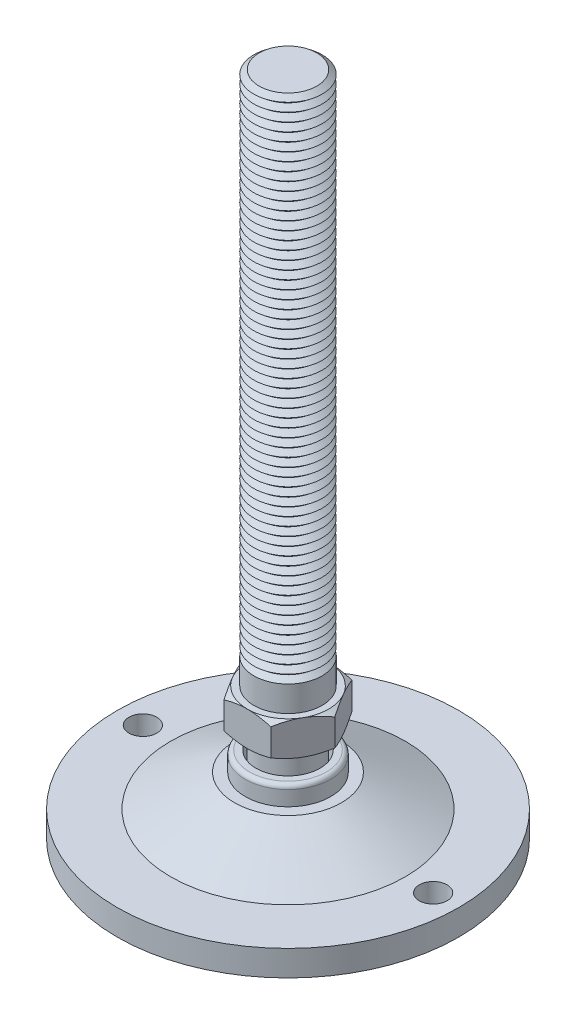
ISO-10303-21;
HEADER;
FILE_DESCRIPTION(('STEP AP214'),'2;1');
FILE_NAME('part.step','',(''),(''),'','','');
FILE_SCHEMA(('AUTOMOTIVE_DESIGN { 1 0 10303 214 1 1 1 1 }'));
ENDSEC;
DATA;
#1=APPLICATION_CONTEXT('core data for automotive mechanical design processes');
#2=APPLICATION_PROTOCOL_DEFINITION('international standard','automotive_design',2000,#1);
#3=PRODUCT_CONTEXT('',#1,'mechanical');
#4=PRODUCT('Part','Part','',(#3));
#5=PRODUCT_RELATED_PRODUCT_CATEGORY('part','',(#4));
#6=PRODUCT_DEFINITION_FORMATION('','',#4);
#7=PRODUCT_DEFINITION_CONTEXT('part definition',#1,'design');
#8=PRODUCT_DEFINITION('design','',#6,#7);
#9=PRODUCT_DEFINITION_SHAPE('','',#8);
#10=(LENGTH_UNIT() NAMED_UNIT(*) SI_UNIT(.MILLI.,.METRE.));
#11=(NAMED_UNIT(*) PLANE_ANGLE_UNIT() SI_UNIT($,.RADIAN.));
#12=(NAMED_UNIT(*) SI_UNIT($,.STERADIAN.) SOLID_ANGLE_UNIT());
#13=UNCERTAINTY_MEASURE_WITH_UNIT(LENGTH_MEASURE(1.E-05),#10,'distance_accuracy_value','');
#14=(GEOMETRIC_REPRESENTATION_CONTEXT(3) GLOBAL_UNCERTAINTY_ASSIGNED_CONTEXT((#13)) GLOBAL_UNIT_ASSIGNED_CONTEXT((#10,
#11,#12)) REPRESENTATION_CONTEXT('',''));
#15=CARTESIAN_POINT('',(0.,0.,0.));
#16=DIRECTION('',(0.,0.,1.));
#17=DIRECTION('',(1.,0.,0.));
#18=AXIS2_PLACEMENT_3D('',#15,#16,#17);
#19=CARTESIAN_POINT('',(0.,148.,0.));
#20=DIRECTION('',(0.,-1.,0.));
#21=DIRECTION('',(0.,0.,-1.));
#22=AXIS2_PLACEMENT_3D('',#19,#20,#21);
#23=CONICAL_SURFACE('',#22,6.75100040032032,0.895664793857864);
#24=CARTESIAN_POINT('',(0.,147.,0.));
#25=DIRECTION('',(0.,-1.,0.));
#26=DIRECTION('',(0.,0.,-1.));
#27=AXIS2_PLACEMENT_3D('',#24,#25,#26);
#28=CIRCLE('',#27,8.);
#29=CARTESIAN_POINT('',(0.,147.,-8.));
#30=VERTEX_POINT('',#29);
#31=EDGE_CURVE('P0_E2028',#30,#30,#28,.T.);
#32=ORIENTED_EDGE('',*,*,#31,.F.);
#33=EDGE_LOOP('',(#32));
#34=FACE_BOUND('',#33,.T.);
#35=CARTESIAN_POINT('',(0.,148.,0.));
#36=DIRECTION('',(0.,-1.,0.));
#37=DIRECTION('',(0.,0.,-1.));
#38=AXIS2_PLACEMENT_3D('',#35,#36,#37);
#39=CIRCLE('',#38,6.75100040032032);
#40=CARTESIAN_POINT('',(0.,148.,-6.75100040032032));
#41=VERTEX_POINT('',#40);
#42=EDGE_CURVE('P0_E2037',#41,#41,#39,.T.);
#43=ORIENTED_EDGE('',*,*,#42,.T.);
#44=EDGE_LOOP('',(#43));
#45=FACE_BOUND('',#44,.T.);
#46=ADVANCED_FACE('P0_F16',(#34,#45),#23,.T.);
#47=CARTESIAN_POINT('',(0.,149.,0.));
#48=DIRECTION('',(0.,1.,0.));
#49=DIRECTION('',(0.,0.,1.));
#50=AXIS2_PLACEMENT_3D('',#47,#48,#49);
#51=CONICAL_SURFACE('',#50,8.,0.895664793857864);
#52=ORIENTED_EDGE('',*,*,#42,.F.);
#53=EDGE_LOOP('',(#52));
#54=FACE_BOUND('',#53,.T.);
#55=CARTESIAN_POINT('',(0.,149.,0.));
#56=DIRECTION('',(0.,-1.,0.));
#57=DIRECTION('',(0.,0.,-1.));
#58=AXIS2_PLACEMENT_3D('',#55,#56,#57);
#59=CIRCLE('',#58,8.);
#60=CARTESIAN_POINT('',(0.,149.,-8.));
#61=VERTEX_POINT('',#60);
#62=EDGE_CURVE('P0_E2034',#61,#61,#59,.T.);
#63=ORIENTED_EDGE('',*,*,#62,.T.);
#64=EDGE_LOOP('',(#63));
#65=FACE_BOUND('',#64,.T.);
#66=ADVANCED_FACE('P0_F308',(#54,#65),#51,.T.);
#67=CARTESIAN_POINT('',(0.,156.,0.));
#68=DIRECTION('',(0.,1.,0.));
#69=DIRECTION('',(0.,0.,1.));
#70=AXIS2_PLACEMENT_3D('',#67,#68,#69);
#71=PLANE('',#70);
#72=CARTESIAN_POINT('',(0.,156.,0.));
#73=DIRECTION('',(0.,-1.,0.));
#74=DIRECTION('',(0.,0.,-1.));
#75=AXIS2_PLACEMENT_3D('',#72,#73,#74);
#76=CIRCLE('',#75,6.75100040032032);
#77=CARTESIAN_POINT('',(0.,156.,-6.75100040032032));
#78=VERTEX_POINT('',#77);
#79=EDGE_CURVE('P0_E143',#78,#78,#76,.T.);
#80=ORIENTED_EDGE('',*,*,#79,.F.);
#81=EDGE_LOOP('',(#80));
#82=FACE_BOUND('',#81,.T.);
#83=ADVANCED_FACE('P0_F314',(#82),#71,.T.);
#84=CARTESIAN_POINT('',(0.,156.,0.));
#85=DIRECTION('',(0.,-1.,0.));
#86=DIRECTION('',(0.,0.,-1.));
#87=AXIS2_PLACEMENT_3D('',#84,#85,#86);
#88=CONICAL_SURFACE('',#87,6.75100040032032,0.895664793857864);
#89=CARTESIAN_POINT('',(0.,155.,0.));
#90=DIRECTION('',(0.,-1.,0.));
#91=DIRECTION('',(0.,0.,-1.));
#92=AXIS2_PLACEMENT_3D('',#89,#90,#91);
#93=CIRCLE('',#92,8.);
#94=CARTESIAN_POINT('',(0.,155.,-8.));
#95=VERTEX_POINT('',#94);
#96=EDGE_CURVE('P0_E353',#95,#95,#93,.T.);
#97=ORIENTED_EDGE('',*,*,#96,.F.);
#98=EDGE_LOOP('',(#97));
#99=FACE_BOUND('',#98,.T.);
#100=ORIENTED_EDGE('',*,*,#79,.T.);
#101=EDGE_LOOP('',(#100));
#102=FACE_BOUND('',#101,.T.);
#103=ADVANCED_FACE('P0_F211',(#99,#102),#88,.T.);
#104=CARTESIAN_POINT('',(0.,155.,0.));
#105=DIRECTION('',(0.,1.,0.));
#106=DIRECTION('',(0.,0.,1.));
#107=AXIS2_PLACEMENT_3D('',#104,#105,#106);
#108=CONICAL_SURFACE('',#107,8.,0.895664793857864);
#109=CARTESIAN_POINT('',(0.,154.,0.));
#110=DIRECTION('',(0.,-1.,0.));
#111=DIRECTION('',(0.,0.,-1.));
#112=AXIS2_PLACEMENT_3D('',#109,#110,#111);
#113=CIRCLE('',#112,6.75100040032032);
#114=CARTESIAN_POINT('',(0.,154.,-6.75100040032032));
#115=VERTEX_POINT('',#114);
#116=EDGE_CURVE('P0_E352',#115,#115,#113,.T.);
#117=ORIENTED_EDGE('',*,*,#116,.F.);
#118=EDGE_LOOP('',(#117));
#119=FACE_BOUND('',#118,.T.);
#120=ORIENTED_EDGE('',*,*,#96,.T.);
#121=EDGE_LOOP('',(#120));
#122=FACE_BOUND('',#121,.T.);
#123=ADVANCED_FACE('P0_F339',(#119,#122),#108,.T.);
#124=CARTESIAN_POINT('',(0.,154.,0.));
#125=DIRECTION('',(0.,-1.,0.));
#126=DIRECTION('',(0.,0.,-1.));
#127=AXIS2_PLACEMENT_3D('',#124,#125,#126);
#128=CONICAL_SURFACE('',#127,6.75100040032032,0.895664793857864);
#129=CARTESIAN_POINT('',(0.,153.,0.));
#130=DIRECTION('',(0.,-1.,0.));
#131=DIRECTION('',(0.,0.,-1.));
#132=AXIS2_PLACEMENT_3D('',#129,#130,#131);
#133=CIRCLE('',#132,8.);
#134=CARTESIAN_POINT('',(0.,153.,-8.));
#135=VERTEX_POINT('',#134);
#136=EDGE_CURVE('P0_E349',#135,#135,#133,.T.);
#137=ORIENTED_EDGE('',*,*,#136,.F.);
#138=EDGE_LOOP('',(#137));
#139=FACE_BOUND('',#138,.T.);
#140=ORIENTED_EDGE('',*,*,#116,.T.);
#141=EDGE_LOOP('',(#140));
#142=FACE_BOUND('',#141,.T.);
#143=ADVANCED_FACE('P0_F334',(#139,#142),#128,.T.);
#144=CARTESIAN_POINT('',(0.,153.,0.));
#145=DIRECTION('',(0.,1.,0.));
#146=DIRECTION('',(0.,0.,1.));
#147=AXIS2_PLACEMENT_3D('',#144,#145,#146);
#148=CONICAL_SURFACE('',#147,8.,0.895664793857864);
#149=CARTESIAN_POINT('',(0.,152.,0.));
#150=DIRECTION('',(0.,-1.,0.));
#151=DIRECTION('',(0.,0.,-1.));
#152=AXIS2_PLACEMENT_3D('',#149,#150,#151);
#153=CIRCLE('',#152,6.75100040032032);
#154=CARTESIAN_POINT('',(0.,152.,-6.75100040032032));
#155=VERTEX_POINT('',#154);
#156=EDGE_CURVE('P0_E358',#155,#155,#153,.T.);
#157=ORIENTED_EDGE('',*,*,#156,.F.);
#158=EDGE_LOOP('',(#157));
#159=FACE_BOUND('',#158,.T.);
#160=ORIENTED_EDGE('',*,*,#136,.T.);
#161=EDGE_LOOP('',(#160));
#162=FACE_BOUND('',#161,.T.);
#163=ADVANCED_FACE('P0_F331',(#159,#162),#148,.T.);
#164=CARTESIAN_POINT('',(0.,152.,0.));
#165=DIRECTION('',(0.,-1.,0.));
#166=DIRECTION('',(0.,0.,-1.));
#167=AXIS2_PLACEMENT_3D('',#164,#165,#166);
#168=CONICAL_SURFACE('',#167,6.75100040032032,0.895664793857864);
#169=CARTESIAN_POINT('',(0.,151.,0.));
#170=DIRECTION('',(0.,-1.,0.));
#171=DIRECTION('',(0.,0.,-1.));
#172=AXIS2_PLACEMENT_3D('',#169,#170,#171);
#173=CIRCLE('',#172,8.);
#174=CARTESIAN_POINT('',(0.,151.,-8.));
#175=VERTEX_POINT('',#174);
#176=EDGE_CURVE('P0_E2040',#175,#175,#173,.T.);
#177=ORIENTED_EDGE('',*,*,#176,.F.);
#178=EDGE_LOOP('',(#177));
#179=FACE_BOUND('',#178,.T.);
#180=ORIENTED_EDGE('',*,*,#156,.T.);
#181=EDGE_LOOP('',(#180));
#182=FACE_BOUND('',#181,.T.);
#183=ADVANCED_FACE('P0_F325',(#179,#182),#168,.T.);
#184=CARTESIAN_POINT('',(0.,151.,0.));
#185=DIRECTION('',(0.,1.,0.));
#186=DIRECTION('',(0.,0.,1.));
#187=AXIS2_PLACEMENT_3D('',#184,#185,#186);
#188=CONICAL_SURFACE('',#187,8.,0.895664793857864);
#189=CARTESIAN_POINT('',(0.,150.,0.));
#190=DIRECTION('',(0.,-1.,0.));
#191=DIRECTION('',(0.,0.,-1.));
#192=AXIS2_PLACEMENT_3D('',#189,#190,#191);
#193=CIRCLE('',#192,6.75100040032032);
#194=CARTESIAN_POINT('',(0.,150.,-6.75100040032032));
#195=VERTEX_POINT('',#194);
#196=EDGE_CURVE('P0_E2043',#195,#195,#193,.T.);
#197=ORIENTED_EDGE('',*,*,#196,.F.);
#198=EDGE_LOOP('',(#197));
#199=FACE_BOUND('',#198,.T.);
#200=ORIENTED_EDGE('',*,*,#176,.T.);
#201=EDGE_LOOP('',(#200));
#202=FACE_BOUND('',#201,.T.);
#203=ADVANCED_FACE('P0_F321',(#199,#202),#188,.T.);
#204=CARTESIAN_POINT('',(0.,150.,0.));
#205=DIRECTION('',(0.,-1.,0.));
#206=DIRECTION('',(0.,0.,-1.));
#207=AXIS2_PLACEMENT_3D('',#204,#205,#206);
#208=CONICAL_SURFACE('',#207,6.75100040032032,0.895664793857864);
#209=ORIENTED_EDGE('',*,*,#62,.F.);
#210=EDGE_LOOP('',(#209));
#211=FACE_BOUND('',#210,.T.);
#212=ORIENTED_EDGE('',*,*,#196,.T.);
#213=EDGE_LOOP('',(#212));
#214=FACE_BOUND('',#213,.T.);
#215=ADVANCED_FACE('P0_F324',(#211,#214),#208,.T.);
#216=CARTESIAN_POINT('',(0.,146.,0.));
#217=DIRECTION('',(0.,-1.,0.));
#218=DIRECTION('',(0.,0.,-1.));
#219=AXIS2_PLACEMENT_3D('',#216,#217,#218);
#220=CONICAL_SURFACE('',#219,6.75100040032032,0.895664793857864);
#221=CARTESIAN_POINT('',(0.,145.,0.));
#222=DIRECTION('',(0.,-1.,0.));
#223=DIRECTION('',(0.,0.,-1.));
#224=AXIS2_PLACEMENT_3D('',#221,#222,#223);
#225=CIRCLE('',#224,8.);
#226=CARTESIAN_POINT('',(0.,145.,-8.));
#227=VERTEX_POINT('',#226);
#228=EDGE_CURVE('P0_E2022',#227,#227,#225,.T.);
#229=ORIENTED_EDGE('',*,*,#228,.F.);
#230=EDGE_LOOP('',(#229));
#231=FACE_BOUND('',#230,.T.);
#232=CARTESIAN_POINT('',(0.,146.,0.));
#233=DIRECTION('',(0.,-1.,0.));
#234=DIRECTION('',(0.,0.,-1.));
#235=AXIS2_PLACEMENT_3D('',#232,#233,#234);
#236=CIRCLE('',#235,6.75100040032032);
#237=CARTESIAN_POINT('',(0.,146.,-6.75100040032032));
#238=VERTEX_POINT('',#237);
#239=EDGE_CURVE('P0_E2031',#238,#238,#236,.T.);
#240=ORIENTED_EDGE('',*,*,#239,.T.);
#241=EDGE_LOOP('',(#240));
#242=FACE_BOUND('',#241,.T.);
#243=ADVANCED_FACE('P0_F329',(#231,#242),#220,.T.);
#244=CARTESIAN_POINT('',(0.,147.,0.));
#245=DIRECTION('',(0.,1.,0.));
#246=DIRECTION('',(0.,0.,1.));
#247=AXIS2_PLACEMENT_3D('',#244,#245,#246);
#248=CONICAL_SURFACE('',#247,8.,0.895664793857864);
#249=ORIENTED_EDGE('',*,*,#239,.F.);
#250=EDGE_LOOP('',(#249));
#251=FACE_BOUND('',#250,.T.);
#252=ORIENTED_EDGE('',*,*,#31,.T.);
#253=EDGE_LOOP('',(#252));
#254=FACE_BOUND('',#253,.T.);
#255=ADVANCED_FACE('P0_F1604',(#251,#254),#248,.T.);
#256=CARTESIAN_POINT('',(0.,144.,0.));
#257=DIRECTION('',(0.,-1.,0.));
#258=DIRECTION('',(0.,0.,-1.));
#259=AXIS2_PLACEMENT_3D('',#256,#257,#258);
#260=CONICAL_SURFACE('',#259,6.75100040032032,0.895664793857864);
#261=CARTESIAN_POINT('',(0.,143.,0.));
#262=DIRECTION('',(0.,-1.,0.));
#263=DIRECTION('',(0.,0.,-1.));
#264=AXIS2_PLACEMENT_3D('',#261,#262,#263);
#265=CIRCLE('',#264,8.);
#266=CARTESIAN_POINT('',(0.,143.,-8.));
#267=VERTEX_POINT('',#266);
#268=EDGE_CURVE('P0_E2016',#267,#267,#265,.T.);
#269=ORIENTED_EDGE('',*,*,#268,.F.);
#270=EDGE_LOOP('',(#269));
#271=FACE_BOUND('',#270,.T.);
#272=CARTESIAN_POINT('',(0.,144.,0.));
#273=DIRECTION('',(0.,-1.,0.));
#274=DIRECTION('',(0.,0.,-1.));
#275=AXIS2_PLACEMENT_3D('',#272,#273,#274);
#276=CIRCLE('',#275,6.75100040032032);
#277=CARTESIAN_POINT('',(0.,144.,-6.75100040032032));
#278=VERTEX_POINT('',#277);
#279=EDGE_CURVE('P0_E2025',#278,#278,#276,.T.);
#280=ORIENTED_EDGE('',*,*,#279,.T.);
#281=EDGE_LOOP('',(#280));
#282=FACE_BOUND('',#281,.T.);
#283=ADVANCED_FACE('P0_F1594',(#271,#282),#260,.T.);
#284=CARTESIAN_POINT('',(0.,145.,0.));
#285=DIRECTION('',(0.,1.,0.));
#286=DIRECTION('',(0.,0.,1.));
#287=AXIS2_PLACEMENT_3D('',#284,#285,#286);
#288=CONICAL_SURFACE('',#287,8.,0.895664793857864);
#289=ORIENTED_EDGE('',*,*,#279,.F.);
#290=EDGE_LOOP('',(#289));
#291=FACE_BOUND('',#290,.T.);
#292=ORIENTED_EDGE('',*,*,#228,.T.);
#293=EDGE_LOOP('',(#292));
#294=FACE_BOUND('',#293,.T.);
#295=ADVANCED_FACE('P0_F1584',(#291,#294),#288,.T.);
#296=CARTESIAN_POINT('',(0.,142.,0.));
#297=DIRECTION('',(0.,-1.,0.));
#298=DIRECTION('',(0.,0.,-1.));
#299=AXIS2_PLACEMENT_3D('',#296,#297,#298);
#300=CONICAL_SURFACE('',#299,6.75100040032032,0.895664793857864);
#301=CARTESIAN_POINT('',(0.,141.,0.));
#302=DIRECTION('',(0.,-1.,0.));
#303=DIRECTION('',(0.,0.,-1.));
#304=AXIS2_PLACEMENT_3D('',#301,#302,#303);
#305=CIRCLE('',#304,8.);
#306=CARTESIAN_POINT('',(0.,141.,-8.));
#307=VERTEX_POINT('',#306);
#308=EDGE_CURVE('P0_E2010',#307,#307,#305,.T.);
#309=ORIENTED_EDGE('',*,*,#308,.F.);
#310=EDGE_LOOP('',(#309));
#311=FACE_BOUND('',#310,.T.);
#312=CARTESIAN_POINT('',(0.,142.,0.));
#313=DIRECTION('',(0.,-1.,0.));
#314=DIRECTION('',(0.,0.,-1.));
#315=AXIS2_PLACEMENT_3D('',#312,#313,#314);
#316=CIRCLE('',#315,6.75100040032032);
#317=CARTESIAN_POINT('',(0.,142.,-6.75100040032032));
#318=VERTEX_POINT('',#317);
#319=EDGE_CURVE('P0_E2019',#318,#318,#316,.T.);
#320=ORIENTED_EDGE('',*,*,#319,.T.);
#321=EDGE_LOOP('',(#320));
#322=FACE_BOUND('',#321,.T.);
#323=ADVANCED_FACE('P0_F1574',(#311,#322),#300,.T.);
#324=CARTESIAN_POINT('',(0.,143.,0.));
#325=DIRECTION('',(0.,1.,0.));
#326=DIRECTION('',(0.,0.,1.));
#327=AXIS2_PLACEMENT_3D('',#324,#325,#326);
#328=CONICAL_SURFACE('',#327,8.,0.895664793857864);
#329=ORIENTED_EDGE('',*,*,#319,.F.);
#330=EDGE_LOOP('',(#329));
#331=FACE_BOUND('',#330,.T.);
#332=ORIENTED_EDGE('',*,*,#268,.T.);
#333=EDGE_LOOP('',(#332));
#334=FACE_BOUND('',#333,.T.);
#335=ADVANCED_FACE('P0_F1564',(#331,#334),#328,.T.);
#336=CARTESIAN_POINT('',(0.,140.,0.));
#337=DIRECTION('',(0.,-1.,0.));
#338=DIRECTION('',(0.,0.,-1.));
#339=AXIS2_PLACEMENT_3D('',#336,#337,#338);
#340=CONICAL_SURFACE('',#339,6.75100040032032,0.895664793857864);
#341=CARTESIAN_POINT('',(0.,139.,0.));
#342=DIRECTION('',(0.,-1.,0.));
#343=DIRECTION('',(0.,0.,-1.));
#344=AXIS2_PLACEMENT_3D('',#341,#342,#343);
#345=CIRCLE('',#344,8.);
#346=CARTESIAN_POINT('',(0.,139.,-8.));
#347=VERTEX_POINT('',#346);
#348=EDGE_CURVE('P0_E2004',#347,#347,#345,.T.);
#349=ORIENTED_EDGE('',*,*,#348,.F.);
#350=EDGE_LOOP('',(#349));
#351=FACE_BOUND('',#350,.T.);
#352=CARTESIAN_POINT('',(0.,140.,0.));
#353=DIRECTION('',(0.,-1.,0.));
#354=DIRECTION('',(0.,0.,-1.));
#355=AXIS2_PLACEMENT_3D('',#352,#353,#354);
#356=CIRCLE('',#355,6.75100040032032);
#357=CARTESIAN_POINT('',(0.,140.,-6.75100040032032));
#358=VERTEX_POINT('',#357);
#359=EDGE_CURVE('P0_E2013',#358,#358,#356,.T.);
#360=ORIENTED_EDGE('',*,*,#359,.T.);
#361=EDGE_LOOP('',(#360));
#362=FACE_BOUND('',#361,.T.);
#363=ADVANCED_FACE('P0_F1554',(#351,#362),#340,.T.);
#364=CARTESIAN_POINT('',(0.,141.,0.));
#365=DIRECTION('',(0.,1.,0.));
#366=DIRECTION('',(0.,0.,1.));
#367=AXIS2_PLACEMENT_3D('',#364,#365,#366);
#368=CONICAL_SURFACE('',#367,8.,0.895664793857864);
#369=ORIENTED_EDGE('',*,*,#359,.F.);
#370=EDGE_LOOP('',(#369));
#371=FACE_BOUND('',#370,.T.);
#372=ORIENTED_EDGE('',*,*,#308,.T.);
#373=EDGE_LOOP('',(#372));
#374=FACE_BOUND('',#373,.T.);
#375=ADVANCED_FACE('P0_F1544',(#371,#374),#368,.T.);
#376=CARTESIAN_POINT('',(0.,138.,0.));
#377=DIRECTION('',(0.,-1.,0.));
#378=DIRECTION('',(0.,0.,-1.));
#379=AXIS2_PLACEMENT_3D('',#376,#377,#378);
#380=CONICAL_SURFACE('',#379,6.75100040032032,0.895664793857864);
#381=CARTESIAN_POINT('',(0.,137.,0.));
#382=DIRECTION('',(0.,-1.,0.));
#383=DIRECTION('',(0.,0.,-1.));
#384=AXIS2_PLACEMENT_3D('',#381,#382,#383);
#385=CIRCLE('',#384,8.);
#386=CARTESIAN_POINT('',(0.,137.,-8.));
#387=VERTEX_POINT('',#386);
#388=EDGE_CURVE('P0_E1998',#387,#387,#385,.T.);
#389=ORIENTED_EDGE('',*,*,#388,.F.);
#390=EDGE_LOOP('',(#389));
#391=FACE_BOUND('',#390,.T.);
#392=CARTESIAN_POINT('',(0.,138.,0.));
#393=DIRECTION('',(0.,-1.,0.));
#394=DIRECTION('',(0.,0.,-1.));
#395=AXIS2_PLACEMENT_3D('',#392,#393,#394);
#396=CIRCLE('',#395,6.75100040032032);
#397=CARTESIAN_POINT('',(0.,138.,-6.75100040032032));
#398=VERTEX_POINT('',#397);
#399=EDGE_CURVE('P0_E2007',#398,#398,#396,.T.);
#400=ORIENTED_EDGE('',*,*,#399,.T.);
#401=EDGE_LOOP('',(#400));
#402=FACE_BOUND('',#401,.T.);
#403=ADVANCED_FACE('P0_F1534',(#391,#402),#380,.T.);
#404=CARTESIAN_POINT('',(0.,139.,0.));
#405=DIRECTION('',(0.,1.,0.));
#406=DIRECTION('',(0.,0.,1.));
#407=AXIS2_PLACEMENT_3D('',#404,#405,#406);
#408=CONICAL_SURFACE('',#407,8.,0.895664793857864);
#409=ORIENTED_EDGE('',*,*,#399,.F.);
#410=EDGE_LOOP('',(#409));
#411=FACE_BOUND('',#410,.T.);
#412=ORIENTED_EDGE('',*,*,#348,.T.);
#413=EDGE_LOOP('',(#412));
#414=FACE_BOUND('',#413,.T.);
#415=ADVANCED_FACE('P0_F1524',(#411,#414),#408,.T.);
#416=CARTESIAN_POINT('',(0.,136.,0.));
#417=DIRECTION('',(0.,-1.,0.));
#418=DIRECTION('',(0.,0.,-1.));
#419=AXIS2_PLACEMENT_3D('',#416,#417,#418);
#420=CONICAL_SURFACE('',#419,6.75100040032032,0.895664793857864);
#421=CARTESIAN_POINT('',(0.,135.,0.));
#422=DIRECTION('',(0.,-1.,0.));
#423=DIRECTION('',(0.,0.,-1.));
#424=AXIS2_PLACEMENT_3D('',#421,#422,#423);
#425=CIRCLE('',#424,8.);
#426=CARTESIAN_POINT('',(0.,135.,-8.));
#427=VERTEX_POINT('',#426);
#428=EDGE_CURVE('P0_E1992',#427,#427,#425,.T.);
#429=ORIENTED_EDGE('',*,*,#428,.F.);
#430=EDGE_LOOP('',(#429));
#431=FACE_BOUND('',#430,.T.);
#432=CARTESIAN_POINT('',(0.,136.,0.));
#433=DIRECTION('',(0.,-1.,0.));
#434=DIRECTION('',(0.,0.,-1.));
#435=AXIS2_PLACEMENT_3D('',#432,#433,#434);
#436=CIRCLE('',#435,6.75100040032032);
#437=CARTESIAN_POINT('',(0.,136.,-6.75100040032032));
#438=VERTEX_POINT('',#437);
#439=EDGE_CURVE('P0_E2001',#438,#438,#436,.T.);
#440=ORIENTED_EDGE('',*,*,#439,.T.);
#441=EDGE_LOOP('',(#440));
#442=FACE_BOUND('',#441,.T.);
#443=ADVANCED_FACE('P0_F1514',(#431,#442),#420,.T.);
#444=CARTESIAN_POINT('',(0.,137.,0.));
#445=DIRECTION('',(0.,1.,0.));
#446=DIRECTION('',(0.,0.,1.));
#447=AXIS2_PLACEMENT_3D('',#444,#445,#446);
#448=CONICAL_SURFACE('',#447,8.,0.895664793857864);
#449=ORIENTED_EDGE('',*,*,#439,.F.);
#450=EDGE_LOOP('',(#449));
#451=FACE_BOUND('',#450,.T.);
#452=ORIENTED_EDGE('',*,*,#388,.T.);
#453=EDGE_LOOP('',(#452));
#454=FACE_BOUND('',#453,.T.);
#455=ADVANCED_FACE('P0_F1504',(#451,#454),#448,.T.);
#456=CARTESIAN_POINT('',(0.,134.,0.));
#457=DIRECTION('',(0.,-1.,0.));
#458=DIRECTION('',(0.,0.,-1.));
#459=AXIS2_PLACEMENT_3D('',#456,#457,#458);
#460=CONICAL_SURFACE('',#459,6.75100040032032,0.895664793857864);
#461=CARTESIAN_POINT('',(0.,133.,0.));
#462=DIRECTION('',(0.,-1.,0.));
#463=DIRECTION('',(0.,0.,-1.));
#464=AXIS2_PLACEMENT_3D('',#461,#462,#463);
#465=CIRCLE('',#464,8.);
#466=CARTESIAN_POINT('',(0.,133.,-8.));
#467=VERTEX_POINT('',#466);
#468=EDGE_CURVE('P0_E1986',#467,#467,#465,.T.);
#469=ORIENTED_EDGE('',*,*,#468,.F.);
#470=EDGE_LOOP('',(#469));
#471=FACE_BOUND('',#470,.T.);
#472=CARTESIAN_POINT('',(0.,134.,0.));
#473=DIRECTION('',(0.,-1.,0.));
#474=DIRECTION('',(0.,0.,-1.));
#475=AXIS2_PLACEMENT_3D('',#472,#473,#474);
#476=CIRCLE('',#475,6.75100040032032);
#477=CARTESIAN_POINT('',(0.,134.,-6.75100040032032));
#478=VERTEX_POINT('',#477);
#479=EDGE_CURVE('P0_E1995',#478,#478,#476,.T.);
#480=ORIENTED_EDGE('',*,*,#479,.T.);
#481=EDGE_LOOP('',(#480));
#482=FACE_BOUND('',#481,.T.);
#483=ADVANCED_FACE('P0_F1494',(#471,#482),#460,.T.);
#484=CARTESIAN_POINT('',(0.,135.,0.));
#485=DIRECTION('',(0.,1.,0.));
#486=DIRECTION('',(0.,0.,1.));
#487=AXIS2_PLACEMENT_3D('',#484,#485,#486);
#488=CONICAL_SURFACE('',#487,8.,0.895664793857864);
#489=ORIENTED_EDGE('',*,*,#479,.F.);
#490=EDGE_LOOP('',(#489));
#491=FACE_BOUND('',#490,.T.);
#492=ORIENTED_EDGE('',*,*,#428,.T.);
#493=EDGE_LOOP('',(#492));
#494=FACE_BOUND('',#493,.T.);
#495=ADVANCED_FACE('P0_F1484',(#491,#494),#488,.T.);
#496=CARTESIAN_POINT('',(0.,132.,0.));
#497=DIRECTION('',(0.,-1.,0.));
#498=DIRECTION('',(0.,0.,-1.));
#499=AXIS2_PLACEMENT_3D('',#496,#497,#498);
#500=CONICAL_SURFACE('',#499,6.75100040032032,0.895664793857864);
#501=CARTESIAN_POINT('',(0.,131.,0.));
#502=DIRECTION('',(0.,-1.,0.));
#503=DIRECTION('',(0.,0.,-1.));
#504=AXIS2_PLACEMENT_3D('',#501,#502,#503);
#505=CIRCLE('',#504,8.);
#506=CARTESIAN_POINT('',(0.,131.,-8.));
#507=VERTEX_POINT('',#506);
#508=EDGE_CURVE('P0_E1980',#507,#507,#505,.T.);
#509=ORIENTED_EDGE('',*,*,#508,.F.);
#510=EDGE_LOOP('',(#509));
#511=FACE_BOUND('',#510,.T.);
#512=CARTESIAN_POINT('',(0.,132.,0.));
#513=DIRECTION('',(0.,-1.,0.));
#514=DIRECTION('',(0.,0.,-1.));
#515=AXIS2_PLACEMENT_3D('',#512,#513,#514);
#516=CIRCLE('',#515,6.75100040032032);
#517=CARTESIAN_POINT('',(0.,132.,-6.75100040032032));
#518=VERTEX_POINT('',#517);
#519=EDGE_CURVE('P0_E1989',#518,#518,#516,.T.);
#520=ORIENTED_EDGE('',*,*,#519,.T.);
#521=EDGE_LOOP('',(#520));
#522=FACE_BOUND('',#521,.T.);
#523=ADVANCED_FACE('P0_F1474',(#511,#522),#500,.T.);
#524=CARTESIAN_POINT('',(0.,133.,0.));
#525=DIRECTION('',(0.,1.,0.));
#526=DIRECTION('',(0.,0.,1.));
#527=AXIS2_PLACEMENT_3D('',#524,#525,#526);
#528=CONICAL_SURFACE('',#527,8.,0.895664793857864);
#529=ORIENTED_EDGE('',*,*,#519,.F.);
#530=EDGE_LOOP('',(#529));
#531=FACE_BOUND('',#530,.T.);
#532=ORIENTED_EDGE('',*,*,#468,.T.);
#533=EDGE_LOOP('',(#532));
#534=FACE_BOUND('',#533,.T.);
#535=ADVANCED_FACE('P0_F1464',(#531,#534),#528,.T.);
#536=CARTESIAN_POINT('',(0.,130.,0.));
#537=DIRECTION('',(0.,-1.,0.));
#538=DIRECTION('',(0.,0.,-1.));
#539=AXIS2_PLACEMENT_3D('',#536,#537,#538);
#540=CONICAL_SURFACE('',#539,6.75100040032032,0.895664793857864);
#541=CARTESIAN_POINT('',(0.,129.,0.));
#542=DIRECTION('',(0.,-1.,0.));
#543=DIRECTION('',(0.,0.,-1.));
#544=AXIS2_PLACEMENT_3D('',#541,#542,#543);
#545=CIRCLE('',#544,8.);
#546=CARTESIAN_POINT('',(0.,129.,-8.));
#547=VERTEX_POINT('',#546);
#548=EDGE_CURVE('P0_E1974',#547,#547,#545,.T.);
#549=ORIENTED_EDGE('',*,*,#548,.F.);
#550=EDGE_LOOP('',(#549));
#551=FACE_BOUND('',#550,.T.);
#552=CARTESIAN_POINT('',(0.,130.,0.));
#553=DIRECTION('',(0.,-1.,0.));
#554=DIRECTION('',(0.,0.,-1.));
#555=AXIS2_PLACEMENT_3D('',#552,#553,#554);
#556=CIRCLE('',#555,6.75100040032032);
#557=CARTESIAN_POINT('',(0.,130.,-6.75100040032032));
#558=VERTEX_POINT('',#557);
#559=EDGE_CURVE('P0_E1983',#558,#558,#556,.T.);
#560=ORIENTED_EDGE('',*,*,#559,.T.);
#561=EDGE_LOOP('',(#560));
#562=FACE_BOUND('',#561,.T.);
#563=ADVANCED_FACE('P0_F1454',(#551,#562),#540,.T.);
#564=CARTESIAN_POINT('',(0.,131.,0.));
#565=DIRECTION('',(0.,1.,0.));
#566=DIRECTION('',(0.,0.,1.));
#567=AXIS2_PLACEMENT_3D('',#564,#565,#566);
#568=CONICAL_SURFACE('',#567,8.,0.895664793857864);
#569=ORIENTED_EDGE('',*,*,#559,.F.);
#570=EDGE_LOOP('',(#569));
#571=FACE_BOUND('',#570,.T.);
#572=ORIENTED_EDGE('',*,*,#508,.T.);
#573=EDGE_LOOP('',(#572));
#574=FACE_BOUND('',#573,.T.);
#575=ADVANCED_FACE('P0_F1444',(#571,#574),#568,.T.);
#576=CARTESIAN_POINT('',(0.,128.,0.));
#577=DIRECTION('',(0.,-1.,0.));
#578=DIRECTION('',(0.,0.,-1.));
#579=AXIS2_PLACEMENT_3D('',#576,#577,#578);
#580=CONICAL_SURFACE('',#579,6.75100040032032,0.895664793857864);
#581=CARTESIAN_POINT('',(0.,127.,0.));
#582=DIRECTION('',(0.,-1.,0.));
#583=DIRECTION('',(0.,0.,-1.));
#584=AXIS2_PLACEMENT_3D('',#581,#582,#583);
#585=CIRCLE('',#584,8.);
#586=CARTESIAN_POINT('',(0.,127.,-8.));
#587=VERTEX_POINT('',#586);
#588=EDGE_CURVE('P0_E1968',#587,#587,#585,.T.);
#589=ORIENTED_EDGE('',*,*,#588,.F.);
#590=EDGE_LOOP('',(#589));
#591=FACE_BOUND('',#590,.T.);
#592=CARTESIAN_POINT('',(0.,128.,0.));
#593=DIRECTION('',(0.,-1.,0.));
#594=DIRECTION('',(0.,0.,-1.));
#595=AXIS2_PLACEMENT_3D('',#592,#593,#594);
#596=CIRCLE('',#595,6.75100040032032);
#597=CARTESIAN_POINT('',(0.,128.,-6.75100040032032));
#598=VERTEX_POINT('',#597);
#599=EDGE_CURVE('P0_E1977',#598,#598,#596,.T.);
#600=ORIENTED_EDGE('',*,*,#599,.T.);
#601=EDGE_LOOP('',(#600));
#602=FACE_BOUND('',#601,.T.);
#603=ADVANCED_FACE('P0_F1434',(#591,#602),#580,.T.);
#604=CARTESIAN_POINT('',(0.,129.,0.));
#605=DIRECTION('',(0.,1.,0.));
#606=DIRECTION('',(0.,0.,1.));
#607=AXIS2_PLACEMENT_3D('',#604,#605,#606);
#608=CONICAL_SURFACE('',#607,8.,0.895664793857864);
#609=ORIENTED_EDGE('',*,*,#599,.F.);
#610=EDGE_LOOP('',(#609));
#611=FACE_BOUND('',#610,.T.);
#612=ORIENTED_EDGE('',*,*,#548,.T.);
#613=EDGE_LOOP('',(#612));
#614=FACE_BOUND('',#613,.T.);
#615=ADVANCED_FACE('P0_F1424',(#611,#614),#608,.T.);
#616=CARTESIAN_POINT('',(0.,126.,0.));
#617=DIRECTION('',(0.,-1.,0.));
#618=DIRECTION('',(0.,0.,-1.));
#619=AXIS2_PLACEMENT_3D('',#616,#617,#618);
#620=CONICAL_SURFACE('',#619,6.75100040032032,0.895664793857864);
#621=CARTESIAN_POINT('',(0.,125.,0.));
#622=DIRECTION('',(0.,-1.,0.));
#623=DIRECTION('',(0.,0.,-1.));
#624=AXIS2_PLACEMENT_3D('',#621,#622,#623);
#625=CIRCLE('',#624,8.);
#626=CARTESIAN_POINT('',(0.,125.,-8.));
#627=VERTEX_POINT('',#626);
#628=EDGE_CURVE('P0_E1962',#627,#627,#625,.T.);
#629=ORIENTED_EDGE('',*,*,#628,.F.);
#630=EDGE_LOOP('',(#629));
#631=FACE_BOUND('',#630,.T.);
#632=CARTESIAN_POINT('',(0.,126.,0.));
#633=DIRECTION('',(0.,-1.,0.));
#634=DIRECTION('',(0.,0.,-1.));
#635=AXIS2_PLACEMENT_3D('',#632,#633,#634);
#636=CIRCLE('',#635,6.75100040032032);
#637=CARTESIAN_POINT('',(0.,126.,-6.75100040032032));
#638=VERTEX_POINT('',#637);
#639=EDGE_CURVE('P0_E1971',#638,#638,#636,.T.);
#640=ORIENTED_EDGE('',*,*,#639,.T.);
#641=EDGE_LOOP('',(#640));
#642=FACE_BOUND('',#641,.T.);
#643=ADVANCED_FACE('P0_F1414',(#631,#642),#620,.T.);
#644=CARTESIAN_POINT('',(0.,127.,0.));
#645=DIRECTION('',(0.,1.,0.));
#646=DIRECTION('',(0.,0.,1.));
#647=AXIS2_PLACEMENT_3D('',#644,#645,#646);
#648=CONICAL_SURFACE('',#647,8.,0.895664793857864);
#649=ORIENTED_EDGE('',*,*,#639,.F.);
#650=EDGE_LOOP('',(#649));
#651=FACE_BOUND('',#650,.T.);
#652=ORIENTED_EDGE('',*,*,#588,.T.);
#653=EDGE_LOOP('',(#652));
#654=FACE_BOUND('',#653,.T.);
#655=ADVANCED_FACE('P0_F1404',(#651,#654),#648,.T.);
#656=CARTESIAN_POINT('',(0.,124.,0.));
#657=DIRECTION('',(0.,-1.,0.));
#658=DIRECTION('',(0.,0.,-1.));
#659=AXIS2_PLACEMENT_3D('',#656,#657,#658);
#660=CONICAL_SURFACE('',#659,6.75100040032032,0.895664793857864);
#661=CARTESIAN_POINT('',(0.,123.,0.));
#662=DIRECTION('',(0.,-1.,0.));
#663=DIRECTION('',(0.,0.,-1.));
#664=AXIS2_PLACEMENT_3D('',#661,#662,#663);
#665=CIRCLE('',#664,8.);
#666=CARTESIAN_POINT('',(0.,123.,-8.));
#667=VERTEX_POINT('',#666);
#668=EDGE_CURVE('P0_E1956',#667,#667,#665,.T.);
#669=ORIENTED_EDGE('',*,*,#668,.F.);
#670=EDGE_LOOP('',(#669));
#671=FACE_BOUND('',#670,.T.);
#672=CARTESIAN_POINT('',(0.,124.,0.));
#673=DIRECTION('',(0.,-1.,0.));
#674=DIRECTION('',(0.,0.,-1.));
#675=AXIS2_PLACEMENT_3D('',#672,#673,#674);
#676=CIRCLE('',#675,6.75100040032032);
#677=CARTESIAN_POINT('',(0.,124.,-6.75100040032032));
#678=VERTEX_POINT('',#677);
#679=EDGE_CURVE('P0_E1965',#678,#678,#676,.T.);
#680=ORIENTED_EDGE('',*,*,#679,.T.);
#681=EDGE_LOOP('',(#680));
#682=FACE_BOUND('',#681,.T.);
#683=ADVANCED_FACE('P0_F1394',(#671,#682),#660,.T.);
#684=CARTESIAN_POINT('',(0.,125.,0.));
#685=DIRECTION('',(0.,1.,0.));
#686=DIRECTION('',(0.,0.,1.));
#687=AXIS2_PLACEMENT_3D('',#684,#685,#686);
#688=CONICAL_SURFACE('',#687,8.,0.895664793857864);
#689=ORIENTED_EDGE('',*,*,#679,.F.);
#690=EDGE_LOOP('',(#689));
#691=FACE_BOUND('',#690,.T.);
#692=ORIENTED_EDGE('',*,*,#628,.T.);
#693=EDGE_LOOP('',(#692));
#694=FACE_BOUND('',#693,.T.);
#695=ADVANCED_FACE('P0_F1384',(#691,#694),#688,.T.);
#696=CARTESIAN_POINT('',(0.,122.,0.));
#697=DIRECTION('',(0.,-1.,0.));
#698=DIRECTION('',(0.,0.,-1.));
#699=AXIS2_PLACEMENT_3D('',#696,#697,#698);
#700=CONICAL_SURFACE('',#699,6.75100040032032,0.895664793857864);
#701=CARTESIAN_POINT('',(0.,121.,0.));
#702=DIRECTION('',(0.,-1.,0.));
#703=DIRECTION('',(0.,0.,-1.));
#704=AXIS2_PLACEMENT_3D('',#701,#702,#703);
#705=CIRCLE('',#704,8.);
#706=CARTESIAN_POINT('',(0.,121.,-8.));
#707=VERTEX_POINT('',#706);
#708=EDGE_CURVE('P0_E1950',#707,#707,#705,.T.);
#709=ORIENTED_EDGE('',*,*,#708,.F.);
#710=EDGE_LOOP('',(#709));
#711=FACE_BOUND('',#710,.T.);
#712=CARTESIAN_POINT('',(0.,122.,0.));
#713=DIRECTION('',(0.,-1.,0.));
#714=DIRECTION('',(0.,0.,-1.));
#715=AXIS2_PLACEMENT_3D('',#712,#713,#714);
#716=CIRCLE('',#715,6.75100040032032);
#717=CARTESIAN_POINT('',(0.,122.,-6.75100040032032));
#718=VERTEX_POINT('',#717);
#719=EDGE_CURVE('P0_E1959',#718,#718,#716,.T.);
#720=ORIENTED_EDGE('',*,*,#719,.T.);
#721=EDGE_LOOP('',(#720));
#722=FACE_BOUND('',#721,.T.);
#723=ADVANCED_FACE('P0_F1374',(#711,#722),#700,.T.);
#724=CARTESIAN_POINT('',(0.,123.,0.));
#725=DIRECTION('',(0.,1.,0.));
#726=DIRECTION('',(0.,0.,1.));
#727=AXIS2_PLACEMENT_3D('',#724,#725,#726);
#728=CONICAL_SURFACE('',#727,8.,0.895664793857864);
#729=ORIENTED_EDGE('',*,*,#719,.F.);
#730=EDGE_LOOP('',(#729));
#731=FACE_BOUND('',#730,.T.);
#732=ORIENTED_EDGE('',*,*,#668,.T.);
#733=EDGE_LOOP('',(#732));
#734=FACE_BOUND('',#733,.T.);
#735=ADVANCED_FACE('P0_F1364',(#731,#734),#728,.T.);
#736=CARTESIAN_POINT('',(0.,120.,0.));
#737=DIRECTION('',(0.,-1.,0.));
#738=DIRECTION('',(0.,0.,-1.));
#739=AXIS2_PLACEMENT_3D('',#736,#737,#738);
#740=CONICAL_SURFACE('',#739,6.75100040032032,0.895664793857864);
#741=CARTESIAN_POINT('',(0.,119.,0.));
#742=DIRECTION('',(0.,-1.,0.));
#743=DIRECTION('',(0.,0.,-1.));
#744=AXIS2_PLACEMENT_3D('',#741,#742,#743);
#745=CIRCLE('',#744,8.);
#746=CARTESIAN_POINT('',(0.,119.,-8.));
#747=VERTEX_POINT('',#746);
#748=EDGE_CURVE('P0_E1944',#747,#747,#745,.T.);
#749=ORIENTED_EDGE('',*,*,#748,.F.);
#750=EDGE_LOOP('',(#749));
#751=FACE_BOUND('',#750,.T.);
#752=CARTESIAN_POINT('',(0.,120.,0.));
#753=DIRECTION('',(0.,-1.,0.));
#754=DIRECTION('',(0.,0.,-1.));
#755=AXIS2_PLACEMENT_3D('',#752,#753,#754);
#756=CIRCLE('',#755,6.75100040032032);
#757=CARTESIAN_POINT('',(0.,120.,-6.75100040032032));
#758=VERTEX_POINT('',#757);
#759=EDGE_CURVE('P0_E1953',#758,#758,#756,.T.);
#760=ORIENTED_EDGE('',*,*,#759,.T.);
#761=EDGE_LOOP('',(#760));
#762=FACE_BOUND('',#761,.T.);
#763=ADVANCED_FACE('P0_F1354',(#751,#762),#740,.T.);
#764=CARTESIAN_POINT('',(0.,121.,0.));
#765=DIRECTION('',(0.,1.,0.));
#766=DIRECTION('',(0.,0.,1.));
#767=AXIS2_PLACEMENT_3D('',#764,#765,#766);
#768=CONICAL_SURFACE('',#767,8.,0.895664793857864);
#769=ORIENTED_EDGE('',*,*,#759,.F.);
#770=EDGE_LOOP('',(#769));
#771=FACE_BOUND('',#770,.T.);
#772=ORIENTED_EDGE('',*,*,#708,.T.);
#773=EDGE_LOOP('',(#772));
#774=FACE_BOUND('',#773,.T.);
#775=ADVANCED_FACE('P0_F1344',(#771,#774),#768,.T.);
#776=CARTESIAN_POINT('',(0.,118.,0.));
#777=DIRECTION('',(0.,-1.,0.));
#778=DIRECTION('',(0.,0.,-1.));
#779=AXIS2_PLACEMENT_3D('',#776,#777,#778);
#780=CONICAL_SURFACE('',#779,6.75100040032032,0.895664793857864);
#781=CARTESIAN_POINT('',(0.,117.,0.));
#782=DIRECTION('',(0.,-1.,0.));
#783=DIRECTION('',(0.,0.,-1.));
#784=AXIS2_PLACEMENT_3D('',#781,#782,#783);
#785=CIRCLE('',#784,8.);
#786=CARTESIAN_POINT('',(0.,117.,-8.));
#787=VERTEX_POINT('',#786);
#788=EDGE_CURVE('P0_E1938',#787,#787,#785,.T.);
#789=ORIENTED_EDGE('',*,*,#788,.F.);
#790=EDGE_LOOP('',(#789));
#791=FACE_BOUND('',#790,.T.);
#792=CARTESIAN_POINT('',(0.,118.,0.));
#793=DIRECTION('',(0.,-1.,0.));
#794=DIRECTION('',(0.,0.,-1.));
#795=AXIS2_PLACEMENT_3D('',#792,#793,#794);
#796=CIRCLE('',#795,6.75100040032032);
#797=CARTESIAN_POINT('',(0.,118.,-6.75100040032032));
#798=VERTEX_POINT('',#797);
#799=EDGE_CURVE('P0_E1947',#798,#798,#796,.T.);
#800=ORIENTED_EDGE('',*,*,#799,.T.);
#801=EDGE_LOOP('',(#800));
#802=FACE_BOUND('',#801,.T.);
#803=ADVANCED_FACE('P0_F1334',(#791,#802),#780,.T.);
#804=CARTESIAN_POINT('',(0.,119.,0.));
#805=DIRECTION('',(0.,1.,0.));
#806=DIRECTION('',(0.,0.,1.));
#807=AXIS2_PLACEMENT_3D('',#804,#805,#806);
#808=CONICAL_SURFACE('',#807,8.,0.895664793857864);
#809=ORIENTED_EDGE('',*,*,#799,.F.);
#810=EDGE_LOOP('',(#809));
#811=FACE_BOUND('',#810,.T.);
#812=ORIENTED_EDGE('',*,*,#748,.T.);
#813=EDGE_LOOP('',(#812));
#814=FACE_BOUND('',#813,.T.);
#815=ADVANCED_FACE('P0_F1324',(#811,#814),#808,.T.);
#816=CARTESIAN_POINT('',(0.,116.,0.));
#817=DIRECTION('',(0.,-1.,0.));
#818=DIRECTION('',(0.,0.,-1.));
#819=AXIS2_PLACEMENT_3D('',#816,#817,#818);
#820=CONICAL_SURFACE('',#819,6.75100040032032,0.895664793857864);
#821=CARTESIAN_POINT('',(0.,115.,0.));
#822=DIRECTION('',(0.,-1.,0.));
#823=DIRECTION('',(0.,0.,-1.));
#824=AXIS2_PLACEMENT_3D('',#821,#822,#823);
#825=CIRCLE('',#824,8.);
#826=CARTESIAN_POINT('',(0.,115.,-8.));
#827=VERTEX_POINT('',#826);
#828=EDGE_CURVE('P0_E1932',#827,#827,#825,.T.);
#829=ORIENTED_EDGE('',*,*,#828,.F.);
#830=EDGE_LOOP('',(#829));
#831=FACE_BOUND('',#830,.T.);
#832=CARTESIAN_POINT('',(0.,116.,0.));
#833=DIRECTION('',(0.,-1.,0.));
#834=DIRECTION('',(0.,0.,-1.));
#835=AXIS2_PLACEMENT_3D('',#832,#833,#834);
#836=CIRCLE('',#835,6.75100040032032);
#837=CARTESIAN_POINT('',(0.,116.,-6.75100040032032));
#838=VERTEX_POINT('',#837);
#839=EDGE_CURVE('P0_E1941',#838,#838,#836,.T.);
#840=ORIENTED_EDGE('',*,*,#839,.T.);
#841=EDGE_LOOP('',(#840));
#842=FACE_BOUND('',#841,.T.);
#843=ADVANCED_FACE('P0_F1314',(#831,#842),#820,.T.);
#844=CARTESIAN_POINT('',(0.,117.,0.));
#845=DIRECTION('',(0.,1.,0.));
#846=DIRECTION('',(0.,0.,1.));
#847=AXIS2_PLACEMENT_3D('',#844,#845,#846);
#848=CONICAL_SURFACE('',#847,8.,0.895664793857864);
#849=ORIENTED_EDGE('',*,*,#839,.F.);
#850=EDGE_LOOP('',(#849));
#851=FACE_BOUND('',#850,.T.);
#852=ORIENTED_EDGE('',*,*,#788,.T.);
#853=EDGE_LOOP('',(#852));
#854=FACE_BOUND('',#853,.T.);
#855=ADVANCED_FACE('P0_F1304',(#851,#854),#848,.T.);
#856=CARTESIAN_POINT('',(0.,114.,0.));
#857=DIRECTION('',(0.,-1.,0.));
#858=DIRECTION('',(0.,0.,-1.));
#859=AXIS2_PLACEMENT_3D('',#856,#857,#858);
#860=CONICAL_SURFACE('',#859,6.75100040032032,0.895664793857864);
#861=CARTESIAN_POINT('',(0.,113.,0.));
#862=DIRECTION('',(0.,-1.,0.));
#863=DIRECTION('',(0.,0.,-1.));
#864=AXIS2_PLACEMENT_3D('',#861,#862,#863);
#865=CIRCLE('',#864,8.);
#866=CARTESIAN_POINT('',(0.,113.,-8.));
#867=VERTEX_POINT('',#866);
#868=EDGE_CURVE('P0_E1926',#867,#867,#865,.T.);
#869=ORIENTED_EDGE('',*,*,#868,.F.);
#870=EDGE_LOOP('',(#869));
#871=FACE_BOUND('',#870,.T.);
#872=CARTESIAN_POINT('',(0.,114.,0.));
#873=DIRECTION('',(0.,-1.,0.));
#874=DIRECTION('',(0.,0.,-1.));
#875=AXIS2_PLACEMENT_3D('',#872,#873,#874);
#876=CIRCLE('',#875,6.75100040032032);
#877=CARTESIAN_POINT('',(0.,114.,-6.75100040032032));
#878=VERTEX_POINT('',#877);
#879=EDGE_CURVE('P0_E1935',#878,#878,#876,.T.);
#880=ORIENTED_EDGE('',*,*,#879,.T.);
#881=EDGE_LOOP('',(#880));
#882=FACE_BOUND('',#881,.T.);
#883=ADVANCED_FACE('P0_F1294',(#871,#882),#860,.T.);
#884=CARTESIAN_POINT('',(0.,115.,0.));
#885=DIRECTION('',(0.,1.,0.));
#886=DIRECTION('',(0.,0.,1.));
#887=AXIS2_PLACEMENT_3D('',#884,#885,#886);
#888=CONICAL_SURFACE('',#887,8.,0.895664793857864);
#889=ORIENTED_EDGE('',*,*,#879,.F.);
#890=EDGE_LOOP('',(#889));
#891=FACE_BOUND('',#890,.T.);
#892=ORIENTED_EDGE('',*,*,#828,.T.);
#893=EDGE_LOOP('',(#892));
#894=FACE_BOUND('',#893,.T.);
#895=ADVANCED_FACE('P0_F1284',(#891,#894),#888,.T.);
#896=CARTESIAN_POINT('',(0.,112.,0.));
#897=DIRECTION('',(0.,-1.,0.));
#898=DIRECTION('',(0.,0.,-1.));
#899=AXIS2_PLACEMENT_3D('',#896,#897,#898);
#900=CONICAL_SURFACE('',#899,6.75100040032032,0.895664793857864);
#901=CARTESIAN_POINT('',(0.,111.,0.));
#902=DIRECTION('',(0.,-1.,0.));
#903=DIRECTION('',(0.,0.,-1.));
#904=AXIS2_PLACEMENT_3D('',#901,#902,#903);
#905=CIRCLE('',#904,8.);
#906=CARTESIAN_POINT('',(0.,111.,-8.));
#907=VERTEX_POINT('',#906);
#908=EDGE_CURVE('P0_E1920',#907,#907,#905,.T.);
#909=ORIENTED_EDGE('',*,*,#908,.F.);
#910=EDGE_LOOP('',(#909));
#911=FACE_BOUND('',#910,.T.);
#912=CARTESIAN_POINT('',(0.,112.,0.));
#913=DIRECTION('',(0.,-1.,0.));
#914=DIRECTION('',(0.,0.,-1.));
#915=AXIS2_PLACEMENT_3D('',#912,#913,#914);
#916=CIRCLE('',#915,6.75100040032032);
#917=CARTESIAN_POINT('',(0.,112.,-6.75100040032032));
#918=VERTEX_POINT('',#917);
#919=EDGE_CURVE('P0_E1929',#918,#918,#916,.T.);
#920=ORIENTED_EDGE('',*,*,#919,.T.);
#921=EDGE_LOOP('',(#920));
#922=FACE_BOUND('',#921,.T.);
#923=ADVANCED_FACE('P0_F1274',(#911,#922),#900,.T.);
#924=CARTESIAN_POINT('',(0.,113.,0.));
#925=DIRECTION('',(0.,1.,0.));
#926=DIRECTION('',(0.,0.,1.));
#927=AXIS2_PLACEMENT_3D('',#924,#925,#926);
#928=CONICAL_SURFACE('',#927,8.,0.895664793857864);
#929=ORIENTED_EDGE('',*,*,#919,.F.);
#930=EDGE_LOOP('',(#929));
#931=FACE_BOUND('',#930,.T.);
#932=ORIENTED_EDGE('',*,*,#868,.T.);
#933=EDGE_LOOP('',(#932));
#934=FACE_BOUND('',#933,.T.);
#935=ADVANCED_FACE('P0_F1264',(#931,#934),#928,.T.);
#936=CARTESIAN_POINT('',(0.,110.,0.));
#937=DIRECTION('',(0.,-1.,0.));
#938=DIRECTION('',(0.,0.,-1.));
#939=AXIS2_PLACEMENT_3D('',#936,#937,#938);
#940=CONICAL_SURFACE('',#939,6.75100040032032,0.895664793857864);
#941=CARTESIAN_POINT('',(0.,109.,0.));
#942=DIRECTION('',(0.,-1.,0.));
#943=DIRECTION('',(0.,0.,-1.));
#944=AXIS2_PLACEMENT_3D('',#941,#942,#943);
#945=CIRCLE('',#944,8.);
#946=CARTESIAN_POINT('',(0.,109.,-8.));
#947=VERTEX_POINT('',#946);
#948=EDGE_CURVE('P0_E1914',#947,#947,#945,.T.);
#949=ORIENTED_EDGE('',*,*,#948,.F.);
#950=EDGE_LOOP('',(#949));
#951=FACE_BOUND('',#950,.T.);
#952=CARTESIAN_POINT('',(0.,110.,0.));
#953=DIRECTION('',(0.,-1.,0.));
#954=DIRECTION('',(0.,0.,-1.));
#955=AXIS2_PLACEMENT_3D('',#952,#953,#954);
#956=CIRCLE('',#955,6.75100040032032);
#957=CARTESIAN_POINT('',(0.,110.,-6.75100040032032));
#958=VERTEX_POINT('',#957);
#959=EDGE_CURVE('P0_E1923',#958,#958,#956,.T.);
#960=ORIENTED_EDGE('',*,*,#959,.T.);
#961=EDGE_LOOP('',(#960));
#962=FACE_BOUND('',#961,.T.);
#963=ADVANCED_FACE('P0_F1254',(#951,#962),#940,.T.);
#964=CARTESIAN_POINT('',(0.,111.,0.));
#965=DIRECTION('',(0.,1.,0.));
#966=DIRECTION('',(0.,0.,1.));
#967=AXIS2_PLACEMENT_3D('',#964,#965,#966);
#968=CONICAL_SURFACE('',#967,8.,0.895664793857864);
#969=ORIENTED_EDGE('',*,*,#959,.F.);
#970=EDGE_LOOP('',(#969));
#971=FACE_BOUND('',#970,.T.);
#972=ORIENTED_EDGE('',*,*,#908,.T.);
#973=EDGE_LOOP('',(#972));
#974=FACE_BOUND('',#973,.T.);
#975=ADVANCED_FACE('P0_F1244',(#971,#974),#968,.T.);
#976=CARTESIAN_POINT('',(0.,108.,0.));
#977=DIRECTION('',(0.,-1.,0.));
#978=DIRECTION('',(0.,0.,-1.));
#979=AXIS2_PLACEMENT_3D('',#976,#977,#978);
#980=CONICAL_SURFACE('',#979,6.75100040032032,0.895664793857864);
#981=CARTESIAN_POINT('',(0.,107.,0.));
#982=DIRECTION('',(0.,-1.,0.));
#983=DIRECTION('',(0.,0.,-1.));
#984=AXIS2_PLACEMENT_3D('',#981,#982,#983);
#985=CIRCLE('',#984,8.);
#986=CARTESIAN_POINT('',(0.,107.,-8.));
#987=VERTEX_POINT('',#986);
#988=EDGE_CURVE('P0_E1908',#987,#987,#985,.T.);
#989=ORIENTED_EDGE('',*,*,#988,.F.);
#990=EDGE_LOOP('',(#989));
#991=FACE_BOUND('',#990,.T.);
#992=CARTESIAN_POINT('',(0.,108.,0.));
#993=DIRECTION('',(0.,-1.,0.));
#994=DIRECTION('',(0.,0.,-1.));
#995=AXIS2_PLACEMENT_3D('',#992,#993,#994);
#996=CIRCLE('',#995,6.75100040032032);
#997=CARTESIAN_POINT('',(0.,108.,-6.75100040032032));
#998=VERTEX_POINT('',#997);
#999=EDGE_CURVE('P0_E1917',#998,#998,#996,.T.);
#1000=ORIENTED_EDGE('',*,*,#999,.T.);
#1001=EDGE_LOOP('',(#1000));
#1002=FACE_BOUND('',#1001,.T.);
#1003=ADVANCED_FACE('P0_F1234',(#991,#1002),#980,.T.);
#1004=CARTESIAN_POINT('',(0.,109.,0.));
#1005=DIRECTION('',(0.,1.,0.));
#1006=DIRECTION('',(0.,0.,1.));
#1007=AXIS2_PLACEMENT_3D('',#1004,#1005,#1006);
#1008=CONICAL_SURFACE('',#1007,8.,0.895664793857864);
#1009=ORIENTED_EDGE('',*,*,#999,.F.);
#1010=EDGE_LOOP('',(#1009));
#1011=FACE_BOUND('',#1010,.T.);
#1012=ORIENTED_EDGE('',*,*,#948,.T.);
#1013=EDGE_LOOP('',(#1012));
#1014=FACE_BOUND('',#1013,.T.);
#1015=ADVANCED_FACE('P0_F1224',(#1011,#1014),#1008,.T.);
#1016=CARTESIAN_POINT('',(0.,106.,0.));
#1017=DIRECTION('',(0.,-1.,0.));
#1018=DIRECTION('',(0.,0.,-1.));
#1019=AXIS2_PLACEMENT_3D('',#1016,#1017,#1018);
#1020=CONICAL_SURFACE('',#1019,6.75100040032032,0.895664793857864);
#1021=CARTESIAN_POINT('',(0.,105.,0.));
#1022=DIRECTION('',(0.,-1.,0.));
#1023=DIRECTION('',(0.,0.,-1.));
#1024=AXIS2_PLACEMENT_3D('',#1021,#1022,#1023);
#1025=CIRCLE('',#1024,8.);
#1026=CARTESIAN_POINT('',(0.,105.,-8.));
#1027=VERTEX_POINT('',#1026);
#1028=EDGE_CURVE('P0_E1902',#1027,#1027,#1025,.T.);
#1029=ORIENTED_EDGE('',*,*,#1028,.F.);
#1030=EDGE_LOOP('',(#1029));
#1031=FACE_BOUND('',#1030,.T.);
#1032=CARTESIAN_POINT('',(0.,106.,0.));
#1033=DIRECTION('',(0.,-1.,0.));
#1034=DIRECTION('',(0.,0.,-1.));
#1035=AXIS2_PLACEMENT_3D('',#1032,#1033,#1034);
#1036=CIRCLE('',#1035,6.75100040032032);
#1037=CARTESIAN_POINT('',(0.,106.,-6.75100040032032));
#1038=VERTEX_POINT('',#1037);
#1039=EDGE_CURVE('P0_E1911',#1038,#1038,#1036,.T.);
#1040=ORIENTED_EDGE('',*,*,#1039,.T.);
#1041=EDGE_LOOP('',(#1040));
#1042=FACE_BOUND('',#1041,.T.);
#1043=ADVANCED_FACE('P0_F1214',(#1031,#1042),#1020,.T.);
#1044=CARTESIAN_POINT('',(0.,107.,0.));
#1045=DIRECTION('',(0.,1.,0.));
#1046=DIRECTION('',(0.,0.,1.));
#1047=AXIS2_PLACEMENT_3D('',#1044,#1045,#1046);
#1048=CONICAL_SURFACE('',#1047,8.,0.895664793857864);
#1049=ORIENTED_EDGE('',*,*,#1039,.F.);
#1050=EDGE_LOOP('',(#1049));
#1051=FACE_BOUND('',#1050,.T.);
#1052=ORIENTED_EDGE('',*,*,#988,.T.);
#1053=EDGE_LOOP('',(#1052));
#1054=FACE_BOUND('',#1053,.T.);
#1055=ADVANCED_FACE('P0_F1204',(#1051,#1054),#1048,.T.);
#1056=CARTESIAN_POINT('',(0.,104.,0.));
#1057=DIRECTION('',(0.,-1.,0.));
#1058=DIRECTION('',(0.,0.,-1.));
#1059=AXIS2_PLACEMENT_3D('',#1056,#1057,#1058);
#1060=CONICAL_SURFACE('',#1059,6.75100040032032,0.895664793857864);
#1061=CARTESIAN_POINT('',(0.,103.,0.));
#1062=DIRECTION('',(0.,-1.,0.));
#1063=DIRECTION('',(0.,0.,-1.));
#1064=AXIS2_PLACEMENT_3D('',#1061,#1062,#1063);
#1065=CIRCLE('',#1064,8.);
#1066=CARTESIAN_POINT('',(0.,103.,-8.));
#1067=VERTEX_POINT('',#1066);
#1068=EDGE_CURVE('P0_E1896',#1067,#1067,#1065,.T.);
#1069=ORIENTED_EDGE('',*,*,#1068,.F.);
#1070=EDGE_LOOP('',(#1069));
#1071=FACE_BOUND('',#1070,.T.);
#1072=CARTESIAN_POINT('',(0.,104.,0.));
#1073=DIRECTION('',(0.,-1.,0.));
#1074=DIRECTION('',(0.,0.,-1.));
#1075=AXIS2_PLACEMENT_3D('',#1072,#1073,#1074);
#1076=CIRCLE('',#1075,6.75100040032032);
#1077=CARTESIAN_POINT('',(0.,104.,-6.75100040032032));
#1078=VERTEX_POINT('',#1077);
#1079=EDGE_CURVE('P0_E1905',#1078,#1078,#1076,.T.);
#1080=ORIENTED_EDGE('',*,*,#1079,.T.);
#1081=EDGE_LOOP('',(#1080));
#1082=FACE_BOUND('',#1081,.T.);
#1083=ADVANCED_FACE('P0_F1194',(#1071,#1082),#1060,.T.);
#1084=CARTESIAN_POINT('',(0.,105.,0.));
#1085=DIRECTION('',(0.,1.,0.));
#1086=DIRECTION('',(0.,0.,1.));
#1087=AXIS2_PLACEMENT_3D('',#1084,#1085,#1086);
#1088=CONICAL_SURFACE('',#1087,8.,0.895664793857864);
#1089=ORIENTED_EDGE('',*,*,#1079,.F.);
#1090=EDGE_LOOP('',(#1089));
#1091=FACE_BOUND('',#1090,.T.);
#1092=ORIENTED_EDGE('',*,*,#1028,.T.);
#1093=EDGE_LOOP('',(#1092));
#1094=FACE_BOUND('',#1093,.T.);
#1095=ADVANCED_FACE('P0_F1184',(#1091,#1094),#1088,.T.);
#1096=CARTESIAN_POINT('',(0.,102.,0.));
#1097=DIRECTION('',(0.,-1.,0.));
#1098=DIRECTION('',(0.,0.,-1.));
#1099=AXIS2_PLACEMENT_3D('',#1096,#1097,#1098);
#1100=CONICAL_SURFACE('',#1099,6.75100040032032,0.895664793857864);
#1101=CARTESIAN_POINT('',(0.,101.,0.));
#1102=DIRECTION('',(0.,-1.,0.));
#1103=DIRECTION('',(0.,0.,-1.));
#1104=AXIS2_PLACEMENT_3D('',#1101,#1102,#1103);
#1105=CIRCLE('',#1104,8.);
#1106=CARTESIAN_POINT('',(0.,101.,-8.));
#1107=VERTEX_POINT('',#1106);
#1108=EDGE_CURVE('P0_E1890',#1107,#1107,#1105,.T.);
#1109=ORIENTED_EDGE('',*,*,#1108,.F.);
#1110=EDGE_LOOP('',(#1109));
#1111=FACE_BOUND('',#1110,.T.);
#1112=CARTESIAN_POINT('',(0.,102.,0.));
#1113=DIRECTION('',(0.,-1.,0.));
#1114=DIRECTION('',(0.,0.,-1.));
#1115=AXIS2_PLACEMENT_3D('',#1112,#1113,#1114);
#1116=CIRCLE('',#1115,6.75100040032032);
#1117=CARTESIAN_POINT('',(0.,102.,-6.75100040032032));
#1118=VERTEX_POINT('',#1117);
#1119=EDGE_CURVE('P0_E1899',#1118,#1118,#1116,.T.);
#1120=ORIENTED_EDGE('',*,*,#1119,.T.);
#1121=EDGE_LOOP('',(#1120));
#1122=FACE_BOUND('',#1121,.T.);
#1123=ADVANCED_FACE('P0_F1174',(#1111,#1122),#1100,.T.);
#1124=CARTESIAN_POINT('',(0.,103.,0.));
#1125=DIRECTION('',(0.,1.,0.));
#1126=DIRECTION('',(0.,0.,1.));
#1127=AXIS2_PLACEMENT_3D('',#1124,#1125,#1126);
#1128=CONICAL_SURFACE('',#1127,8.,0.895664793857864);
#1129=ORIENTED_EDGE('',*,*,#1119,.F.);
#1130=EDGE_LOOP('',(#1129));
#1131=FACE_BOUND('',#1130,.T.);
#1132=ORIENTED_EDGE('',*,*,#1068,.T.);
#1133=EDGE_LOOP('',(#1132));
#1134=FACE_BOUND('',#1133,.T.);
#1135=ADVANCED_FACE('P0_F1164',(#1131,#1134),#1128,.T.);
#1136=CARTESIAN_POINT('',(0.,100.,0.));
#1137=DIRECTION('',(0.,-1.,0.));
#1138=DIRECTION('',(0.,0.,-1.));
#1139=AXIS2_PLACEMENT_3D('',#1136,#1137,#1138);
#1140=CONICAL_SURFACE('',#1139,6.75100040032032,0.895664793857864);
#1141=CARTESIAN_POINT('',(0.,99.,0.));
#1142=DIRECTION('',(0.,-1.,0.));
#1143=DIRECTION('',(0.,0.,-1.));
#1144=AXIS2_PLACEMENT_3D('',#1141,#1142,#1143);
#1145=CIRCLE('',#1144,8.);
#1146=CARTESIAN_POINT('',(0.,99.,-8.));
#1147=VERTEX_POINT('',#1146);
#1148=EDGE_CURVE('P0_E1884',#1147,#1147,#1145,.T.);
#1149=ORIENTED_EDGE('',*,*,#1148,.F.);
#1150=EDGE_LOOP('',(#1149));
#1151=FACE_BOUND('',#1150,.T.);
#1152=CARTESIAN_POINT('',(0.,100.,0.));
#1153=DIRECTION('',(0.,-1.,0.));
#1154=DIRECTION('',(0.,0.,-1.));
#1155=AXIS2_PLACEMENT_3D('',#1152,#1153,#1154);
#1156=CIRCLE('',#1155,6.75100040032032);
#1157=CARTESIAN_POINT('',(0.,100.,-6.75100040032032));
#1158=VERTEX_POINT('',#1157);
#1159=EDGE_CURVE('P0_E1893',#1158,#1158,#1156,.T.);
#1160=ORIENTED_EDGE('',*,*,#1159,.T.);
#1161=EDGE_LOOP('',(#1160));
#1162=FACE_BOUND('',#1161,.T.);
#1163=ADVANCED_FACE('P0_F1154',(#1151,#1162),#1140,.T.);
#1164=CARTESIAN_POINT('',(0.,101.,0.));
#1165=DIRECTION('',(0.,1.,0.));
#1166=DIRECTION('',(0.,0.,1.));
#1167=AXIS2_PLACEMENT_3D('',#1164,#1165,#1166);
#1168=CONICAL_SURFACE('',#1167,8.,0.895664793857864);
#1169=ORIENTED_EDGE('',*,*,#1159,.F.);
#1170=EDGE_LOOP('',(#1169));
#1171=FACE_BOUND('',#1170,.T.);
#1172=ORIENTED_EDGE('',*,*,#1108,.T.);
#1173=EDGE_LOOP('',(#1172));
#1174=FACE_BOUND('',#1173,.T.);
#1175=ADVANCED_FACE('P0_F1144',(#1171,#1174),#1168,.T.);
#1176=CARTESIAN_POINT('',(0.,98.,0.));
#1177=DIRECTION('',(0.,-1.,0.));
#1178=DIRECTION('',(0.,0.,-1.));
#1179=AXIS2_PLACEMENT_3D('',#1176,#1177,#1178);
#1180=CONICAL_SURFACE('',#1179,6.75100040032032,0.895664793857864);
#1181=CARTESIAN_POINT('',(0.,97.,0.));
#1182=DIRECTION('',(0.,-1.,0.));
#1183=DIRECTION('',(0.,0.,-1.));
#1184=AXIS2_PLACEMENT_3D('',#1181,#1182,#1183);
#1185=CIRCLE('',#1184,8.);
#1186=CARTESIAN_POINT('',(0.,97.,-8.));
#1187=VERTEX_POINT('',#1186);
#1188=EDGE_CURVE('P0_E1878',#1187,#1187,#1185,.T.);
#1189=ORIENTED_EDGE('',*,*,#1188,.F.);
#1190=EDGE_LOOP('',(#1189));
#1191=FACE_BOUND('',#1190,.T.);
#1192=CARTESIAN_POINT('',(0.,98.,0.));
#1193=DIRECTION('',(0.,-1.,0.));
#1194=DIRECTION('',(0.,0.,-1.));
#1195=AXIS2_PLACEMENT_3D('',#1192,#1193,#1194);
#1196=CIRCLE('',#1195,6.75100040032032);
#1197=CARTESIAN_POINT('',(0.,98.,-6.75100040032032));
#1198=VERTEX_POINT('',#1197);
#1199=EDGE_CURVE('P0_E1887',#1198,#1198,#1196,.T.);
#1200=ORIENTED_EDGE('',*,*,#1199,.T.);
#1201=EDGE_LOOP('',(#1200));
#1202=FACE_BOUND('',#1201,.T.);
#1203=ADVANCED_FACE('P0_F1134',(#1191,#1202),#1180,.T.);
#1204=CARTESIAN_POINT('',(0.,99.,0.));
#1205=DIRECTION('',(0.,1.,0.));
#1206=DIRECTION('',(0.,0.,1.));
#1207=AXIS2_PLACEMENT_3D('',#1204,#1205,#1206);
#1208=CONICAL_SURFACE('',#1207,8.,0.895664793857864);
#1209=ORIENTED_EDGE('',*,*,#1199,.F.);
#1210=EDGE_LOOP('',(#1209));
#1211=FACE_BOUND('',#1210,.T.);
#1212=ORIENTED_EDGE('',*,*,#1148,.T.);
#1213=EDGE_LOOP('',(#1212));
#1214=FACE_BOUND('',#1213,.T.);
#1215=ADVANCED_FACE('P0_F1124',(#1211,#1214),#1208,.T.);
#1216=CARTESIAN_POINT('',(0.,96.,0.));
#1217=DIRECTION('',(0.,-1.,0.));
#1218=DIRECTION('',(0.,0.,-1.));
#1219=AXIS2_PLACEMENT_3D('',#1216,#1217,#1218);
#1220=CONICAL_SURFACE('',#1219,6.75100040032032,0.895664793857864);
#1221=CARTESIAN_POINT('',(0.,95.,0.));
#1222=DIRECTION('',(0.,-1.,0.));
#1223=DIRECTION('',(0.,0.,-1.));
#1224=AXIS2_PLACEMENT_3D('',#1221,#1222,#1223);
#1225=CIRCLE('',#1224,8.);
#1226=CARTESIAN_POINT('',(0.,95.,-8.));
#1227=VERTEX_POINT('',#1226);
#1228=EDGE_CURVE('P0_E1872',#1227,#1227,#1225,.T.);
#1229=ORIENTED_EDGE('',*,*,#1228,.F.);
#1230=EDGE_LOOP('',(#1229));
#1231=FACE_BOUND('',#1230,.T.);
#1232=CARTESIAN_POINT('',(0.,96.,0.));
#1233=DIRECTION('',(0.,-1.,0.));
#1234=DIRECTION('',(0.,0.,-1.));
#1235=AXIS2_PLACEMENT_3D('',#1232,#1233,#1234);
#1236=CIRCLE('',#1235,6.75100040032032);
#1237=CARTESIAN_POINT('',(0.,96.,-6.75100040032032));
#1238=VERTEX_POINT('',#1237);
#1239=EDGE_CURVE('P0_E1881',#1238,#1238,#1236,.T.);
#1240=ORIENTED_EDGE('',*,*,#1239,.T.);
#1241=EDGE_LOOP('',(#1240));
#1242=FACE_BOUND('',#1241,.T.);
#1243=ADVANCED_FACE('P0_F1114',(#1231,#1242),#1220,.T.);
#1244=CARTESIAN_POINT('',(0.,97.,0.));
#1245=DIRECTION('',(0.,1.,0.));
#1246=DIRECTION('',(0.,0.,1.));
#1247=AXIS2_PLACEMENT_3D('',#1244,#1245,#1246);
#1248=CONICAL_SURFACE('',#1247,8.,0.895664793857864);
#1249=ORIENTED_EDGE('',*,*,#1239,.F.);
#1250=EDGE_LOOP('',(#1249));
#1251=FACE_BOUND('',#1250,.T.);
#1252=ORIENTED_EDGE('',*,*,#1188,.T.);
#1253=EDGE_LOOP('',(#1252));
#1254=FACE_BOUND('',#1253,.T.);
#1255=ADVANCED_FACE('P0_F1104',(#1251,#1254),#1248,.T.);
#1256=CARTESIAN_POINT('',(0.,94.,0.));
#1257=DIRECTION('',(0.,-1.,0.));
#1258=DIRECTION('',(0.,0.,-1.));
#1259=AXIS2_PLACEMENT_3D('',#1256,#1257,#1258);
#1260=CONICAL_SURFACE('',#1259,6.75100040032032,0.895664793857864);
#1261=CARTESIAN_POINT('',(0.,93.,0.));
#1262=DIRECTION('',(0.,-1.,0.));
#1263=DIRECTION('',(0.,0.,-1.));
#1264=AXIS2_PLACEMENT_3D('',#1261,#1262,#1263);
#1265=CIRCLE('',#1264,8.);
#1266=CARTESIAN_POINT('',(0.,93.,-8.));
#1267=VERTEX_POINT('',#1266);
#1268=EDGE_CURVE('P0_E1866',#1267,#1267,#1265,.T.);
#1269=ORIENTED_EDGE('',*,*,#1268,.F.);
#1270=EDGE_LOOP('',(#1269));
#1271=FACE_BOUND('',#1270,.T.);
#1272=CARTESIAN_POINT('',(0.,94.,0.));
#1273=DIRECTION('',(0.,-1.,0.));
#1274=DIRECTION('',(0.,0.,-1.));
#1275=AXIS2_PLACEMENT_3D('',#1272,#1273,#1274);
#1276=CIRCLE('',#1275,6.75100040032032);
#1277=CARTESIAN_POINT('',(0.,94.,-6.75100040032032));
#1278=VERTEX_POINT('',#1277);
#1279=EDGE_CURVE('P0_E1875',#1278,#1278,#1276,.T.);
#1280=ORIENTED_EDGE('',*,*,#1279,.T.);
#1281=EDGE_LOOP('',(#1280));
#1282=FACE_BOUND('',#1281,.T.);
#1283=ADVANCED_FACE('P0_F1094',(#1271,#1282),#1260,.T.);
#1284=CARTESIAN_POINT('',(0.,95.,0.));
#1285=DIRECTION('',(0.,1.,0.));
#1286=DIRECTION('',(0.,0.,1.));
#1287=AXIS2_PLACEMENT_3D('',#1284,#1285,#1286);
#1288=CONICAL_SURFACE('',#1287,8.,0.895664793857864);
#1289=ORIENTED_EDGE('',*,*,#1279,.F.);
#1290=EDGE_LOOP('',(#1289));
#1291=FACE_BOUND('',#1290,.T.);
#1292=ORIENTED_EDGE('',*,*,#1228,.T.);
#1293=EDGE_LOOP('',(#1292));
#1294=FACE_BOUND('',#1293,.T.);
#1295=ADVANCED_FACE('P0_F1084',(#1291,#1294),#1288,.T.);
#1296=CARTESIAN_POINT('',(0.,92.,0.));
#1297=DIRECTION('',(0.,-1.,0.));
#1298=DIRECTION('',(0.,0.,-1.));
#1299=AXIS2_PLACEMENT_3D('',#1296,#1297,#1298);
#1300=CONICAL_SURFACE('',#1299,6.75100040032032,0.895664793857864);
#1301=CARTESIAN_POINT('',(0.,91.,0.));
#1302=DIRECTION('',(0.,-1.,0.));
#1303=DIRECTION('',(0.,0.,-1.));
#1304=AXIS2_PLACEMENT_3D('',#1301,#1302,#1303);
#1305=CIRCLE('',#1304,8.);
#1306=CARTESIAN_POINT('',(0.,91.,-8.));
#1307=VERTEX_POINT('',#1306);
#1308=EDGE_CURVE('P0_E1860',#1307,#1307,#1305,.T.);
#1309=ORIENTED_EDGE('',*,*,#1308,.F.);
#1310=EDGE_LOOP('',(#1309));
#1311=FACE_BOUND('',#1310,.T.);
#1312=CARTESIAN_POINT('',(0.,92.,0.));
#1313=DIRECTION('',(0.,-1.,0.));
#1314=DIRECTION('',(0.,0.,-1.));
#1315=AXIS2_PLACEMENT_3D('',#1312,#1313,#1314);
#1316=CIRCLE('',#1315,6.75100040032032);
#1317=CARTESIAN_POINT('',(0.,92.,-6.75100040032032));
#1318=VERTEX_POINT('',#1317);
#1319=EDGE_CURVE('P0_E1869',#1318,#1318,#1316,.T.);
#1320=ORIENTED_EDGE('',*,*,#1319,.T.);
#1321=EDGE_LOOP('',(#1320));
#1322=FACE_BOUND('',#1321,.T.);
#1323=ADVANCED_FACE('P0_F1074',(#1311,#1322),#1300,.T.);
#1324=CARTESIAN_POINT('',(0.,93.,0.));
#1325=DIRECTION('',(0.,1.,0.));
#1326=DIRECTION('',(0.,0.,1.));
#1327=AXIS2_PLACEMENT_3D('',#1324,#1325,#1326);
#1328=CONICAL_SURFACE('',#1327,8.,0.895664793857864);
#1329=ORIENTED_EDGE('',*,*,#1319,.F.);
#1330=EDGE_LOOP('',(#1329));
#1331=FACE_BOUND('',#1330,.T.);
#1332=ORIENTED_EDGE('',*,*,#1268,.T.);
#1333=EDGE_LOOP('',(#1332));
#1334=FACE_BOUND('',#1333,.T.);
#1335=ADVANCED_FACE('P0_F1064',(#1331,#1334),#1328,.T.);
#1336=CARTESIAN_POINT('',(0.,90.,0.));
#1337=DIRECTION('',(0.,-1.,0.));
#1338=DIRECTION('',(0.,0.,-1.));
#1339=AXIS2_PLACEMENT_3D('',#1336,#1337,#1338);
#1340=CONICAL_SURFACE('',#1339,6.75100040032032,0.895664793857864);
#1341=CARTESIAN_POINT('',(0.,89.,0.));
#1342=DIRECTION('',(0.,-1.,0.));
#1343=DIRECTION('',(0.,0.,-1.));
#1344=AXIS2_PLACEMENT_3D('',#1341,#1342,#1343);
#1345=CIRCLE('',#1344,8.);
#1346=CARTESIAN_POINT('',(0.,89.,-8.));
#1347=VERTEX_POINT('',#1346);
#1348=EDGE_CURVE('P0_E1854',#1347,#1347,#1345,.T.);
#1349=ORIENTED_EDGE('',*,*,#1348,.F.);
#1350=EDGE_LOOP('',(#1349));
#1351=FACE_BOUND('',#1350,.T.);
#1352=CARTESIAN_POINT('',(0.,90.,0.));
#1353=DIRECTION('',(0.,-1.,0.));
#1354=DIRECTION('',(0.,0.,-1.));
#1355=AXIS2_PLACEMENT_3D('',#1352,#1353,#1354);
#1356=CIRCLE('',#1355,6.75100040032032);
#1357=CARTESIAN_POINT('',(0.,90.,-6.75100040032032));
#1358=VERTEX_POINT('',#1357);
#1359=EDGE_CURVE('P0_E1863',#1358,#1358,#1356,.T.);
#1360=ORIENTED_EDGE('',*,*,#1359,.T.);
#1361=EDGE_LOOP('',(#1360));
#1362=FACE_BOUND('',#1361,.T.);
#1363=ADVANCED_FACE('P0_F1054',(#1351,#1362),#1340,.T.);
#1364=CARTESIAN_POINT('',(0.,91.,0.));
#1365=DIRECTION('',(0.,1.,0.));
#1366=DIRECTION('',(0.,0.,1.));
#1367=AXIS2_PLACEMENT_3D('',#1364,#1365,#1366);
#1368=CONICAL_SURFACE('',#1367,8.,0.895664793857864);
#1369=ORIENTED_EDGE('',*,*,#1359,.F.);
#1370=EDGE_LOOP('',(#1369));
#1371=FACE_BOUND('',#1370,.T.);
#1372=ORIENTED_EDGE('',*,*,#1308,.T.);
#1373=EDGE_LOOP('',(#1372));
#1374=FACE_BOUND('',#1373,.T.);
#1375=ADVANCED_FACE('P0_F1044',(#1371,#1374),#1368,.T.);
#1376=CARTESIAN_POINT('',(0.,88.,0.));
#1377=DIRECTION('',(0.,-1.,0.));
#1378=DIRECTION('',(0.,0.,-1.));
#1379=AXIS2_PLACEMENT_3D('',#1376,#1377,#1378);
#1380=CONICAL_SURFACE('',#1379,6.75100040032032,0.895664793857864);
#1381=CARTESIAN_POINT('',(0.,87.,0.));
#1382=DIRECTION('',(0.,-1.,0.));
#1383=DIRECTION('',(0.,0.,-1.));
#1384=AXIS2_PLACEMENT_3D('',#1381,#1382,#1383);
#1385=CIRCLE('',#1384,8.);
#1386=CARTESIAN_POINT('',(0.,87.,-8.));
#1387=VERTEX_POINT('',#1386);
#1388=EDGE_CURVE('P0_E1848',#1387,#1387,#1385,.T.);
#1389=ORIENTED_EDGE('',*,*,#1388,.F.);
#1390=EDGE_LOOP('',(#1389));
#1391=FACE_BOUND('',#1390,.T.);
#1392=CARTESIAN_POINT('',(0.,88.,0.));
#1393=DIRECTION('',(0.,-1.,0.));
#1394=DIRECTION('',(0.,0.,-1.));
#1395=AXIS2_PLACEMENT_3D('',#1392,#1393,#1394);
#1396=CIRCLE('',#1395,6.75100040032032);
#1397=CARTESIAN_POINT('',(0.,88.,-6.75100040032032));
#1398=VERTEX_POINT('',#1397);
#1399=EDGE_CURVE('P0_E1857',#1398,#1398,#1396,.T.);
#1400=ORIENTED_EDGE('',*,*,#1399,.T.);
#1401=EDGE_LOOP('',(#1400));
#1402=FACE_BOUND('',#1401,.T.);
#1403=ADVANCED_FACE('P0_F1034',(#1391,#1402),#1380,.T.);
#1404=CARTESIAN_POINT('',(0.,89.,0.));
#1405=DIRECTION('',(0.,1.,0.));
#1406=DIRECTION('',(0.,0.,1.));
#1407=AXIS2_PLACEMENT_3D('',#1404,#1405,#1406);
#1408=CONICAL_SURFACE('',#1407,8.,0.895664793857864);
#1409=ORIENTED_EDGE('',*,*,#1399,.F.);
#1410=EDGE_LOOP('',(#1409));
#1411=FACE_BOUND('',#1410,.T.);
#1412=ORIENTED_EDGE('',*,*,#1348,.T.);
#1413=EDGE_LOOP('',(#1412));
#1414=FACE_BOUND('',#1413,.T.);
#1415=ADVANCED_FACE('P0_F1024',(#1411,#1414),#1408,.T.);
#1416=CARTESIAN_POINT('',(0.,86.,0.));
#1417=DIRECTION('',(0.,-1.,0.));
#1418=DIRECTION('',(0.,0.,-1.));
#1419=AXIS2_PLACEMENT_3D('',#1416,#1417,#1418);
#1420=CONICAL_SURFACE('',#1419,6.75100040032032,0.895664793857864);
#1421=CARTESIAN_POINT('',(0.,85.,0.));
#1422=DIRECTION('',(0.,-1.,0.));
#1423=DIRECTION('',(0.,0.,-1.));
#1424=AXIS2_PLACEMENT_3D('',#1421,#1422,#1423);
#1425=CIRCLE('',#1424,8.);
#1426=CARTESIAN_POINT('',(0.,85.,-8.));
#1427=VERTEX_POINT('',#1426);
#1428=EDGE_CURVE('P0_E1842',#1427,#1427,#1425,.T.);
#1429=ORIENTED_EDGE('',*,*,#1428,.F.);
#1430=EDGE_LOOP('',(#1429));
#1431=FACE_BOUND('',#1430,.T.);
#1432=CARTESIAN_POINT('',(0.,86.,0.));
#1433=DIRECTION('',(0.,-1.,0.));
#1434=DIRECTION('',(0.,0.,-1.));
#1435=AXIS2_PLACEMENT_3D('',#1432,#1433,#1434);
#1436=CIRCLE('',#1435,6.75100040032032);
#1437=CARTESIAN_POINT('',(0.,86.,-6.75100040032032));
#1438=VERTEX_POINT('',#1437);
#1439=EDGE_CURVE('P0_E1851',#1438,#1438,#1436,.T.);
#1440=ORIENTED_EDGE('',*,*,#1439,.T.);
#1441=EDGE_LOOP('',(#1440));
#1442=FACE_BOUND('',#1441,.T.);
#1443=ADVANCED_FACE('P0_F1014',(#1431,#1442),#1420,.T.);
#1444=CARTESIAN_POINT('',(0.,87.,0.));
#1445=DIRECTION('',(0.,1.,0.));
#1446=DIRECTION('',(0.,0.,1.));
#1447=AXIS2_PLACEMENT_3D('',#1444,#1445,#1446);
#1448=CONICAL_SURFACE('',#1447,8.,0.895664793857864);
#1449=ORIENTED_EDGE('',*,*,#1439,.F.);
#1450=EDGE_LOOP('',(#1449));
#1451=FACE_BOUND('',#1450,.T.);
#1452=ORIENTED_EDGE('',*,*,#1388,.T.);
#1453=EDGE_LOOP('',(#1452));
#1454=FACE_BOUND('',#1453,.T.);
#1455=ADVANCED_FACE('P0_F1004',(#1451,#1454),#1448,.T.);
#1456=CARTESIAN_POINT('',(0.,84.,0.));
#1457=DIRECTION('',(0.,-1.,0.));
#1458=DIRECTION('',(0.,0.,-1.));
#1459=AXIS2_PLACEMENT_3D('',#1456,#1457,#1458);
#1460=CONICAL_SURFACE('',#1459,6.75100040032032,0.895664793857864);
#1461=CARTESIAN_POINT('',(0.,83.,0.));
#1462=DIRECTION('',(0.,-1.,0.));
#1463=DIRECTION('',(0.,0.,-1.));
#1464=AXIS2_PLACEMENT_3D('',#1461,#1462,#1463);
#1465=CIRCLE('',#1464,8.);
#1466=CARTESIAN_POINT('',(0.,83.,-8.));
#1467=VERTEX_POINT('',#1466);
#1468=EDGE_CURVE('P0_E1836',#1467,#1467,#1465,.T.);
#1469=ORIENTED_EDGE('',*,*,#1468,.F.);
#1470=EDGE_LOOP('',(#1469));
#1471=FACE_BOUND('',#1470,.T.);
#1472=CARTESIAN_POINT('',(0.,84.,0.));
#1473=DIRECTION('',(0.,-1.,0.));
#1474=DIRECTION('',(0.,0.,-1.));
#1475=AXIS2_PLACEMENT_3D('',#1472,#1473,#1474);
#1476=CIRCLE('',#1475,6.75100040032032);
#1477=CARTESIAN_POINT('',(0.,84.,-6.75100040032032));
#1478=VERTEX_POINT('',#1477);
#1479=EDGE_CURVE('P0_E1845',#1478,#1478,#1476,.T.);
#1480=ORIENTED_EDGE('',*,*,#1479,.T.);
#1481=EDGE_LOOP('',(#1480));
#1482=FACE_BOUND('',#1481,.T.);
#1483=ADVANCED_FACE('P0_F994',(#1471,#1482),#1460,.T.);
#1484=CARTESIAN_POINT('',(0.,85.,0.));
#1485=DIRECTION('',(0.,1.,0.));
#1486=DIRECTION('',(0.,0.,1.));
#1487=AXIS2_PLACEMENT_3D('',#1484,#1485,#1486);
#1488=CONICAL_SURFACE('',#1487,8.,0.895664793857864);
#1489=ORIENTED_EDGE('',*,*,#1479,.F.);
#1490=EDGE_LOOP('',(#1489));
#1491=FACE_BOUND('',#1490,.T.);
#1492=ORIENTED_EDGE('',*,*,#1428,.T.);
#1493=EDGE_LOOP('',(#1492));
#1494=FACE_BOUND('',#1493,.T.);
#1495=ADVANCED_FACE('P0_F984',(#1491,#1494),#1488,.T.);
#1496=CARTESIAN_POINT('',(0.,82.,0.));
#1497=DIRECTION('',(0.,-1.,0.));
#1498=DIRECTION('',(0.,0.,-1.));
#1499=AXIS2_PLACEMENT_3D('',#1496,#1497,#1498);
#1500=CONICAL_SURFACE('',#1499,6.75100040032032,0.895664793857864);
#1501=CARTESIAN_POINT('',(0.,81.,0.));
#1502=DIRECTION('',(0.,-1.,0.));
#1503=DIRECTION('',(0.,0.,-1.));
#1504=AXIS2_PLACEMENT_3D('',#1501,#1502,#1503);
#1505=CIRCLE('',#1504,8.);
#1506=CARTESIAN_POINT('',(0.,81.,-8.));
#1507=VERTEX_POINT('',#1506);
#1508=EDGE_CURVE('P0_E1830',#1507,#1507,#1505,.T.);
#1509=ORIENTED_EDGE('',*,*,#1508,.F.);
#1510=EDGE_LOOP('',(#1509));
#1511=FACE_BOUND('',#1510,.T.);
#1512=CARTESIAN_POINT('',(0.,82.,0.));
#1513=DIRECTION('',(0.,-1.,0.));
#1514=DIRECTION('',(0.,0.,-1.));
#1515=AXIS2_PLACEMENT_3D('',#1512,#1513,#1514);
#1516=CIRCLE('',#1515,6.75100040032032);
#1517=CARTESIAN_POINT('',(0.,82.,-6.75100040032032));
#1518=VERTEX_POINT('',#1517);
#1519=EDGE_CURVE('P0_E1839',#1518,#1518,#1516,.T.);
#1520=ORIENTED_EDGE('',*,*,#1519,.T.);
#1521=EDGE_LOOP('',(#1520));
#1522=FACE_BOUND('',#1521,.T.);
#1523=ADVANCED_FACE('P0_F974',(#1511,#1522),#1500,.T.);
#1524=CARTESIAN_POINT('',(0.,83.,0.));
#1525=DIRECTION('',(0.,1.,0.));
#1526=DIRECTION('',(0.,0.,1.));
#1527=AXIS2_PLACEMENT_3D('',#1524,#1525,#1526);
#1528=CONICAL_SURFACE('',#1527,8.,0.895664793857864);
#1529=ORIENTED_EDGE('',*,*,#1519,.F.);
#1530=EDGE_LOOP('',(#1529));
#1531=FACE_BOUND('',#1530,.T.);
#1532=ORIENTED_EDGE('',*,*,#1468,.T.);
#1533=EDGE_LOOP('',(#1532));
#1534=FACE_BOUND('',#1533,.T.);
#1535=ADVANCED_FACE('P0_F964',(#1531,#1534),#1528,.T.);
#1536=CARTESIAN_POINT('',(0.,80.,0.));
#1537=DIRECTION('',(0.,-1.,0.));
#1538=DIRECTION('',(0.,0.,-1.));
#1539=AXIS2_PLACEMENT_3D('',#1536,#1537,#1538);
#1540=CONICAL_SURFACE('',#1539,6.75100040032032,0.895664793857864);
#1541=CARTESIAN_POINT('',(0.,79.,0.));
#1542=DIRECTION('',(0.,-1.,0.));
#1543=DIRECTION('',(0.,0.,-1.));
#1544=AXIS2_PLACEMENT_3D('',#1541,#1542,#1543);
#1545=CIRCLE('',#1544,8.);
#1546=CARTESIAN_POINT('',(0.,79.,-8.));
#1547=VERTEX_POINT('',#1546);
#1548=EDGE_CURVE('P0_E1824',#1547,#1547,#1545,.T.);
#1549=ORIENTED_EDGE('',*,*,#1548,.F.);
#1550=EDGE_LOOP('',(#1549));
#1551=FACE_BOUND('',#1550,.T.);
#1552=CARTESIAN_POINT('',(0.,80.,0.));
#1553=DIRECTION('',(0.,-1.,0.));
#1554=DIRECTION('',(0.,0.,-1.));
#1555=AXIS2_PLACEMENT_3D('',#1552,#1553,#1554);
#1556=CIRCLE('',#1555,6.75100040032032);
#1557=CARTESIAN_POINT('',(0.,80.,-6.75100040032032));
#1558=VERTEX_POINT('',#1557);
#1559=EDGE_CURVE('P0_E1833',#1558,#1558,#1556,.T.);
#1560=ORIENTED_EDGE('',*,*,#1559,.T.);
#1561=EDGE_LOOP('',(#1560));
#1562=FACE_BOUND('',#1561,.T.);
#1563=ADVANCED_FACE('P0_F954',(#1551,#1562),#1540,.T.);
#1564=CARTESIAN_POINT('',(0.,81.,0.));
#1565=DIRECTION('',(0.,1.,0.));
#1566=DIRECTION('',(0.,0.,1.));
#1567=AXIS2_PLACEMENT_3D('',#1564,#1565,#1566);
#1568=CONICAL_SURFACE('',#1567,8.,0.895664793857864);
#1569=ORIENTED_EDGE('',*,*,#1559,.F.);
#1570=EDGE_LOOP('',(#1569));
#1571=FACE_BOUND('',#1570,.T.);
#1572=ORIENTED_EDGE('',*,*,#1508,.T.);
#1573=EDGE_LOOP('',(#1572));
#1574=FACE_BOUND('',#1573,.T.);
#1575=ADVANCED_FACE('P0_F944',(#1571,#1574),#1568,.T.);
#1576=CARTESIAN_POINT('',(0.,78.,0.));
#1577=DIRECTION('',(0.,-1.,0.));
#1578=DIRECTION('',(0.,0.,-1.));
#1579=AXIS2_PLACEMENT_3D('',#1576,#1577,#1578);
#1580=CONICAL_SURFACE('',#1579,6.75100040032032,0.895664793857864);
#1581=CARTESIAN_POINT('',(0.,77.,0.));
#1582=DIRECTION('',(0.,-1.,0.));
#1583=DIRECTION('',(0.,0.,-1.));
#1584=AXIS2_PLACEMENT_3D('',#1581,#1582,#1583);
#1585=CIRCLE('',#1584,8.);
#1586=CARTESIAN_POINT('',(0.,77.,-8.));
#1587=VERTEX_POINT('',#1586);
#1588=EDGE_CURVE('P0_E1818',#1587,#1587,#1585,.T.);
#1589=ORIENTED_EDGE('',*,*,#1588,.F.);
#1590=EDGE_LOOP('',(#1589));
#1591=FACE_BOUND('',#1590,.T.);
#1592=CARTESIAN_POINT('',(0.,78.,0.));
#1593=DIRECTION('',(0.,-1.,0.));
#1594=DIRECTION('',(0.,0.,-1.));
#1595=AXIS2_PLACEMENT_3D('',#1592,#1593,#1594);
#1596=CIRCLE('',#1595,6.75100040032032);
#1597=CARTESIAN_POINT('',(0.,78.,-6.75100040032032));
#1598=VERTEX_POINT('',#1597);
#1599=EDGE_CURVE('P0_E1827',#1598,#1598,#1596,.T.);
#1600=ORIENTED_EDGE('',*,*,#1599,.T.);
#1601=EDGE_LOOP('',(#1600));
#1602=FACE_BOUND('',#1601,.T.);
#1603=ADVANCED_FACE('P0_F934',(#1591,#1602),#1580,.T.);
#1604=CARTESIAN_POINT('',(0.,79.,0.));
#1605=DIRECTION('',(0.,1.,0.));
#1606=DIRECTION('',(0.,0.,1.));
#1607=AXIS2_PLACEMENT_3D('',#1604,#1605,#1606);
#1608=CONICAL_SURFACE('',#1607,8.,0.895664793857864);
#1609=ORIENTED_EDGE('',*,*,#1599,.F.);
#1610=EDGE_LOOP('',(#1609));
#1611=FACE_BOUND('',#1610,.T.);
#1612=ORIENTED_EDGE('',*,*,#1548,.T.);
#1613=EDGE_LOOP('',(#1612));
#1614=FACE_BOUND('',#1613,.T.);
#1615=ADVANCED_FACE('P0_F924',(#1611,#1614),#1608,.T.);
#1616=CARTESIAN_POINT('',(0.,76.,0.));
#1617=DIRECTION('',(0.,-1.,0.));
#1618=DIRECTION('',(0.,0.,-1.));
#1619=AXIS2_PLACEMENT_3D('',#1616,#1617,#1618);
#1620=CONICAL_SURFACE('',#1619,6.75100040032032,0.895664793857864);
#1621=CARTESIAN_POINT('',(0.,75.,0.));
#1622=DIRECTION('',(0.,-1.,0.));
#1623=DIRECTION('',(0.,0.,-1.));
#1624=AXIS2_PLACEMENT_3D('',#1621,#1622,#1623);
#1625=CIRCLE('',#1624,8.);
#1626=CARTESIAN_POINT('',(0.,75.,-8.));
#1627=VERTEX_POINT('',#1626);
#1628=EDGE_CURVE('P0_E1812',#1627,#1627,#1625,.T.);
#1629=ORIENTED_EDGE('',*,*,#1628,.F.);
#1630=EDGE_LOOP('',(#1629));
#1631=FACE_BOUND('',#1630,.T.);
#1632=CARTESIAN_POINT('',(0.,76.,0.));
#1633=DIRECTION('',(0.,-1.,0.));
#1634=DIRECTION('',(0.,0.,-1.));
#1635=AXIS2_PLACEMENT_3D('',#1632,#1633,#1634);
#1636=CIRCLE('',#1635,6.75100040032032);
#1637=CARTESIAN_POINT('',(0.,76.,-6.75100040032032));
#1638=VERTEX_POINT('',#1637);
#1639=EDGE_CURVE('P0_E1821',#1638,#1638,#1636,.T.);
#1640=ORIENTED_EDGE('',*,*,#1639,.T.);
#1641=EDGE_LOOP('',(#1640));
#1642=FACE_BOUND('',#1641,.T.);
#1643=ADVANCED_FACE('P0_F914',(#1631,#1642),#1620,.T.);
#1644=CARTESIAN_POINT('',(0.,77.,0.));
#1645=DIRECTION('',(0.,1.,0.));
#1646=DIRECTION('',(0.,0.,1.));
#1647=AXIS2_PLACEMENT_3D('',#1644,#1645,#1646);
#1648=CONICAL_SURFACE('',#1647,8.,0.895664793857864);
#1649=ORIENTED_EDGE('',*,*,#1639,.F.);
#1650=EDGE_LOOP('',(#1649));
#1651=FACE_BOUND('',#1650,.T.);
#1652=ORIENTED_EDGE('',*,*,#1588,.T.);
#1653=EDGE_LOOP('',(#1652));
#1654=FACE_BOUND('',#1653,.T.);
#1655=ADVANCED_FACE('P0_F904',(#1651,#1654),#1648,.T.);
#1656=CARTESIAN_POINT('',(0.,74.,0.));
#1657=DIRECTION('',(0.,-1.,0.));
#1658=DIRECTION('',(0.,0.,-1.));
#1659=AXIS2_PLACEMENT_3D('',#1656,#1657,#1658);
#1660=CONICAL_SURFACE('',#1659,6.75100040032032,0.895664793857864);
#1661=CARTESIAN_POINT('',(0.,73.,0.));
#1662=DIRECTION('',(0.,-1.,0.));
#1663=DIRECTION('',(0.,0.,-1.));
#1664=AXIS2_PLACEMENT_3D('',#1661,#1662,#1663);
#1665=CIRCLE('',#1664,8.);
#1666=CARTESIAN_POINT('',(0.,73.,-8.));
#1667=VERTEX_POINT('',#1666);
#1668=EDGE_CURVE('P0_E1806',#1667,#1667,#1665,.T.);
#1669=ORIENTED_EDGE('',*,*,#1668,.F.);
#1670=EDGE_LOOP('',(#1669));
#1671=FACE_BOUND('',#1670,.T.);
#1672=CARTESIAN_POINT('',(0.,74.,0.));
#1673=DIRECTION('',(0.,-1.,0.));
#1674=DIRECTION('',(0.,0.,-1.));
#1675=AXIS2_PLACEMENT_3D('',#1672,#1673,#1674);
#1676=CIRCLE('',#1675,6.75100040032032);
#1677=CARTESIAN_POINT('',(0.,74.,-6.75100040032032));
#1678=VERTEX_POINT('',#1677);
#1679=EDGE_CURVE('P0_E1815',#1678,#1678,#1676,.T.);
#1680=ORIENTED_EDGE('',*,*,#1679,.T.);
#1681=EDGE_LOOP('',(#1680));
#1682=FACE_BOUND('',#1681,.T.);
#1683=ADVANCED_FACE('P0_F894',(#1671,#1682),#1660,.T.);
#1684=CARTESIAN_POINT('',(0.,75.,0.));
#1685=DIRECTION('',(0.,1.,0.));
#1686=DIRECTION('',(0.,0.,1.));
#1687=AXIS2_PLACEMENT_3D('',#1684,#1685,#1686);
#1688=CONICAL_SURFACE('',#1687,8.,0.895664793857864);
#1689=ORIENTED_EDGE('',*,*,#1679,.F.);
#1690=EDGE_LOOP('',(#1689));
#1691=FACE_BOUND('',#1690,.T.);
#1692=ORIENTED_EDGE('',*,*,#1628,.T.);
#1693=EDGE_LOOP('',(#1692));
#1694=FACE_BOUND('',#1693,.T.);
#1695=ADVANCED_FACE('P0_F884',(#1691,#1694),#1688,.T.);
#1696=CARTESIAN_POINT('',(0.,72.,0.));
#1697=DIRECTION('',(0.,-1.,0.));
#1698=DIRECTION('',(0.,0.,-1.));
#1699=AXIS2_PLACEMENT_3D('',#1696,#1697,#1698);
#1700=CONICAL_SURFACE('',#1699,6.75100040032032,0.895664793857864);
#1701=CARTESIAN_POINT('',(0.,71.,0.));
#1702=DIRECTION('',(0.,-1.,0.));
#1703=DIRECTION('',(0.,0.,-1.));
#1704=AXIS2_PLACEMENT_3D('',#1701,#1702,#1703);
#1705=CIRCLE('',#1704,8.);
#1706=CARTESIAN_POINT('',(0.,71.,-8.));
#1707=VERTEX_POINT('',#1706);
#1708=EDGE_CURVE('P0_E1800',#1707,#1707,#1705,.T.);
#1709=ORIENTED_EDGE('',*,*,#1708,.F.);
#1710=EDGE_LOOP('',(#1709));
#1711=FACE_BOUND('',#1710,.T.);
#1712=CARTESIAN_POINT('',(0.,72.,0.));
#1713=DIRECTION('',(0.,-1.,0.));
#1714=DIRECTION('',(0.,0.,-1.));
#1715=AXIS2_PLACEMENT_3D('',#1712,#1713,#1714);
#1716=CIRCLE('',#1715,6.75100040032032);
#1717=CARTESIAN_POINT('',(0.,72.,-6.75100040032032));
#1718=VERTEX_POINT('',#1717);
#1719=EDGE_CURVE('P0_E1809',#1718,#1718,#1716,.T.);
#1720=ORIENTED_EDGE('',*,*,#1719,.T.);
#1721=EDGE_LOOP('',(#1720));
#1722=FACE_BOUND('',#1721,.T.);
#1723=ADVANCED_FACE('P0_F874',(#1711,#1722),#1700,.T.);
#1724=CARTESIAN_POINT('',(0.,73.,0.));
#1725=DIRECTION('',(0.,1.,0.));
#1726=DIRECTION('',(0.,0.,1.));
#1727=AXIS2_PLACEMENT_3D('',#1724,#1725,#1726);
#1728=CONICAL_SURFACE('',#1727,8.,0.895664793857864);
#1729=ORIENTED_EDGE('',*,*,#1719,.F.);
#1730=EDGE_LOOP('',(#1729));
#1731=FACE_BOUND('',#1730,.T.);
#1732=ORIENTED_EDGE('',*,*,#1668,.T.);
#1733=EDGE_LOOP('',(#1732));
#1734=FACE_BOUND('',#1733,.T.);
#1735=ADVANCED_FACE('P0_F864',(#1731,#1734),#1728,.T.);
#1736=CARTESIAN_POINT('',(0.,70.,0.));
#1737=DIRECTION('',(0.,-1.,0.));
#1738=DIRECTION('',(0.,0.,-1.));
#1739=AXIS2_PLACEMENT_3D('',#1736,#1737,#1738);
#1740=CONICAL_SURFACE('',#1739,6.75100040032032,0.895664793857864);
#1741=CARTESIAN_POINT('',(0.,69.,0.));
#1742=DIRECTION('',(0.,-1.,0.));
#1743=DIRECTION('',(0.,0.,-1.));
#1744=AXIS2_PLACEMENT_3D('',#1741,#1742,#1743);
#1745=CIRCLE('',#1744,8.);
#1746=CARTESIAN_POINT('',(0.,69.,-8.));
#1747=VERTEX_POINT('',#1746);
#1748=EDGE_CURVE('P0_E1794',#1747,#1747,#1745,.T.);
#1749=ORIENTED_EDGE('',*,*,#1748,.F.);
#1750=EDGE_LOOP('',(#1749));
#1751=FACE_BOUND('',#1750,.T.);
#1752=CARTESIAN_POINT('',(0.,70.,0.));
#1753=DIRECTION('',(0.,-1.,0.));
#1754=DIRECTION('',(0.,0.,-1.));
#1755=AXIS2_PLACEMENT_3D('',#1752,#1753,#1754);
#1756=CIRCLE('',#1755,6.75100040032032);
#1757=CARTESIAN_POINT('',(0.,70.,-6.75100040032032));
#1758=VERTEX_POINT('',#1757);
#1759=EDGE_CURVE('P0_E1803',#1758,#1758,#1756,.T.);
#1760=ORIENTED_EDGE('',*,*,#1759,.T.);
#1761=EDGE_LOOP('',(#1760));
#1762=FACE_BOUND('',#1761,.T.);
#1763=ADVANCED_FACE('P0_F854',(#1751,#1762),#1740,.T.);
#1764=CARTESIAN_POINT('',(0.,71.,0.));
#1765=DIRECTION('',(0.,1.,0.));
#1766=DIRECTION('',(0.,0.,1.));
#1767=AXIS2_PLACEMENT_3D('',#1764,#1765,#1766);
#1768=CONICAL_SURFACE('',#1767,8.,0.895664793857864);
#1769=ORIENTED_EDGE('',*,*,#1759,.F.);
#1770=EDGE_LOOP('',(#1769));
#1771=FACE_BOUND('',#1770,.T.);
#1772=ORIENTED_EDGE('',*,*,#1708,.T.);
#1773=EDGE_LOOP('',(#1772));
#1774=FACE_BOUND('',#1773,.T.);
#1775=ADVANCED_FACE('P0_F844',(#1771,#1774),#1768,.T.);
#1776=CARTESIAN_POINT('',(0.,68.,0.));
#1777=DIRECTION('',(0.,-1.,0.));
#1778=DIRECTION('',(0.,0.,-1.));
#1779=AXIS2_PLACEMENT_3D('',#1776,#1777,#1778);
#1780=CONICAL_SURFACE('',#1779,6.75100040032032,0.895664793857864);
#1781=CARTESIAN_POINT('',(0.,67.,0.));
#1782=DIRECTION('',(0.,-1.,0.));
#1783=DIRECTION('',(0.,0.,-1.));
#1784=AXIS2_PLACEMENT_3D('',#1781,#1782,#1783);
#1785=CIRCLE('',#1784,8.);
#1786=CARTESIAN_POINT('',(0.,67.,-8.));
#1787=VERTEX_POINT('',#1786);
#1788=EDGE_CURVE('P0_E1788',#1787,#1787,#1785,.T.);
#1789=ORIENTED_EDGE('',*,*,#1788,.F.);
#1790=EDGE_LOOP('',(#1789));
#1791=FACE_BOUND('',#1790,.T.);
#1792=CARTESIAN_POINT('',(0.,68.,0.));
#1793=DIRECTION('',(0.,-1.,0.));
#1794=DIRECTION('',(0.,0.,-1.));
#1795=AXIS2_PLACEMENT_3D('',#1792,#1793,#1794);
#1796=CIRCLE('',#1795,6.75100040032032);
#1797=CARTESIAN_POINT('',(0.,68.,-6.75100040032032));
#1798=VERTEX_POINT('',#1797);
#1799=EDGE_CURVE('P0_E1797',#1798,#1798,#1796,.T.);
#1800=ORIENTED_EDGE('',*,*,#1799,.T.);
#1801=EDGE_LOOP('',(#1800));
#1802=FACE_BOUND('',#1801,.T.);
#1803=ADVANCED_FACE('P0_F834',(#1791,#1802),#1780,.T.);
#1804=CARTESIAN_POINT('',(0.,69.,0.));
#1805=DIRECTION('',(0.,1.,0.));
#1806=DIRECTION('',(0.,0.,1.));
#1807=AXIS2_PLACEMENT_3D('',#1804,#1805,#1806);
#1808=CONICAL_SURFACE('',#1807,8.,0.895664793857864);
#1809=ORIENTED_EDGE('',*,*,#1799,.F.);
#1810=EDGE_LOOP('',(#1809));
#1811=FACE_BOUND('',#1810,.T.);
#1812=ORIENTED_EDGE('',*,*,#1748,.T.);
#1813=EDGE_LOOP('',(#1812));
#1814=FACE_BOUND('',#1813,.T.);
#1815=ADVANCED_FACE('P0_F824',(#1811,#1814),#1808,.T.);
#1816=CARTESIAN_POINT('',(0.,66.,0.));
#1817=DIRECTION('',(0.,-1.,0.));
#1818=DIRECTION('',(0.,0.,-1.));
#1819=AXIS2_PLACEMENT_3D('',#1816,#1817,#1818);
#1820=CONICAL_SURFACE('',#1819,6.75100040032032,0.895664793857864);
#1821=CARTESIAN_POINT('',(0.,65.,0.));
#1822=DIRECTION('',(0.,-1.,0.));
#1823=DIRECTION('',(0.,0.,-1.));
#1824=AXIS2_PLACEMENT_3D('',#1821,#1822,#1823);
#1825=CIRCLE('',#1824,8.);
#1826=CARTESIAN_POINT('',(0.,65.,-8.));
#1827=VERTEX_POINT('',#1826);
#1828=EDGE_CURVE('P0_E1782',#1827,#1827,#1825,.T.);
#1829=ORIENTED_EDGE('',*,*,#1828,.F.);
#1830=EDGE_LOOP('',(#1829));
#1831=FACE_BOUND('',#1830,.T.);
#1832=CARTESIAN_POINT('',(0.,66.,0.));
#1833=DIRECTION('',(0.,-1.,0.));
#1834=DIRECTION('',(0.,0.,-1.));
#1835=AXIS2_PLACEMENT_3D('',#1832,#1833,#1834);
#1836=CIRCLE('',#1835,6.75100040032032);
#1837=CARTESIAN_POINT('',(0.,66.,-6.75100040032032));
#1838=VERTEX_POINT('',#1837);
#1839=EDGE_CURVE('P0_E1791',#1838,#1838,#1836,.T.);
#1840=ORIENTED_EDGE('',*,*,#1839,.T.);
#1841=EDGE_LOOP('',(#1840));
#1842=FACE_BOUND('',#1841,.T.);
#1843=ADVANCED_FACE('P0_F814',(#1831,#1842),#1820,.T.);
#1844=CARTESIAN_POINT('',(0.,67.,0.));
#1845=DIRECTION('',(0.,1.,0.));
#1846=DIRECTION('',(0.,0.,1.));
#1847=AXIS2_PLACEMENT_3D('',#1844,#1845,#1846);
#1848=CONICAL_SURFACE('',#1847,8.,0.895664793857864);
#1849=ORIENTED_EDGE('',*,*,#1839,.F.);
#1850=EDGE_LOOP('',(#1849));
#1851=FACE_BOUND('',#1850,.T.);
#1852=ORIENTED_EDGE('',*,*,#1788,.T.);
#1853=EDGE_LOOP('',(#1852));
#1854=FACE_BOUND('',#1853,.T.);
#1855=ADVANCED_FACE('P0_F804',(#1851,#1854),#1848,.T.);
#1856=CARTESIAN_POINT('',(0.,64.,0.));
#1857=DIRECTION('',(0.,-1.,0.));
#1858=DIRECTION('',(0.,0.,-1.));
#1859=AXIS2_PLACEMENT_3D('',#1856,#1857,#1858);
#1860=CONICAL_SURFACE('',#1859,6.75100040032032,0.895664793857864);
#1861=CARTESIAN_POINT('',(0.,63.,0.));
#1862=DIRECTION('',(0.,-1.,0.));
#1863=DIRECTION('',(0.,0.,-1.));
#1864=AXIS2_PLACEMENT_3D('',#1861,#1862,#1863);
#1865=CIRCLE('',#1864,8.);
#1866=CARTESIAN_POINT('',(0.,63.,-8.));
#1867=VERTEX_POINT('',#1866);
#1868=EDGE_CURVE('P0_E1776',#1867,#1867,#1865,.T.);
#1869=ORIENTED_EDGE('',*,*,#1868,.F.);
#1870=EDGE_LOOP('',(#1869));
#1871=FACE_BOUND('',#1870,.T.);
#1872=CARTESIAN_POINT('',(0.,64.,0.));
#1873=DIRECTION('',(0.,-1.,0.));
#1874=DIRECTION('',(0.,0.,-1.));
#1875=AXIS2_PLACEMENT_3D('',#1872,#1873,#1874);
#1876=CIRCLE('',#1875,6.75100040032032);
#1877=CARTESIAN_POINT('',(0.,64.,-6.75100040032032));
#1878=VERTEX_POINT('',#1877);
#1879=EDGE_CURVE('P0_E1785',#1878,#1878,#1876,.T.);
#1880=ORIENTED_EDGE('',*,*,#1879,.T.);
#1881=EDGE_LOOP('',(#1880));
#1882=FACE_BOUND('',#1881,.T.);
#1883=ADVANCED_FACE('P0_F794',(#1871,#1882),#1860,.T.);
#1884=CARTESIAN_POINT('',(0.,65.,0.));
#1885=DIRECTION('',(0.,1.,0.));
#1886=DIRECTION('',(0.,0.,1.));
#1887=AXIS2_PLACEMENT_3D('',#1884,#1885,#1886);
#1888=CONICAL_SURFACE('',#1887,8.,0.895664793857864);
#1889=ORIENTED_EDGE('',*,*,#1879,.F.);
#1890=EDGE_LOOP('',(#1889));
#1891=FACE_BOUND('',#1890,.T.);
#1892=ORIENTED_EDGE('',*,*,#1828,.T.);
#1893=EDGE_LOOP('',(#1892));
#1894=FACE_BOUND('',#1893,.T.);
#1895=ADVANCED_FACE('P0_F784',(#1891,#1894),#1888,.T.);
#1896=CARTESIAN_POINT('',(0.,62.,0.));
#1897=DIRECTION('',(0.,-1.,0.));
#1898=DIRECTION('',(0.,0.,-1.));
#1899=AXIS2_PLACEMENT_3D('',#1896,#1897,#1898);
#1900=CONICAL_SURFACE('',#1899,6.75100040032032,0.895664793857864);
#1901=CARTESIAN_POINT('',(0.,61.,0.));
#1902=DIRECTION('',(0.,-1.,0.));
#1903=DIRECTION('',(0.,0.,-1.));
#1904=AXIS2_PLACEMENT_3D('',#1901,#1902,#1903);
#1905=CIRCLE('',#1904,8.);
#1906=CARTESIAN_POINT('',(0.,61.,-8.));
#1907=VERTEX_POINT('',#1906);
#1908=EDGE_CURVE('P0_E1770',#1907,#1907,#1905,.T.);
#1909=ORIENTED_EDGE('',*,*,#1908,.F.);
#1910=EDGE_LOOP('',(#1909));
#1911=FACE_BOUND('',#1910,.T.);
#1912=CARTESIAN_POINT('',(0.,62.,0.));
#1913=DIRECTION('',(0.,-1.,0.));
#1914=DIRECTION('',(0.,0.,-1.));
#1915=AXIS2_PLACEMENT_3D('',#1912,#1913,#1914);
#1916=CIRCLE('',#1915,6.75100040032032);
#1917=CARTESIAN_POINT('',(0.,62.,-6.75100040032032));
#1918=VERTEX_POINT('',#1917);
#1919=EDGE_CURVE('P0_E1779',#1918,#1918,#1916,.T.);
#1920=ORIENTED_EDGE('',*,*,#1919,.T.);
#1921=EDGE_LOOP('',(#1920));
#1922=FACE_BOUND('',#1921,.T.);
#1923=ADVANCED_FACE('P0_F774',(#1911,#1922),#1900,.T.);
#1924=CARTESIAN_POINT('',(0.,63.,0.));
#1925=DIRECTION('',(0.,1.,0.));
#1926=DIRECTION('',(0.,0.,1.));
#1927=AXIS2_PLACEMENT_3D('',#1924,#1925,#1926);
#1928=CONICAL_SURFACE('',#1927,8.,0.895664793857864);
#1929=ORIENTED_EDGE('',*,*,#1919,.F.);
#1930=EDGE_LOOP('',(#1929));
#1931=FACE_BOUND('',#1930,.T.);
#1932=ORIENTED_EDGE('',*,*,#1868,.T.);
#1933=EDGE_LOOP('',(#1932));
#1934=FACE_BOUND('',#1933,.T.);
#1935=ADVANCED_FACE('P0_F764',(#1931,#1934),#1928,.T.);
#1936=CARTESIAN_POINT('',(0.,60.,0.));
#1937=DIRECTION('',(0.,-1.,0.));
#1938=DIRECTION('',(0.,0.,-1.));
#1939=AXIS2_PLACEMENT_3D('',#1936,#1937,#1938);
#1940=CONICAL_SURFACE('',#1939,6.75100040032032,0.895664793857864);
#1941=CARTESIAN_POINT('',(0.,59.,0.));
#1942=DIRECTION('',(0.,-1.,0.));
#1943=DIRECTION('',(0.,0.,-1.));
#1944=AXIS2_PLACEMENT_3D('',#1941,#1942,#1943);
#1945=CIRCLE('',#1944,8.);
#1946=CARTESIAN_POINT('',(0.,59.,-8.));
#1947=VERTEX_POINT('',#1946);
#1948=EDGE_CURVE('P0_E1764',#1947,#1947,#1945,.T.);
#1949=ORIENTED_EDGE('',*,*,#1948,.F.);
#1950=EDGE_LOOP('',(#1949));
#1951=FACE_BOUND('',#1950,.T.);
#1952=CARTESIAN_POINT('',(0.,60.,0.));
#1953=DIRECTION('',(0.,-1.,0.));
#1954=DIRECTION('',(0.,0.,-1.));
#1955=AXIS2_PLACEMENT_3D('',#1952,#1953,#1954);
#1956=CIRCLE('',#1955,6.75100040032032);
#1957=CARTESIAN_POINT('',(0.,60.,-6.75100040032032));
#1958=VERTEX_POINT('',#1957);
#1959=EDGE_CURVE('P0_E1773',#1958,#1958,#1956,.T.);
#1960=ORIENTED_EDGE('',*,*,#1959,.T.);
#1961=EDGE_LOOP('',(#1960));
#1962=FACE_BOUND('',#1961,.T.);
#1963=ADVANCED_FACE('P0_F754',(#1951,#1962),#1940,.T.);
#1964=CARTESIAN_POINT('',(0.,61.,0.));
#1965=DIRECTION('',(0.,1.,0.));
#1966=DIRECTION('',(0.,0.,1.));
#1967=AXIS2_PLACEMENT_3D('',#1964,#1965,#1966);
#1968=CONICAL_SURFACE('',#1967,8.,0.895664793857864);
#1969=ORIENTED_EDGE('',*,*,#1959,.F.);
#1970=EDGE_LOOP('',(#1969));
#1971=FACE_BOUND('',#1970,.T.);
#1972=ORIENTED_EDGE('',*,*,#1908,.T.);
#1973=EDGE_LOOP('',(#1972));
#1974=FACE_BOUND('',#1973,.T.);
#1975=ADVANCED_FACE('P0_F744',(#1971,#1974),#1968,.T.);
#1976=CARTESIAN_POINT('',(0.,58.,0.));
#1977=DIRECTION('',(0.,-1.,0.));
#1978=DIRECTION('',(0.,0.,-1.));
#1979=AXIS2_PLACEMENT_3D('',#1976,#1977,#1978);
#1980=CONICAL_SURFACE('',#1979,6.75100040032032,0.895664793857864);
#1981=CARTESIAN_POINT('',(0.,57.,0.));
#1982=DIRECTION('',(0.,-1.,0.));
#1983=DIRECTION('',(0.,0.,-1.));
#1984=AXIS2_PLACEMENT_3D('',#1981,#1982,#1983);
#1985=CIRCLE('',#1984,8.);
#1986=CARTESIAN_POINT('',(0.,57.,-8.));
#1987=VERTEX_POINT('',#1986);
#1988=EDGE_CURVE('P0_E1758',#1987,#1987,#1985,.T.);
#1989=ORIENTED_EDGE('',*,*,#1988,.F.);
#1990=EDGE_LOOP('',(#1989));
#1991=FACE_BOUND('',#1990,.T.);
#1992=CARTESIAN_POINT('',(0.,58.,0.));
#1993=DIRECTION('',(0.,-1.,0.));
#1994=DIRECTION('',(0.,0.,-1.));
#1995=AXIS2_PLACEMENT_3D('',#1992,#1993,#1994);
#1996=CIRCLE('',#1995,6.75100040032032);
#1997=CARTESIAN_POINT('',(0.,58.,-6.75100040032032));
#1998=VERTEX_POINT('',#1997);
#1999=EDGE_CURVE('P0_E1767',#1998,#1998,#1996,.T.);
#2000=ORIENTED_EDGE('',*,*,#1999,.T.);
#2001=EDGE_LOOP('',(#2000));
#2002=FACE_BOUND('',#2001,.T.);
#2003=ADVANCED_FACE('P0_F734',(#1991,#2002),#1980,.T.);
#2004=CARTESIAN_POINT('',(0.,59.,0.));
#2005=DIRECTION('',(0.,1.,0.));
#2006=DIRECTION('',(0.,0.,1.));
#2007=AXIS2_PLACEMENT_3D('',#2004,#2005,#2006);
#2008=CONICAL_SURFACE('',#2007,8.,0.895664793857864);
#2009=ORIENTED_EDGE('',*,*,#1999,.F.);
#2010=EDGE_LOOP('',(#2009));
#2011=FACE_BOUND('',#2010,.T.);
#2012=ORIENTED_EDGE('',*,*,#1948,.T.);
#2013=EDGE_LOOP('',(#2012));
#2014=FACE_BOUND('',#2013,.T.);
#2015=ADVANCED_FACE('P0_F724',(#2011,#2014),#2008,.T.);
#2016=CARTESIAN_POINT('',(0.,56.,0.));
#2017=DIRECTION('',(0.,-1.,0.));
#2018=DIRECTION('',(0.,0.,-1.));
#2019=AXIS2_PLACEMENT_3D('',#2016,#2017,#2018);
#2020=CONICAL_SURFACE('',#2019,6.75100040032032,0.895664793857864);
#2021=CARTESIAN_POINT('',(0.,55.,0.));
#2022=DIRECTION('',(0.,-1.,0.));
#2023=DIRECTION('',(0.,0.,-1.));
#2024=AXIS2_PLACEMENT_3D('',#2021,#2022,#2023);
#2025=CIRCLE('',#2024,8.);
#2026=CARTESIAN_POINT('',(0.,55.,-8.));
#2027=VERTEX_POINT('',#2026);
#2028=EDGE_CURVE('P0_E1752',#2027,#2027,#2025,.T.);
#2029=ORIENTED_EDGE('',*,*,#2028,.F.);
#2030=EDGE_LOOP('',(#2029));
#2031=FACE_BOUND('',#2030,.T.);
#2032=CARTESIAN_POINT('',(0.,56.,0.));
#2033=DIRECTION('',(0.,-1.,0.));
#2034=DIRECTION('',(0.,0.,-1.));
#2035=AXIS2_PLACEMENT_3D('',#2032,#2033,#2034);
#2036=CIRCLE('',#2035,6.75100040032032);
#2037=CARTESIAN_POINT('',(0.,56.,-6.75100040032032));
#2038=VERTEX_POINT('',#2037);
#2039=EDGE_CURVE('P0_E1761',#2038,#2038,#2036,.T.);
#2040=ORIENTED_EDGE('',*,*,#2039,.T.);
#2041=EDGE_LOOP('',(#2040));
#2042=FACE_BOUND('',#2041,.T.);
#2043=ADVANCED_FACE('P0_F714',(#2031,#2042),#2020,.T.);
#2044=CARTESIAN_POINT('',(0.,57.,0.));
#2045=DIRECTION('',(0.,1.,0.));
#2046=DIRECTION('',(0.,0.,1.));
#2047=AXIS2_PLACEMENT_3D('',#2044,#2045,#2046);
#2048=CONICAL_SURFACE('',#2047,8.,0.895664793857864);
#2049=ORIENTED_EDGE('',*,*,#2039,.F.);
#2050=EDGE_LOOP('',(#2049));
#2051=FACE_BOUND('',#2050,.T.);
#2052=ORIENTED_EDGE('',*,*,#1988,.T.);
#2053=EDGE_LOOP('',(#2052));
#2054=FACE_BOUND('',#2053,.T.);
#2055=ADVANCED_FACE('P0_F704',(#2051,#2054),#2048,.T.);
#2056=CARTESIAN_POINT('',(0.,54.,0.));
#2057=DIRECTION('',(0.,-1.,0.));
#2058=DIRECTION('',(0.,0.,-1.));
#2059=AXIS2_PLACEMENT_3D('',#2056,#2057,#2058);
#2060=CONICAL_SURFACE('',#2059,6.75100040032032,0.895664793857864);
#2061=CARTESIAN_POINT('',(0.,53.,0.));
#2062=DIRECTION('',(0.,-1.,0.));
#2063=DIRECTION('',(0.,0.,-1.));
#2064=AXIS2_PLACEMENT_3D('',#2061,#2062,#2063);
#2065=CIRCLE('',#2064,8.);
#2066=CARTESIAN_POINT('',(0.,53.,-8.));
#2067=VERTEX_POINT('',#2066);
#2068=EDGE_CURVE('P0_E1746',#2067,#2067,#2065,.T.);
#2069=ORIENTED_EDGE('',*,*,#2068,.F.);
#2070=EDGE_LOOP('',(#2069));
#2071=FACE_BOUND('',#2070,.T.);
#2072=CARTESIAN_POINT('',(0.,54.,0.));
#2073=DIRECTION('',(0.,-1.,0.));
#2074=DIRECTION('',(0.,0.,-1.));
#2075=AXIS2_PLACEMENT_3D('',#2072,#2073,#2074);
#2076=CIRCLE('',#2075,6.75100040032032);
#2077=CARTESIAN_POINT('',(0.,54.,-6.75100040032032));
#2078=VERTEX_POINT('',#2077);
#2079=EDGE_CURVE('P0_E1755',#2078,#2078,#2076,.T.);
#2080=ORIENTED_EDGE('',*,*,#2079,.T.);
#2081=EDGE_LOOP('',(#2080));
#2082=FACE_BOUND('',#2081,.T.);
#2083=ADVANCED_FACE('P0_F694',(#2071,#2082),#2060,.T.);
#2084=CARTESIAN_POINT('',(0.,55.,0.));
#2085=DIRECTION('',(0.,1.,0.));
#2086=DIRECTION('',(0.,0.,1.));
#2087=AXIS2_PLACEMENT_3D('',#2084,#2085,#2086);
#2088=CONICAL_SURFACE('',#2087,8.,0.895664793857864);
#2089=ORIENTED_EDGE('',*,*,#2079,.F.);
#2090=EDGE_LOOP('',(#2089));
#2091=FACE_BOUND('',#2090,.T.);
#2092=ORIENTED_EDGE('',*,*,#2028,.T.);
#2093=EDGE_LOOP('',(#2092));
#2094=FACE_BOUND('',#2093,.T.);
#2095=ADVANCED_FACE('P0_F684',(#2091,#2094),#2088,.T.);
#2096=CARTESIAN_POINT('',(0.,52.,0.));
#2097=DIRECTION('',(0.,-1.,0.));
#2098=DIRECTION('',(0.,0.,-1.));
#2099=AXIS2_PLACEMENT_3D('',#2096,#2097,#2098);
#2100=CONICAL_SURFACE('',#2099,6.75100040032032,0.895664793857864);
#2101=CARTESIAN_POINT('',(0.,51.,0.));
#2102=DIRECTION('',(0.,-1.,0.));
#2103=DIRECTION('',(0.,0.,-1.));
#2104=AXIS2_PLACEMENT_3D('',#2101,#2102,#2103);
#2105=CIRCLE('',#2104,8.);
#2106=CARTESIAN_POINT('',(0.,51.,-8.));
#2107=VERTEX_POINT('',#2106);
#2108=EDGE_CURVE('P0_E1740',#2107,#2107,#2105,.T.);
#2109=ORIENTED_EDGE('',*,*,#2108,.F.);
#2110=EDGE_LOOP('',(#2109));
#2111=FACE_BOUND('',#2110,.T.);
#2112=CARTESIAN_POINT('',(0.,52.,0.));
#2113=DIRECTION('',(0.,-1.,0.));
#2114=DIRECTION('',(0.,0.,-1.));
#2115=AXIS2_PLACEMENT_3D('',#2112,#2113,#2114);
#2116=CIRCLE('',#2115,6.75100040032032);
#2117=CARTESIAN_POINT('',(0.,52.,-6.75100040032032));
#2118=VERTEX_POINT('',#2117);
#2119=EDGE_CURVE('P0_E1749',#2118,#2118,#2116,.T.);
#2120=ORIENTED_EDGE('',*,*,#2119,.T.);
#2121=EDGE_LOOP('',(#2120));
#2122=FACE_BOUND('',#2121,.T.);
#2123=ADVANCED_FACE('P0_F674',(#2111,#2122),#2100,.T.);
#2124=CARTESIAN_POINT('',(0.,53.,0.));
#2125=DIRECTION('',(0.,1.,0.));
#2126=DIRECTION('',(0.,0.,1.));
#2127=AXIS2_PLACEMENT_3D('',#2124,#2125,#2126);
#2128=CONICAL_SURFACE('',#2127,8.,0.895664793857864);
#2129=ORIENTED_EDGE('',*,*,#2119,.F.);
#2130=EDGE_LOOP('',(#2129));
#2131=FACE_BOUND('',#2130,.T.);
#2132=ORIENTED_EDGE('',*,*,#2068,.T.);
#2133=EDGE_LOOP('',(#2132));
#2134=FACE_BOUND('',#2133,.T.);
#2135=ADVANCED_FACE('P0_F664',(#2131,#2134),#2128,.T.);
#2136=CARTESIAN_POINT('',(0.,50.,0.));
#2137=DIRECTION('',(0.,-1.,0.));
#2138=DIRECTION('',(0.,0.,-1.));
#2139=AXIS2_PLACEMENT_3D('',#2136,#2137,#2138);
#2140=CONICAL_SURFACE('',#2139,6.75100040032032,0.895664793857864);
#2141=CARTESIAN_POINT('',(0.,49.,0.));
#2142=DIRECTION('',(0.,-1.,0.));
#2143=DIRECTION('',(0.,0.,-1.));
#2144=AXIS2_PLACEMENT_3D('',#2141,#2142,#2143);
#2145=CIRCLE('',#2144,8.);
#2146=CARTESIAN_POINT('',(0.,49.,-8.));
#2147=VERTEX_POINT('',#2146);
#2148=EDGE_CURVE('P0_E1734',#2147,#2147,#2145,.T.);
#2149=ORIENTED_EDGE('',*,*,#2148,.F.);
#2150=EDGE_LOOP('',(#2149));
#2151=FACE_BOUND('',#2150,.T.);
#2152=CARTESIAN_POINT('',(0.,50.,0.));
#2153=DIRECTION('',(0.,-1.,0.));
#2154=DIRECTION('',(0.,0.,-1.));
#2155=AXIS2_PLACEMENT_3D('',#2152,#2153,#2154);
#2156=CIRCLE('',#2155,6.75100040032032);
#2157=CARTESIAN_POINT('',(0.,50.,-6.75100040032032));
#2158=VERTEX_POINT('',#2157);
#2159=EDGE_CURVE('P0_E1743',#2158,#2158,#2156,.T.);
#2160=ORIENTED_EDGE('',*,*,#2159,.T.);
#2161=EDGE_LOOP('',(#2160));
#2162=FACE_BOUND('',#2161,.T.);
#2163=ADVANCED_FACE('P0_F654',(#2151,#2162),#2140,.T.);
#2164=CARTESIAN_POINT('',(0.,51.,0.));
#2165=DIRECTION('',(0.,1.,0.));
#2166=DIRECTION('',(0.,0.,1.));
#2167=AXIS2_PLACEMENT_3D('',#2164,#2165,#2166);
#2168=CONICAL_SURFACE('',#2167,8.,0.895664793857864);
#2169=ORIENTED_EDGE('',*,*,#2159,.F.);
#2170=EDGE_LOOP('',(#2169));
#2171=FACE_BOUND('',#2170,.T.);
#2172=ORIENTED_EDGE('',*,*,#2108,.T.);
#2173=EDGE_LOOP('',(#2172));
#2174=FACE_BOUND('',#2173,.T.);
#2175=ADVANCED_FACE('P0_F644',(#2171,#2174),#2168,.T.);
#2176=CARTESIAN_POINT('',(0.,48.,0.));
#2177=DIRECTION('',(0.,-1.,0.));
#2178=DIRECTION('',(0.,0.,-1.));
#2179=AXIS2_PLACEMENT_3D('',#2176,#2177,#2178);
#2180=CONICAL_SURFACE('',#2179,6.75100040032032,0.895664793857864);
#2181=CARTESIAN_POINT('',(0.,47.,0.));
#2182=DIRECTION('',(0.,-1.,0.));
#2183=DIRECTION('',(0.,0.,-1.));
#2184=AXIS2_PLACEMENT_3D('',#2181,#2182,#2183);
#2185=CIRCLE('',#2184,8.);
#2186=CARTESIAN_POINT('',(0.,47.,-8.));
#2187=VERTEX_POINT('',#2186);
#2188=EDGE_CURVE('P0_E1728',#2187,#2187,#2185,.T.);
#2189=ORIENTED_EDGE('',*,*,#2188,.F.);
#2190=EDGE_LOOP('',(#2189));
#2191=FACE_BOUND('',#2190,.T.);
#2192=CARTESIAN_POINT('',(0.,48.,0.));
#2193=DIRECTION('',(0.,-1.,0.));
#2194=DIRECTION('',(0.,0.,-1.));
#2195=AXIS2_PLACEMENT_3D('',#2192,#2193,#2194);
#2196=CIRCLE('',#2195,6.75100040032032);
#2197=CARTESIAN_POINT('',(0.,48.,-6.75100040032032));
#2198=VERTEX_POINT('',#2197);
#2199=EDGE_CURVE('P0_E1737',#2198,#2198,#2196,.T.);
#2200=ORIENTED_EDGE('',*,*,#2199,.T.);
#2201=EDGE_LOOP('',(#2200));
#2202=FACE_BOUND('',#2201,.T.);
#2203=ADVANCED_FACE('P0_F634',(#2191,#2202),#2180,.T.);
#2204=CARTESIAN_POINT('',(0.,49.,0.));
#2205=DIRECTION('',(0.,1.,0.));
#2206=DIRECTION('',(0.,0.,1.));
#2207=AXIS2_PLACEMENT_3D('',#2204,#2205,#2206);
#2208=CONICAL_SURFACE('',#2207,8.,0.895664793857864);
#2209=ORIENTED_EDGE('',*,*,#2199,.F.);
#2210=EDGE_LOOP('',(#2209));
#2211=FACE_BOUND('',#2210,.T.);
#2212=ORIENTED_EDGE('',*,*,#2148,.T.);
#2213=EDGE_LOOP('',(#2212));
#2214=FACE_BOUND('',#2213,.T.);
#2215=ADVANCED_FACE('P0_F624',(#2211,#2214),#2208,.T.);
#2216=CARTESIAN_POINT('',(0.,46.,0.));
#2217=DIRECTION('',(0.,-1.,0.));
#2218=DIRECTION('',(0.,0.,-1.));
#2219=AXIS2_PLACEMENT_3D('',#2216,#2217,#2218);
#2220=CONICAL_SURFACE('',#2219,6.75100040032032,0.895664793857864);
#2221=CARTESIAN_POINT('',(0.,45.,0.));
#2222=DIRECTION('',(0.,-1.,0.));
#2223=DIRECTION('',(0.,0.,-1.));
#2224=AXIS2_PLACEMENT_3D('',#2221,#2222,#2223);
#2225=CIRCLE('',#2224,8.);
#2226=CARTESIAN_POINT('',(0.,45.,-8.));
#2227=VERTEX_POINT('',#2226);
#2228=EDGE_CURVE('P0_E1722',#2227,#2227,#2225,.T.);
#2229=ORIENTED_EDGE('',*,*,#2228,.F.);
#2230=EDGE_LOOP('',(#2229));
#2231=FACE_BOUND('',#2230,.T.);
#2232=CARTESIAN_POINT('',(0.,46.,0.));
#2233=DIRECTION('',(0.,-1.,0.));
#2234=DIRECTION('',(0.,0.,-1.));
#2235=AXIS2_PLACEMENT_3D('',#2232,#2233,#2234);
#2236=CIRCLE('',#2235,6.75100040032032);
#2237=CARTESIAN_POINT('',(0.,46.,-6.75100040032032));
#2238=VERTEX_POINT('',#2237);
#2239=EDGE_CURVE('P0_E1731',#2238,#2238,#2236,.T.);
#2240=ORIENTED_EDGE('',*,*,#2239,.T.);
#2241=EDGE_LOOP('',(#2240));
#2242=FACE_BOUND('',#2241,.T.);
#2243=ADVANCED_FACE('P0_F614',(#2231,#2242),#2220,.T.);
#2244=CARTESIAN_POINT('',(0.,47.,0.));
#2245=DIRECTION('',(0.,1.,0.));
#2246=DIRECTION('',(0.,0.,1.));
#2247=AXIS2_PLACEMENT_3D('',#2244,#2245,#2246);
#2248=CONICAL_SURFACE('',#2247,8.,0.895664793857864);
#2249=ORIENTED_EDGE('',*,*,#2239,.F.);
#2250=EDGE_LOOP('',(#2249));
#2251=FACE_BOUND('',#2250,.T.);
#2252=ORIENTED_EDGE('',*,*,#2188,.T.);
#2253=EDGE_LOOP('',(#2252));
#2254=FACE_BOUND('',#2253,.T.);
#2255=ADVANCED_FACE('P0_F604',(#2251,#2254),#2248,.T.);
#2256=CARTESIAN_POINT('',(0.,44.,0.));
#2257=DIRECTION('',(0.,-1.,0.));
#2258=DIRECTION('',(0.,0.,-1.));
#2259=AXIS2_PLACEMENT_3D('',#2256,#2257,#2258);
#2260=CONICAL_SURFACE('',#2259,6.75100040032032,0.895664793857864);
#2261=CARTESIAN_POINT('',(0.,43.,0.));
#2262=DIRECTION('',(0.,-1.,0.));
#2263=DIRECTION('',(0.,0.,-1.));
#2264=AXIS2_PLACEMENT_3D('',#2261,#2262,#2263);
#2265=CIRCLE('',#2264,8.);
#2266=CARTESIAN_POINT('',(0.,43.,-8.));
#2267=VERTEX_POINT('',#2266);
#2268=EDGE_CURVE('P0_E1716',#2267,#2267,#2265,.T.);
#2269=ORIENTED_EDGE('',*,*,#2268,.F.);
#2270=EDGE_LOOP('',(#2269));
#2271=FACE_BOUND('',#2270,.T.);
#2272=CARTESIAN_POINT('',(0.,44.,0.));
#2273=DIRECTION('',(0.,-1.,0.));
#2274=DIRECTION('',(0.,0.,-1.));
#2275=AXIS2_PLACEMENT_3D('',#2272,#2273,#2274);
#2276=CIRCLE('',#2275,6.75100040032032);
#2277=CARTESIAN_POINT('',(0.,44.,-6.75100040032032));
#2278=VERTEX_POINT('',#2277);
#2279=EDGE_CURVE('P0_E1725',#2278,#2278,#2276,.T.);
#2280=ORIENTED_EDGE('',*,*,#2279,.T.);
#2281=EDGE_LOOP('',(#2280));
#2282=FACE_BOUND('',#2281,.T.);
#2283=ADVANCED_FACE('P0_F594',(#2271,#2282),#2260,.T.);
#2284=CARTESIAN_POINT('',(0.,45.,0.));
#2285=DIRECTION('',(0.,1.,0.));
#2286=DIRECTION('',(0.,0.,1.));
#2287=AXIS2_PLACEMENT_3D('',#2284,#2285,#2286);
#2288=CONICAL_SURFACE('',#2287,8.,0.895664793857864);
#2289=ORIENTED_EDGE('',*,*,#2279,.F.);
#2290=EDGE_LOOP('',(#2289));
#2291=FACE_BOUND('',#2290,.T.);
#2292=ORIENTED_EDGE('',*,*,#2228,.T.);
#2293=EDGE_LOOP('',(#2292));
#2294=FACE_BOUND('',#2293,.T.);
#2295=ADVANCED_FACE('P0_F584',(#2291,#2294),#2288,.T.);
#2296=CARTESIAN_POINT('',(0.,42.,0.));
#2297=DIRECTION('',(0.,-1.,0.));
#2298=DIRECTION('',(0.,0.,-1.));
#2299=AXIS2_PLACEMENT_3D('',#2296,#2297,#2298);
#2300=CONICAL_SURFACE('',#2299,6.75100040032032,0.895664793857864);
#2301=CARTESIAN_POINT('',(0.,41.,0.));
#2302=DIRECTION('',(0.,-1.,0.));
#2303=DIRECTION('',(0.,0.,-1.));
#2304=AXIS2_PLACEMENT_3D('',#2301,#2302,#2303);
#2305=CIRCLE('',#2304,8.);
#2306=CARTESIAN_POINT('',(0.,41.,-8.));
#2307=VERTEX_POINT('',#2306);
#2308=EDGE_CURVE('P0_E1710',#2307,#2307,#2305,.T.);
#2309=ORIENTED_EDGE('',*,*,#2308,.F.);
#2310=EDGE_LOOP('',(#2309));
#2311=FACE_BOUND('',#2310,.T.);
#2312=CARTESIAN_POINT('',(0.,42.,0.));
#2313=DIRECTION('',(0.,-1.,0.));
#2314=DIRECTION('',(0.,0.,-1.));
#2315=AXIS2_PLACEMENT_3D('',#2312,#2313,#2314);
#2316=CIRCLE('',#2315,6.75100040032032);
#2317=CARTESIAN_POINT('',(0.,42.,-6.75100040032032));
#2318=VERTEX_POINT('',#2317);
#2319=EDGE_CURVE('P0_E1719',#2318,#2318,#2316,.T.);
#2320=ORIENTED_EDGE('',*,*,#2319,.T.);
#2321=EDGE_LOOP('',(#2320));
#2322=FACE_BOUND('',#2321,.T.);
#2323=ADVANCED_FACE('P0_F574',(#2311,#2322),#2300,.T.);
#2324=CARTESIAN_POINT('',(0.,43.,0.));
#2325=DIRECTION('',(0.,1.,0.));
#2326=DIRECTION('',(0.,0.,1.));
#2327=AXIS2_PLACEMENT_3D('',#2324,#2325,#2326);
#2328=CONICAL_SURFACE('',#2327,8.,0.895664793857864);
#2329=ORIENTED_EDGE('',*,*,#2319,.F.);
#2330=EDGE_LOOP('',(#2329));
#2331=FACE_BOUND('',#2330,.T.);
#2332=ORIENTED_EDGE('',*,*,#2268,.T.);
#2333=EDGE_LOOP('',(#2332));
#2334=FACE_BOUND('',#2333,.T.);
#2335=ADVANCED_FACE('P0_F564',(#2331,#2334),#2328,.T.);
#2336=CARTESIAN_POINT('',(0.,40.,0.));
#2337=DIRECTION('',(0.,-1.,0.));
#2338=DIRECTION('',(0.,0.,-1.));
#2339=AXIS2_PLACEMENT_3D('',#2336,#2337,#2338);
#2340=CONICAL_SURFACE('',#2339,6.75100040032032,0.895664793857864);
#2341=CARTESIAN_POINT('',(0.,39.,0.));
#2342=DIRECTION('',(0.,-1.,0.));
#2343=DIRECTION('',(0.,0.,-1.));
#2344=AXIS2_PLACEMENT_3D('',#2341,#2342,#2343);
#2345=CIRCLE('',#2344,8.);
#2346=CARTESIAN_POINT('',(0.,39.,-8.));
#2347=VERTEX_POINT('',#2346);
#2348=EDGE_CURVE('P0_E1702',#2347,#2347,#2345,.T.);
#2349=ORIENTED_EDGE('',*,*,#2348,.F.);
#2350=EDGE_LOOP('',(#2349));
#2351=FACE_BOUND('',#2350,.T.);
#2352=CARTESIAN_POINT('',(0.,40.,0.));
#2353=DIRECTION('',(0.,-1.,0.));
#2354=DIRECTION('',(0.,0.,-1.));
#2355=AXIS2_PLACEMENT_3D('',#2352,#2353,#2354);
#2356=CIRCLE('',#2355,6.75100040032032);
#2357=CARTESIAN_POINT('',(0.,40.,-6.75100040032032));
#2358=VERTEX_POINT('',#2357);
#2359=EDGE_CURVE('P0_E1713',#2358,#2358,#2356,.T.);
#2360=ORIENTED_EDGE('',*,*,#2359,.T.);
#2361=EDGE_LOOP('',(#2360));
#2362=FACE_BOUND('',#2361,.T.);
#2363=ADVANCED_FACE('P0_F554',(#2351,#2362),#2340,.T.);
#2364=CARTESIAN_POINT('',(0.,41.,0.));
#2365=DIRECTION('',(0.,1.,0.));
#2366=DIRECTION('',(0.,0.,1.));
#2367=AXIS2_PLACEMENT_3D('',#2364,#2365,#2366);
#2368=CONICAL_SURFACE('',#2367,8.,0.895664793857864);
#2369=ORIENTED_EDGE('',*,*,#2359,.F.);
#2370=EDGE_LOOP('',(#2369));
#2371=FACE_BOUND('',#2370,.T.);
#2372=ORIENTED_EDGE('',*,*,#2308,.T.);
#2373=EDGE_LOOP('',(#2372));
#2374=FACE_BOUND('',#2373,.T.);
#2375=ADVANCED_FACE('P0_F544',(#2371,#2374),#2368,.T.);
#2376=CARTESIAN_POINT('',(0.,38.,0.));
#2377=DIRECTION('',(0.,-1.,0.));
#2378=DIRECTION('',(0.,0.,-1.));
#2379=AXIS2_PLACEMENT_3D('',#2376,#2377,#2378);
#2380=CONICAL_SURFACE('',#2379,6.75100040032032,0.895664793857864);
#2381=CARTESIAN_POINT('',(0.,37.,0.));
#2382=DIRECTION('',(0.,-1.,0.));
#2383=DIRECTION('',(0.,0.,-1.));
#2384=AXIS2_PLACEMENT_3D('',#2381,#2382,#2383);
#2385=CIRCLE('',#2384,8.);
#2386=CARTESIAN_POINT('',(0.,37.,-8.));
#2387=VERTEX_POINT('',#2386);
#2388=EDGE_CURVE('P0_E1700',#2387,#2387,#2385,.T.);
#2389=ORIENTED_EDGE('',*,*,#2388,.F.);
#2390=EDGE_LOOP('',(#2389));
#2391=FACE_BOUND('',#2390,.T.);
#2392=CARTESIAN_POINT('',(0.,38.,0.));
#2393=DIRECTION('',(0.,-1.,0.));
#2394=DIRECTION('',(0.,0.,-1.));
#2395=AXIS2_PLACEMENT_3D('',#2392,#2393,#2394);
#2396=CIRCLE('',#2395,6.75100040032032);
#2397=CARTESIAN_POINT('',(0.,38.,-6.75100040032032));
#2398=VERTEX_POINT('',#2397);
#2399=EDGE_CURVE('P0_E1705',#2398,#2398,#2396,.T.);
#2400=ORIENTED_EDGE('',*,*,#2399,.T.);
#2401=EDGE_LOOP('',(#2400));
#2402=FACE_BOUND('',#2401,.T.);
#2403=ADVANCED_FACE('P0_F304',(#2391,#2402),#2380,.T.);
#2404=CARTESIAN_POINT('',(0.,39.,0.));
#2405=DIRECTION('',(0.,1.,0.));
#2406=DIRECTION('',(0.,0.,1.));
#2407=AXIS2_PLACEMENT_3D('',#2404,#2405,#2406);
#2408=CONICAL_SURFACE('',#2407,8.,0.895664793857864);
#2409=ORIENTED_EDGE('',*,*,#2399,.F.);
#2410=EDGE_LOOP('',(#2409));
#2411=FACE_BOUND('',#2410,.T.);
#2412=ORIENTED_EDGE('',*,*,#2348,.T.);
#2413=EDGE_LOOP('',(#2412));
#2414=FACE_BOUND('',#2413,.T.);
#2415=ADVANCED_FACE('P0_F297',(#2411,#2414),#2408,.T.);
#2416=CARTESIAN_POINT('',(0.,9.,0.));
#2417=DIRECTION('',(-1.,0.,0.));
#2418=DIRECTION('',(0.,1.,0.));
#2419=AXIS2_PLACEMENT_3D('',#2416,#2417,#2418);
#2420=SPHERICAL_SURFACE('',#2419,8.);
#2421=CARTESIAN_POINT('',(0.,9.,0.));
#2422=DIRECTION('',(0.,-1.,0.));
#2423=DIRECTION('',(0.,0.,-1.));
#2424=AXIS2_PLACEMENT_3D('',#2421,#2422,#2423);
#2425=SPHERICAL_SURFACE('',#2424,8.);
#2426=CARTESIAN_POINT('',(0.,13.2938910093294,0.));
#2427=DIRECTION('',(0.,-1.,0.));
#2428=DIRECTION('',(0.,0.,-1.));
#2429=AXIS2_PLACEMENT_3D('',#2426,#2427,#2428);
#2430=CIRCLE('',#2429,6.75);
#2431=CARTESIAN_POINT('',(0.,13.2938910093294,-6.75));
#2432=VERTEX_POINT('',#2431);
#2433=EDGE_CURVE('P0_E137',#2432,#2432,#2430,.F.);
#2434=ORIENTED_EDGE('',*,*,#2433,.F.);
#2435=EDGE_LOOP('',(#2434));
#2436=FACE_BOUND('',#2435,.T.);
#2437=ADVANCED_FACE('P0_F18',(#2436),#2425,.T.);
#2438=CARTESIAN_POINT('',(0.,-499991.,0.));
#2439=DIRECTION('',(0.,1.,0.));
#2440=DIRECTION('',(0.,0.,1.));
#2441=AXIS2_PLACEMENT_3D('',#2438,#2439,#2440);
#2442=CYLINDRICAL_SURFACE('',#2441,6.75);
#2443=ORIENTED_EDGE('',*,*,#2433,.T.);
#2444=EDGE_LOOP('',(#2443));
#2445=FACE_BOUND('',#2444,.T.);
#2446=CARTESIAN_POINT('',(0.,23.00000000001,0.));
#2447=DIRECTION('',(0.,-1.,0.));
#2448=DIRECTION('',(0.,0.,-1.));
#2449=AXIS2_PLACEMENT_3D('',#2446,#2447,#2448);
#2450=CIRCLE('',#2449,6.75);
#2451=CARTESIAN_POINT('',(0.,23.00000000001,-6.75));
#2452=VERTEX_POINT('',#2451);
#2453=EDGE_CURVE('P0_E287',#2452,#2452,#2450,.T.);
#2454=ORIENTED_EDGE('',*,*,#2453,.T.);
#2455=EDGE_LOOP('',(#2454));
#2456=FACE_BOUND('',#2455,.T.);
#2457=ADVANCED_FACE('P0_F293',(#2445,#2456),#2442,.T.);
#2458=CARTESIAN_POINT('',(5.48482755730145,23.,9.5));
#2459=DIRECTION('',(0.,-1.,0.));
#2460=DIRECTION('',(0.,0.,-1.));
#2461=AXIS2_PLACEMENT_3D('',#2458,#2459,#2460);
#2462=PLANE('',#2461);
#2463=ORIENTED_EDGE('',*,*,#2453,.F.);
#2464=EDGE_LOOP('',(#2463));
#2465=FACE_BOUND('',#2464,.T.);
#2466=CARTESIAN_POINT('',(0.,23.,0.));
#2467=DIRECTION('',(0.,-1.,0.));
#2468=DIRECTION('',(0.,0.,-1.));
#2469=AXIS2_PLACEMENT_3D('',#2466,#2467,#2468);
#2470=CIRCLE('',#2469,9.5);
#2471=CARTESIAN_POINT('',(-8.22724133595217,23.,-4.75));
#2472=VERTEX_POINT('',#2471);
#2473=CARTESIAN_POINT('',(0.,23.,-9.5));
#2474=VERTEX_POINT('',#2473);
#2475=EDGE_CURVE('P0_E142',#2472,#2474,#2470,.T.);
#2476=ORIENTED_EDGE('',*,*,#2475,.T.);
#2477=CARTESIAN_POINT('',(8.22724133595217,23.,-4.75));
#2478=VERTEX_POINT('',#2477);
#2479=EDGE_CURVE('P0_E361',#2474,#2478,#2470,.T.);
#2480=ORIENTED_EDGE('',*,*,#2479,.T.);
#2481=CARTESIAN_POINT('',(8.22724133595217,23.,4.75));
#2482=VERTEX_POINT('',#2481);
#2483=EDGE_CURVE('P0_E363',#2478,#2482,#2470,.T.);
#2484=ORIENTED_EDGE('',*,*,#2483,.T.);
#2485=CARTESIAN_POINT('',(0.,23.,9.5));
#2486=VERTEX_POINT('',#2485);
#2487=EDGE_CURVE('P0_E368',#2482,#2486,#2470,.T.);
#2488=ORIENTED_EDGE('',*,*,#2487,.T.);
#2489=CARTESIAN_POINT('',(-8.22724133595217,23.,4.75));
#2490=VERTEX_POINT('',#2489);
#2491=EDGE_CURVE('P0_E36',#2486,#2490,#2470,.T.);
#2492=ORIENTED_EDGE('',*,*,#2491,.T.);
#2493=EDGE_CURVE('P0_E44',#2490,#2472,#2470,.T.);
#2494=ORIENTED_EDGE('',*,*,#2493,.T.);
#2495=EDGE_LOOP('',(#2476,#2480,#2484,#2488,#2492,#2494));
#2496=FACE_BOUND('',#2495,.T.);
#2497=ADVANCED_FACE('P0_F303',(#2465,#2496),#2462,.T.);
#2498=CARTESIAN_POINT('',(0.,23.,0.));
#2499=DIRECTION('',(0.,1.,0.));
#2500=DIRECTION('',(0.,0.,1.));
#2501=AXIS2_PLACEMENT_3D('',#2498,#2499,#2500);
#2502=CONICAL_SURFACE('',#2501,9.5,1.0471975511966);
#2503=CARTESIAN_POINT('',(10.9697705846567,23.8485724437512,-0.000199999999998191));
#2504=CARTESIAN_POINT('',(10.8492020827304,23.7789734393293,0.208630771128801));
#2505=CARTESIAN_POINT('',(10.7281840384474,23.7125333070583,0.41824017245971));
#2506=CARTESIAN_POINT('',(10.4851774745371,23.5868472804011,0.839139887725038));
#2507=CARTESIAN_POINT('',(10.3631886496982,23.5276037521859,1.05043073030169));
#2508=CARTESIAN_POINT('',(9.99525656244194,23.3618145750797,1.68770779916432));
#2509=CARTESIAN_POINT('',(9.74786083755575,23.2675144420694,2.11620976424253));
#2510=CARTESIAN_POINT('',(9.37764446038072,23.1569387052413,2.75744333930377));
#2511=CARTESIAN_POINT('',(9.2559298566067,23.1254398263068,2.96825921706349));
#2512=CARTESIAN_POINT('',(9.01193711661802,23.072618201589,3.39086703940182));
#2513=CARTESIAN_POINT('',(8.88965896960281,23.0512956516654,3.60265900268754));
#2514=CARTESIAN_POINT('',(8.64489870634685,23.0193730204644,4.02659621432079));
#2515=CARTESIAN_POINT('',(8.52241700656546,23.0087601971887,4.23874074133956));
#2516=CARTESIAN_POINT('',(8.27734047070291,22.9984825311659,4.66322575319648));
#2517=CARTESIAN_POINT('',(8.15474563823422,22.9988173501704,4.87556623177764));
#2518=CARTESIAN_POINT('',(7.92555157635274,23.0096733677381,5.27254199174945));
#2519=CARTESIAN_POINT('',(7.81893617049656,23.0188702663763,5.45720529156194));
#2520=CARTESIAN_POINT('',(7.60595470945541,23.0453653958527,5.82610000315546));
#2521=CARTESIAN_POINT('',(7.49958867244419,23.0626641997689,6.01033138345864));
#2522=CARTESIAN_POINT('',(7.18090270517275,23.1263044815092,6.562311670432));
#2523=CARTESIAN_POINT('',(6.96914687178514,23.1843819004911,6.92908353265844));
#2524=CARTESIAN_POINT('',(6.5433889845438,23.3295760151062,7.66651782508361));
#2525=CARTESIAN_POINT('',(6.32944126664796,23.4173081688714,8.03708614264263));
#2526=CARTESIAN_POINT('',(5.90473630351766,23.6164237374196,8.77269671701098));
#2527=CARTESIAN_POINT('',(5.69397361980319,23.7277603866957,9.137748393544));
#2528=CARTESIAN_POINT('',(5.48471208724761,23.8485724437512,9.5002));
#2529=B_SPLINE_CURVE_WITH_KNOTS('',3,(#2503,#2504,#2505,#2506,#2507,#2508,#2509,#2510,#2511,
#2512,#2513,#2514,#2515,#2516,#2517,#2518,#2519,#2520,#2521,#2522,#2523,#2524,#2525,#2526,#2527,
#2528),.UNSPECIFIED.,.F.,.F.,(4,2,2,2,2,2,2,2,2,2,2,2,4),(0.,0.752880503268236,1.50600787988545,
3.0154687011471,3.75167336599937,4.48789219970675,5.22323407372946,5.95855322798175,
6.59868084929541,7.23885375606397,8.52010929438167,9.82978009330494,11.1368800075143),.UNSPECIFIED.);
#2530=CARTESIAN_POINT('',(5.48482755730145,23.8485057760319,9.5));
#2531=VERTEX_POINT('',#2530);
#2532=EDGE_CURVE('P0_E231',#2482,#2531,#2529,.T.);
#2533=ORIENTED_EDGE('',*,*,#2532,.T.);
#2534=CARTESIAN_POINT('',(-14.9882492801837,27.7604578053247,9.5));
#2535=CARTESIAN_POINT('',(-14.7796929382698,27.6587578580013,9.5));
#2536=CARTESIAN_POINT('',(-14.5708986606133,27.5575460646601,9.5));
#2537=CARTESIAN_POINT('',(-14.1527846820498,27.356208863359,9.5));
#2538=CARTESIAN_POINT('',(-13.9434649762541,27.2560834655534,9.5));
#2539=CARTESIAN_POINT('',(-13.3145910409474,26.9574771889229,9.5));
#2540=CARTESIAN_POINT('',(-12.8941798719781,26.7607945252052,9.5));
#2541=CARTESIAN_POINT('',(-12.0484598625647,26.3723611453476,9.5));
#2542=CARTESIAN_POINT('',(-11.6231369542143,26.1806409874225,9.5));
#2543=CARTESIAN_POINT('',(-10.7691972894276,25.8047093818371,9.5));
#2544=CARTESIAN_POINT('',(-10.3405806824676,25.620497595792,9.5));
#2545=CARTESIAN_POINT('',(-9.46456892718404,25.2553917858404,9.5));
#2546=CARTESIAN_POINT('',(-9.01703476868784,25.074829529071,9.5));
#2547=CARTESIAN_POINT('',(-8.11682672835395,24.7267623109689,9.5));
#2548=CARTESIAN_POINT('',(-7.66415229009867,24.5592587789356,9.5));
#2549=CARTESIAN_POINT('',(-6.75370603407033,24.2415210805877,9.5));
#2550=CARTESIAN_POINT('',(-6.29594580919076,24.0912540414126,9.5));
#2551=CARTESIAN_POINT('',(-5.3738792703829,23.812640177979,9.5));
#2552=CARTESIAN_POINT('',(-4.90957498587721,23.6842867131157,9.5));
#2553=CARTESIAN_POINT('',(-3.97672065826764,23.4561949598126,9.5));
#2554=CARTESIAN_POINT('',(-3.50821203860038,23.3562917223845,9.5));
#2555=CARTESIAN_POINT('',(-2.80098548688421,23.2319611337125,9.5));
#2556=CARTESIAN_POINT('',(-2.56448375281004,23.1947700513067,9.5));
#2557=CARTESIAN_POINT('',(-2.09021999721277,23.1296185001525,9.5));
#2558=CARTESIAN_POINT('',(-1.85245810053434,23.101657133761,9.5));
#2559=CARTESIAN_POINT('',(-1.37920879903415,23.0558865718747,9.5));
#2560=CARTESIAN_POINT('',(-1.14373426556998,23.0379448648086,9.5));
#2561=CARTESIAN_POINT('',(-0.672236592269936,23.0120453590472,9.5));
#2562=CARTESIAN_POINT('',(-0.43621346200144,23.0040873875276,9.5));
#2563=CARTESIAN_POINT('',(0.0359579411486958,22.9983463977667,9.5));
#2564=CARTESIAN_POINT('',(0.272106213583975,23.0005633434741,9.5));
#2565=CARTESIAN_POINT('',(0.744093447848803,23.0151151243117,9.5));
#2566=CARTESIAN_POINT('',(0.979932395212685,23.0274504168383,9.5));
#2567=CARTESIAN_POINT('',(1.53917884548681,23.0684312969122,9.5));
#2568=CARTESIAN_POINT('',(1.86227282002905,23.1014575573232,9.5));
#2569=CARTESIAN_POINT('',(2.50621240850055,23.1847548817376,9.5));
#2570=CARTESIAN_POINT('',(2.82705773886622,23.2350280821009,9.5));
#2571=CARTESIAN_POINT('',(3.78577095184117,23.409064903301,9.5));
#2572=CARTESIAN_POINT('',(4.41949323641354,23.5560188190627,9.5));
#2573=CARTESIAN_POINT('',(5.36741989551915,23.812758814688,9.5));
#2574=CARTESIAN_POINT('',(5.68648853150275,23.9056356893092,9.5));
#2575=CARTESIAN_POINT('',(6.32153259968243,24.1015163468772,9.5));
#2576=CARTESIAN_POINT('',(6.63750800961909,24.2045202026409,9.5));
#2577=CARTESIAN_POINT('',(7.26645579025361,24.4189627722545,9.5));
#2578=CARTESIAN_POINT('',(7.57942899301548,24.5303990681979,9.5));
#2579=CARTESIAN_POINT('',(8.20275058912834,24.7603477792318,9.5));
#2580=CARTESIAN_POINT('',(8.51309902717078,24.8788600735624,9.5));
#2581=CARTESIAN_POINT('',(9.29464261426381,25.1859030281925,9.5));
#2582=CARTESIAN_POINT('',(9.76428615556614,25.3783777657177,9.5));
#2583=CARTESIAN_POINT('',(10.6991128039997,25.7739055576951,9.5));
#2584=CARTESIAN_POINT('',(11.1642955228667,25.9769595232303,9.5));
#2585=CARTESIAN_POINT('',(12.0911207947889,26.391343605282,9.5));
#2586=CARTESIAN_POINT('',(12.5527622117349,26.6026762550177,9.5));
#2587=CARTESIAN_POINT('',(13.473008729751,27.0317967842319,9.5));
#2588=CARTESIAN_POINT('',(13.9316139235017,27.2495844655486,9.5));
#2589=CARTESIAN_POINT('',(14.8469700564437,27.690614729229,9.5));
#2590=CARTESIAN_POINT('',(15.3037175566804,27.9138644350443,9.5));
#2591=CARTESIAN_POINT('',(16.2151516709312,28.3645322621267,9.5));
#2592=CARTESIAN_POINT('',(16.6698382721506,28.5919504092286,9.5));
#2593=CARTESIAN_POINT('',(17.5774116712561,29.0501475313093,9.5));
#2594=CARTESIAN_POINT('',(18.0302987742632,29.2809259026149,9.5));
#2595=CARTESIAN_POINT('',(18.9346304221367,29.7452935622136,9.5));
#2596=CARTESIAN_POINT('',(19.3860749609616,29.9788828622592,9.5));
#2597=CARTESIAN_POINT('',(20.6530866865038,30.6386277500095,9.5));
#2598=CARTESIAN_POINT('',(21.4672710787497,31.0674386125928,9.5));
#2599=CARTESIAN_POINT('',(23.092694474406,31.9306885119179,9.5));
#2600=CARTESIAN_POINT('',(23.903933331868,32.3651278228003,9.5));
#2601=CARTESIAN_POINT('',(25.5216691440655,33.2369369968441,9.5));
#2602=CARTESIAN_POINT('',(26.3281730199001,33.6742940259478,9.5));
#2603=CARTESIAN_POINT('',(27.5365625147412,34.3327689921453,9.5));
#2604=CARTESIAN_POINT('',(27.9391177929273,34.5526597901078,9.5));
#2605=CARTESIAN_POINT('',(28.7438280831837,34.9931712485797,9.5));
#2606=CARTESIAN_POINT('',(29.1459830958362,35.2137919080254,9.5));
#2607=CARTESIAN_POINT('',(29.5479616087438,35.4347337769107,9.5));
#2608=B_SPLINE_CURVE_WITH_KNOTS('',3,(#2534,#2535,#2536,#2537,#2538,#2539,#2540,#2541,#2542,
#2543,#2544,#2545,#2546,#2547,#2548,#2549,#2550,#2551,#2552,#2553,#2554,#2555,#2556,#2557,#2558,
#2559,#2560,#2561,#2562,#2563,#2564,#2565,#2566,#2567,#2568,#2569,#2570,#2571,#2572,#2573,#2574,
#2575,#2576,#2577,#2578,#2579,#2580,#2581,#2582,#2583,#2584,#2585,#2586,#2587,#2588,#2589,#2590,
#2591,#2592,#2593,#2594,#2595,#2596,#2597,#2598,#2599,#2600,#2601,#2602,#2603,#2604,#2605,#2606,
#2607),.UNSPECIFIED.,.F.,.F.,(4,2,2,2,2,2,2,2,2,2,2,2,2,2,2,2,2,2,2,2,2,2,2,2,2,2,2,2,2,2,2,2,2,
2,2,2,4),(0.,0.696093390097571,1.39219328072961,2.78458632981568,4.18413862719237,
5.58362778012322,7.03122848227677,8.47898740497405,9.92393761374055,11.3684491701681,
12.8044067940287,13.522479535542,14.2404824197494,14.9487499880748,15.6570052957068,
16.3652580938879,17.0735429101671,18.0473304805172,19.021238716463,20.9700226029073,
21.9668667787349,22.9637181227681,23.9602847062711,24.9568342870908,26.4793140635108,
28.0019251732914,29.525005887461,31.0480398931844,32.5731789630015,34.0983274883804,
35.6232053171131,37.1480895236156,39.9086669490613,42.6693793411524,45.4217436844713,
46.7978334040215,48.1739211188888),.UNSPECIFIED.);
#2609=EDGE_CURVE('P0_E229',#2531,#2486,#2608,.F.);
#2610=ORIENTED_EDGE('',*,*,#2609,.T.);
#2611=ORIENTED_EDGE('',*,*,#2487,.F.);
#2612=EDGE_LOOP('',(#2533,#2610,#2611));
#2613=FACE_BOUND('',#2612,.T.);
#2614=ADVANCED_FACE('P0_F209',(#2613),#2502,.T.);
#2615=CARTESIAN_POINT('',(-5.48482755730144,23.8485057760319,9.5));
#2616=VERTEX_POINT('',#2615);
#2617=EDGE_CURVE('P0_E224',#2486,#2616,#2608,.F.);
#2618=ORIENTED_EDGE('',*,*,#2617,.T.);
#2619=CARTESIAN_POINT('',(-5.48471208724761,23.8485724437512,9.5002));
#2620=CARTESIAN_POINT('',(-5.6052805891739,23.7789734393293,9.2913692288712));
#2621=CARTESIAN_POINT('',(-5.72629863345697,23.7125333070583,9.08175982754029));
#2622=CARTESIAN_POINT('',(-5.96930519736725,23.5868472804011,8.66086011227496));
#2623=CARTESIAN_POINT('',(-6.09129402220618,23.5276037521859,8.44956926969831));
#2624=CARTESIAN_POINT('',(-6.45922610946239,23.3618145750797,7.81229220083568));
#2625=CARTESIAN_POINT('',(-6.70662183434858,23.2675144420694,7.38379023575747));
#2626=CARTESIAN_POINT('',(-7.07683821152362,23.1569387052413,6.74255666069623));
#2627=CARTESIAN_POINT('',(-7.19855281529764,23.1254398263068,6.53174078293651));
#2628=CARTESIAN_POINT('',(-7.44254555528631,23.072618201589,6.10913296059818));
#2629=CARTESIAN_POINT('',(-7.56482370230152,23.0512956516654,5.89734099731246));
#2630=CARTESIAN_POINT('',(-7.80958396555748,23.0193730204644,5.47340378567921));
#2631=CARTESIAN_POINT('',(-7.93206566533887,23.0087601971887,5.26125925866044));
#2632=CARTESIAN_POINT('',(-8.17714220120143,22.9984825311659,4.83677424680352));
#2633=CARTESIAN_POINT('',(-8.29973703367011,22.9988173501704,4.62443376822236));
#2634=CARTESIAN_POINT('',(-8.5289310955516,23.0096733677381,4.22745800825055));
#2635=CARTESIAN_POINT('',(-8.63554650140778,23.0188702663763,4.04279470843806));
#2636=CARTESIAN_POINT('',(-8.84852796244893,23.0453653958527,3.67389999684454));
#2637=CARTESIAN_POINT('',(-8.95489399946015,23.0626641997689,3.48966861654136));
#2638=CARTESIAN_POINT('',(-9.27357996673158,23.1263044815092,2.937688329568));
#2639=CARTESIAN_POINT('',(-9.48533580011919,23.1843819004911,2.57091646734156));
#2640=CARTESIAN_POINT('',(-9.91109368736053,23.3295760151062,1.83348217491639));
#2641=CARTESIAN_POINT('',(-10.1250414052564,23.4173081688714,1.46291385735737));
#2642=CARTESIAN_POINT('',(-10.5497463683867,23.6164237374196,0.727303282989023));
#2643=CARTESIAN_POINT('',(-10.7605090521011,23.7277603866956,0.362251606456));
#2644=CARTESIAN_POINT('',(-10.9697705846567,23.8485724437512,-0.000199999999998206));
#2645=B_SPLINE_CURVE_WITH_KNOTS('',3,(#2619,#2620,#2621,#2622,#2623,#2624,#2625,#2626,#2627,
#2628,#2629,#2630,#2631,#2632,#2633,#2634,#2635,#2636,#2637,#2638,#2639,#2640,#2641,#2642,#2643,
#2644),.UNSPECIFIED.,.F.,.F.,(4,2,2,2,2,2,2,2,2,2,2,2,4),(0.,0.752880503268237,1.50600787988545,
3.0154687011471,3.75167336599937,4.48789219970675,5.22323407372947,5.95855322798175,
6.59868084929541,7.23885375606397,8.52010929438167,9.82978009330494,11.1368800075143),.UNSPECIFIED.);
#2646=EDGE_CURVE('P0_E230',#2616,#2490,#2645,.T.);
#2647=ORIENTED_EDGE('',*,*,#2646,.T.);
#2648=ORIENTED_EDGE('',*,*,#2491,.F.);
#2649=EDGE_LOOP('',(#2618,#2647,#2648));
#2650=FACE_BOUND('',#2649,.T.);
#2651=ADVANCED_FACE('P0_F384',(#2650),#2502,.T.);
#2652=CARTESIAN_POINT('',(-10.9696551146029,23.8485057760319,0.));
#2653=VERTEX_POINT('',#2652);
#2654=EDGE_CURVE('P0_E219',#2490,#2653,#2645,.T.);
#2655=ORIENTED_EDGE('',*,*,#2654,.T.);
#2656=CARTESIAN_POINT('',(-10.9697705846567,23.8485724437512,0.000200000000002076));
#2657=CARTESIAN_POINT('',(-10.8492020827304,23.7789734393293,-0.208630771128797));
#2658=CARTESIAN_POINT('',(-10.7281840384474,23.7125333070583,-0.418240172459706));
#2659=CARTESIAN_POINT('',(-10.4851774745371,23.5868472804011,-0.839139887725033));
#2660=CARTESIAN_POINT('',(-10.3631886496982,23.5276037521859,-1.05043073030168));
#2661=CARTESIAN_POINT('',(-9.99525656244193,23.3618145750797,-1.68770779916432));
#2662=CARTESIAN_POINT('',(-9.74786083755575,23.2675144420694,-2.11620976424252));
#2663=CARTESIAN_POINT('',(-9.37764446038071,23.1569387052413,-2.75744333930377));
#2664=CARTESIAN_POINT('',(-9.25592985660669,23.1254398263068,-2.96825921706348));
#2665=CARTESIAN_POINT('',(-9.01193711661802,23.072618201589,-3.39086703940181));
#2666=CARTESIAN_POINT('',(-8.88965896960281,23.0512956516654,-3.60265900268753));
#2667=CARTESIAN_POINT('',(-8.64489870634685,23.0193730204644,-4.02659621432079));
#2668=CARTESIAN_POINT('',(-8.52241700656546,23.0087601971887,-4.23874074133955));
#2669=CARTESIAN_POINT('',(-8.2773404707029,22.9984825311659,-4.66322575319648));
#2670=CARTESIAN_POINT('',(-8.15474563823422,22.9988173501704,-4.87556623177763));
#2671=CARTESIAN_POINT('',(-7.92555157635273,23.0096733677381,-5.27254199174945));
#2672=CARTESIAN_POINT('',(-7.81893617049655,23.0188702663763,-5.45720529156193));
#2673=CARTESIAN_POINT('',(-7.6059547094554,23.0453653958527,-5.82610000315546));
#2674=CARTESIAN_POINT('',(-7.49958867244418,23.0626641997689,-6.01033138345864));
#2675=CARTESIAN_POINT('',(-7.18090270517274,23.1263044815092,-6.562311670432));
#2676=CARTESIAN_POINT('',(-6.96914687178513,23.1843819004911,-6.92908353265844));
#2677=CARTESIAN_POINT('',(-6.5433889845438,23.3295760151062,-7.66651782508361));
#2678=CARTESIAN_POINT('',(-6.32944126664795,23.4173081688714,-8.03708614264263));
#2679=CARTESIAN_POINT('',(-5.90473630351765,23.6164237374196,-8.77269671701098));
#2680=CARTESIAN_POINT('',(-5.69397361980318,23.7277603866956,-9.137748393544));
#2681=CARTESIAN_POINT('',(-5.4847120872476,23.8485724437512,-9.5002));
#2682=B_SPLINE_CURVE_WITH_KNOTS('',3,(#2656,#2657,#2658,#2659,#2660,#2661,#2662,#2663,#2664,
#2665,#2666,#2667,#2668,#2669,#2670,#2671,#2672,#2673,#2674,#2675,#2676,#2677,#2678,#2679,#2680,
#2681),.UNSPECIFIED.,.F.,.F.,(4,2,2,2,2,2,2,2,2,2,2,2,4),(0.,0.752880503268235,1.50600787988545,
3.0154687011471,3.75167336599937,4.48789219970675,5.22323407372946,5.95855322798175,
6.5986808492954,7.23885375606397,8.52010929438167,9.82978009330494,11.1368800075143),.UNSPECIFIED.);
#2683=EDGE_CURVE('P0_E386',#2653,#2472,#2682,.T.);
#2684=ORIENTED_EDGE('',*,*,#2683,.T.);
#2685=ORIENTED_EDGE('',*,*,#2493,.F.);
#2686=EDGE_LOOP('',(#2655,#2684,#2685));
#2687=FACE_BOUND('',#2686,.T.);
#2688=ADVANCED_FACE('P0_F207',(#2687),#2502,.T.);
#2689=CARTESIAN_POINT('',(10.9696551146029,23.8485057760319,0.));
#2690=VERTEX_POINT('',#2689);
#2691=EDGE_CURVE('P0_E376',#2690,#2482,#2529,.T.);
#2692=ORIENTED_EDGE('',*,*,#2691,.T.);
#2693=ORIENTED_EDGE('',*,*,#2483,.F.);
#2694=CARTESIAN_POINT('',(5.48471208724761,23.8485724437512,-9.5002));
#2695=CARTESIAN_POINT('',(5.6052805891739,23.7789734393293,-9.2913692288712));
#2696=CARTESIAN_POINT('',(5.72629863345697,23.7125333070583,-9.08175982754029));
#2697=CARTESIAN_POINT('',(5.96930519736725,23.5868472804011,-8.66086011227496));
#2698=CARTESIAN_POINT('',(6.09129402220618,23.5276037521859,-8.44956926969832));
#2699=CARTESIAN_POINT('',(6.4592261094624,23.3618145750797,-7.81229220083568));
#2700=CARTESIAN_POINT('',(6.70662183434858,23.2675144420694,-7.38379023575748));
#2701=CARTESIAN_POINT('',(7.07683821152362,23.1569387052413,-6.74255666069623));
#2702=CARTESIAN_POINT('',(7.19855281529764,23.1254398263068,-6.53174078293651));
#2703=CARTESIAN_POINT('',(7.44254555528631,23.072618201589,-6.10913296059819));
#2704=CARTESIAN_POINT('',(7.56482370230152,23.0512956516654,-5.89734099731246));
#2705=CARTESIAN_POINT('',(7.80958396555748,23.0193730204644,-5.47340378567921));
#2706=CARTESIAN_POINT('',(7.93206566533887,23.0087601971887,-5.26125925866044));
#2707=CARTESIAN_POINT('',(8.17714220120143,22.9984825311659,-4.83677424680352));
#2708=CARTESIAN_POINT('',(8.29973703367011,22.9988173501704,-4.62443376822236));
#2709=CARTESIAN_POINT('',(8.5289310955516,23.0096733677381,-4.22745800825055));
#2710=CARTESIAN_POINT('',(8.63554650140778,23.0188702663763,-4.04279470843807));
#2711=CARTESIAN_POINT('',(8.84852796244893,23.0453653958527,-3.67389999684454));
#2712=CARTESIAN_POINT('',(8.95489399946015,23.0626641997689,-3.48966861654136));
#2713=CARTESIAN_POINT('',(9.27357996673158,23.1263044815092,-2.937688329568));
#2714=CARTESIAN_POINT('',(9.4853358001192,23.1843819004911,-2.57091646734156));
#2715=CARTESIAN_POINT('',(9.91109368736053,23.3295760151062,-1.83348217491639));
#2716=CARTESIAN_POINT('',(10.1250414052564,23.4173081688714,-1.46291385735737));
#2717=CARTESIAN_POINT('',(10.5497463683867,23.6164237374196,-0.72730328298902));
#2718=CARTESIAN_POINT('',(10.7605090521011,23.7277603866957,-0.362251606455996));
#2719=CARTESIAN_POINT('',(10.9697705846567,23.8485724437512,0.000200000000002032));
#2720=B_SPLINE_CURVE_WITH_KNOTS('',3,(#2694,#2695,#2696,#2697,#2698,#2699,#2700,#2701,#2702,
#2703,#2704,#2705,#2706,#2707,#2708,#2709,#2710,#2711,#2712,#2713,#2714,#2715,#2716,#2717,#2718,
#2719),.UNSPECIFIED.,.F.,.F.,(4,2,2,2,2,2,2,2,2,2,2,2,4),(0.,0.752880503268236,1.50600787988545,
3.0154687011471,3.75167336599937,4.48789219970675,5.22323407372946,5.95855322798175,
6.59868084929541,7.23885375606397,8.52010929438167,9.82978009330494,11.1368800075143),.UNSPECIFIED.);
#2721=EDGE_CURVE('P0_E20',#2478,#2690,#2720,.T.);
#2722=ORIENTED_EDGE('',*,*,#2721,.T.);
#2723=EDGE_LOOP('',(#2692,#2693,#2722));
#2724=FACE_BOUND('',#2723,.T.);
#2725=ADVANCED_FACE('P0_F202',(#2724),#2502,.T.);
#2726=CARTESIAN_POINT('',(-5.48482755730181,23.8485057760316,-9.5));
#2727=VERTEX_POINT('',#2726);
#2728=EDGE_CURVE('P0_E197',#2472,#2727,#2682,.T.);
#2729=ORIENTED_EDGE('',*,*,#2728,.T.);
#2730=CARTESIAN_POINT('',(-14.9882492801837,27.7604578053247,-9.5));
#2731=CARTESIAN_POINT('',(-14.7796929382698,27.6587578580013,-9.5));
#2732=CARTESIAN_POINT('',(-14.5708986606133,27.5575460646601,-9.5));
#2733=CARTESIAN_POINT('',(-14.1527846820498,27.356208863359,-9.5));
#2734=CARTESIAN_POINT('',(-13.9434649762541,27.2560834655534,-9.5));
#2735=CARTESIAN_POINT('',(-13.3145910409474,26.9574771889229,-9.5));
#2736=CARTESIAN_POINT('',(-12.8941798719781,26.7607945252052,-9.5));
#2737=CARTESIAN_POINT('',(-12.0484598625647,26.3723611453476,-9.5));
#2738=CARTESIAN_POINT('',(-11.6231369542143,26.1806409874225,-9.5));
#2739=CARTESIAN_POINT('',(-10.7691972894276,25.8047093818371,-9.5));
#2740=CARTESIAN_POINT('',(-10.3405806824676,25.620497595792,-9.5));
#2741=CARTESIAN_POINT('',(-9.46456892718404,25.2553917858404,-9.5));
#2742=CARTESIAN_POINT('',(-9.01703476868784,25.074829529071,-9.5));
#2743=CARTESIAN_POINT('',(-8.11682672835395,24.7267623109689,-9.5));
#2744=CARTESIAN_POINT('',(-7.66415229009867,24.5592587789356,-9.5));
#2745=CARTESIAN_POINT('',(-6.75370603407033,24.2415210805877,-9.5));
#2746=CARTESIAN_POINT('',(-6.29594580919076,24.0912540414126,-9.5));
#2747=CARTESIAN_POINT('',(-5.37387927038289,23.812640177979,-9.5));
#2748=CARTESIAN_POINT('',(-4.9095749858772,23.6842867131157,-9.5));
#2749=CARTESIAN_POINT('',(-3.97672065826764,23.4561949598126,-9.5));
#2750=CARTESIAN_POINT('',(-3.50821203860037,23.3562917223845,-9.5));
#2751=CARTESIAN_POINT('',(-2.8009854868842,23.2319611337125,-9.5));
#2752=CARTESIAN_POINT('',(-2.56448375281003,23.1947700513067,-9.5));
#2753=CARTESIAN_POINT('',(-2.09021999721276,23.1296185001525,-9.5));
#2754=CARTESIAN_POINT('',(-1.85245810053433,23.101657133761,-9.5));
#2755=CARTESIAN_POINT('',(-1.37920879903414,23.0558865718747,-9.5));
#2756=CARTESIAN_POINT('',(-1.14373426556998,23.0379448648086,-9.5));
#2757=CARTESIAN_POINT('',(-0.672236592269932,23.0120453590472,-9.5));
#2758=CARTESIAN_POINT('',(-0.436213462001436,23.0040873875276,-9.5));
#2759=CARTESIAN_POINT('',(0.0359579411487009,22.9983463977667,-9.5));
#2760=CARTESIAN_POINT('',(0.27210621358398,23.0005633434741,-9.5));
#2761=CARTESIAN_POINT('',(0.744093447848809,23.0151151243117,-9.5));
#2762=CARTESIAN_POINT('',(0.97993239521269,23.0274504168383,-9.5));
#2763=CARTESIAN_POINT('',(1.53917884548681,23.0684312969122,-9.5));
#2764=CARTESIAN_POINT('',(1.86227282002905,23.1014575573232,-9.5));
#2765=CARTESIAN_POINT('',(2.50621240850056,23.1847548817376,-9.5));
#2766=CARTESIAN_POINT('',(2.82705773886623,23.2350280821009,-9.5));
#2767=CARTESIAN_POINT('',(3.78577095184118,23.409064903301,-9.5));
#2768=CARTESIAN_POINT('',(4.41949323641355,23.5560188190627,-9.5));
#2769=CARTESIAN_POINT('',(5.36741989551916,23.812758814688,-9.5));
#2770=CARTESIAN_POINT('',(5.68648853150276,23.9056356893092,-9.5));
#2771=CARTESIAN_POINT('',(6.32153259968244,24.1015163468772,-9.5));
#2772=CARTESIAN_POINT('',(6.6375080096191,24.2045202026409,-9.5));
#2773=CARTESIAN_POINT('',(7.26645579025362,24.4189627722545,-9.5));
#2774=CARTESIAN_POINT('',(7.57942899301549,24.5303990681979,-9.5));
#2775=CARTESIAN_POINT('',(8.20275058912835,24.7603477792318,-9.5));
#2776=CARTESIAN_POINT('',(8.51309902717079,24.8788600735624,-9.5));
#2777=CARTESIAN_POINT('',(9.29464261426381,25.1859030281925,-9.5));
#2778=CARTESIAN_POINT('',(9.76428615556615,25.3783777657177,-9.5));
#2779=CARTESIAN_POINT('',(10.6991128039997,25.7739055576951,-9.5));
#2780=CARTESIAN_POINT('',(11.1642955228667,25.9769595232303,-9.5));
#2781=CARTESIAN_POINT('',(12.0911207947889,26.3913436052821,-9.5));
#2782=CARTESIAN_POINT('',(12.552762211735,26.6026762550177,-9.5));
#2783=CARTESIAN_POINT('',(13.473008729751,27.0317967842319,-9.5));
#2784=CARTESIAN_POINT('',(13.9316139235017,27.2495844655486,-9.5));
#2785=CARTESIAN_POINT('',(14.8469700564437,27.690614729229,-9.5));
#2786=CARTESIAN_POINT('',(15.3037175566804,27.9138644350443,-9.5));
#2787=CARTESIAN_POINT('',(16.2151516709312,28.3645322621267,-9.5));
#2788=CARTESIAN_POINT('',(16.6698382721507,28.5919504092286,-9.5));
#2789=CARTESIAN_POINT('',(17.5774116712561,29.0501475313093,-9.5));
#2790=CARTESIAN_POINT('',(18.0302987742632,29.2809259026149,-9.5));
#2791=CARTESIAN_POINT('',(18.9346304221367,29.7452935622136,-9.5));
#2792=CARTESIAN_POINT('',(19.3860749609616,29.9788828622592,-9.5));
#2793=CARTESIAN_POINT('',(20.6530866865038,30.6386277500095,-9.5));
#2794=CARTESIAN_POINT('',(21.4672710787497,31.0674386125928,-9.5));
#2795=CARTESIAN_POINT('',(23.092694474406,31.9306885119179,-9.5));
#2796=CARTESIAN_POINT('',(23.903933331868,32.3651278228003,-9.5));
#2797=CARTESIAN_POINT('',(25.5216691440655,33.2369369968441,-9.5));
#2798=CARTESIAN_POINT('',(26.3281730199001,33.6742940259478,-9.5));
#2799=CARTESIAN_POINT('',(27.5365625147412,34.3327689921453,-9.5));
#2800=CARTESIAN_POINT('',(27.9391177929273,34.5526597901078,-9.5));
#2801=CARTESIAN_POINT('',(28.7438280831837,34.9931712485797,-9.5));
#2802=CARTESIAN_POINT('',(29.1459830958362,35.2137919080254,-9.5));
#2803=CARTESIAN_POINT('',(29.5479616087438,35.4347337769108,-9.5));
#2804=B_SPLINE_CURVE_WITH_KNOTS('',3,(#2730,#2731,#2732,#2733,#2734,#2735,#2736,#2737,#2738,
#2739,#2740,#2741,#2742,#2743,#2744,#2745,#2746,#2747,#2748,#2749,#2750,#2751,#2752,#2753,#2754,
#2755,#2756,#2757,#2758,#2759,#2760,#2761,#2762,#2763,#2764,#2765,#2766,#2767,#2768,#2769,#2770,
#2771,#2772,#2773,#2774,#2775,#2776,#2777,#2778,#2779,#2780,#2781,#2782,#2783,#2784,#2785,#2786,
#2787,#2788,#2789,#2790,#2791,#2792,#2793,#2794,#2795,#2796,#2797,#2798,#2799,#2800,#2801,#2802,
#2803),.UNSPECIFIED.,.F.,.F.,(4,2,2,2,2,2,2,2,2,2,2,2,2,2,2,2,2,2,2,2,2,2,2,2,2,2,2,2,2,2,2,2,2,
2,2,2,4),(0.,0.69609339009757,1.3921932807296,2.78458632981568,4.18413862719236,
5.58362778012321,7.03122848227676,8.47898740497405,9.92393761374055,11.3684491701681,
12.8044067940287,13.522479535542,14.2404824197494,14.9487499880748,15.6570052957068,
16.3652580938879,17.0735429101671,18.0473304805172,19.021238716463,20.9700226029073,
21.9668667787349,22.9637181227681,23.9602847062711,24.9568342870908,26.4793140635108,
28.0019251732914,29.525005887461,31.0480398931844,32.5731789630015,34.0983274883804,
35.6232053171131,37.1480895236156,39.9086669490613,42.6693793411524,45.4217436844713,
46.7978334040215,48.1739211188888),.UNSPECIFIED.);
#2805=EDGE_CURVE('P0_E190',#2727,#2474,#2804,.T.);
#2806=ORIENTED_EDGE('',*,*,#2805,.T.);
#2807=ORIENTED_EDGE('',*,*,#2475,.F.);
#2808=EDGE_LOOP('',(#2729,#2806,#2807));
#2809=FACE_BOUND('',#2808,.T.);
#2810=ADVANCED_FACE('P0_F206',(#2809),#2502,.T.);
#2811=CARTESIAN_POINT('',(5.48482755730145,23.8485057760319,-9.5));
#2812=VERTEX_POINT('',#2811);
#2813=EDGE_CURVE('P0_E184',#2474,#2812,#2804,.T.);
#2814=ORIENTED_EDGE('',*,*,#2813,.T.);
#2815=EDGE_CURVE('P0_E11',#2812,#2478,#2720,.T.);
#2816=ORIENTED_EDGE('',*,*,#2815,.T.);
#2817=ORIENTED_EDGE('',*,*,#2479,.F.);
#2818=EDGE_LOOP('',(#2814,#2816,#2817));
#2819=FACE_BOUND('',#2818,.T.);
#2820=ADVANCED_FACE('P0_F210',(#2819),#2502,.T.);
#2821=CARTESIAN_POINT('',(10.9696551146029,23.,0.));
#2822=DIRECTION('',(-0.866025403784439,0.,-0.5));
#2823=DIRECTION('',(-0.5,0.,0.866025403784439));
#2824=AXIS2_PLACEMENT_3D('',#2821,#2822,#2823);
#2825=PLANE('',#2824);
#2826=CARTESIAN_POINT('',(5.48471208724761,30.1514275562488,9.5002));
#2827=CARTESIAN_POINT('',(5.6052805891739,30.2210265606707,9.2913692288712));
#2828=CARTESIAN_POINT('',(5.72629863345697,30.2874666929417,9.08175982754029));
#2829=CARTESIAN_POINT('',(5.96930519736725,30.4131527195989,8.66086011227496));
#2830=CARTESIAN_POINT('',(6.09129402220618,30.4723962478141,8.44956926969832));
#2831=CARTESIAN_POINT('',(6.4592261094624,30.6381854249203,7.81229220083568));
#2832=CARTESIAN_POINT('',(6.70662183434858,30.7324855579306,7.38379023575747));
#2833=CARTESIAN_POINT('',(7.07683821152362,30.8430612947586,6.74255666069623));
#2834=CARTESIAN_POINT('',(7.19855281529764,30.8745601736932,6.53174078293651));
#2835=CARTESIAN_POINT('',(7.44254555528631,30.927381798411,6.10913296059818));
#2836=CARTESIAN_POINT('',(7.56482370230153,30.9487043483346,5.89734099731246));
#2837=CARTESIAN_POINT('',(7.80958396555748,30.9806269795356,5.47340378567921));
#2838=CARTESIAN_POINT('',(7.93206566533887,30.9912398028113,5.26125925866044));
#2839=CARTESIAN_POINT('',(8.17714220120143,31.0015174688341,4.83677424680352));
#2840=CARTESIAN_POINT('',(8.29973703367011,31.0011826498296,4.62443376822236));
#2841=CARTESIAN_POINT('',(8.5289310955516,30.9903266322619,4.22745800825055));
#2842=CARTESIAN_POINT('',(8.63554650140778,30.9811297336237,4.04279470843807));
#2843=CARTESIAN_POINT('',(8.84852796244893,30.9546346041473,3.67389999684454));
#2844=CARTESIAN_POINT('',(8.95489399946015,30.9373358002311,3.48966861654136));
#2845=CARTESIAN_POINT('',(9.27357996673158,30.8736955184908,2.937688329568));
#2846=CARTESIAN_POINT('',(9.4853358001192,30.8156180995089,2.57091646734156));
#2847=CARTESIAN_POINT('',(9.91109368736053,30.6704239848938,1.83348217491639));
#2848=CARTESIAN_POINT('',(10.1250414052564,30.5826918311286,1.46291385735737));
#2849=CARTESIAN_POINT('',(10.5497463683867,30.3835762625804,0.727303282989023));
#2850=CARTESIAN_POINT('',(10.7605090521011,30.2722396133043,0.362251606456));
#2851=CARTESIAN_POINT('',(10.9697705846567,30.1514275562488,-0.000199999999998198));
#2852=B_SPLINE_CURVE_WITH_KNOTS('',3,(#2826,#2827,#2828,#2829,#2830,#2831,#2832,#2833,#2834,
#2835,#2836,#2837,#2838,#2839,#2840,#2841,#2842,#2843,#2844,#2845,#2846,#2847,#2848,#2849,#2850,
#2851),.UNSPECIFIED.,.F.,.F.,(4,2,2,2,2,2,2,2,2,2,2,2,4),(0.,0.752880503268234,1.50600787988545,
3.0154687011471,3.75167336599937,4.48789219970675,5.22323407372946,5.95855322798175,
6.5986808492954,7.23885375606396,8.52010929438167,9.82978009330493,11.1368800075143),.UNSPECIFIED.);
#2853=CARTESIAN_POINT('',(5.48482755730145,30.1514942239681,9.5));
#2854=VERTEX_POINT('',#2853);
#2855=CARTESIAN_POINT('',(8.22724133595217,31.,4.75));
#2856=VERTEX_POINT('',#2855);
#2857=EDGE_CURVE('P0_E150',#2854,#2856,#2852,.T.);
#2858=ORIENTED_EDGE('',*,*,#2857,.F.);
#2859=DIRECTION('',(0.,1.,0.));
#2860=VECTOR('',#2859,1.);
#2861=CARTESIAN_POINT('',(5.48482755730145,23.,9.5));
#2862=LINE('',#2861,#2860);
#2863=EDGE_CURVE('P0_E276',#2531,#2854,#2862,.T.);
#2864=ORIENTED_EDGE('',*,*,#2863,.F.);
#2865=ORIENTED_EDGE('',*,*,#2532,.F.);
#2866=ORIENTED_EDGE('',*,*,#2691,.F.);
#2867=DIRECTION('',(0.,1.,0.));
#2868=VECTOR('',#2867,1.);
#2869=CARTESIAN_POINT('',(10.9696551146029,23.,0.));
#2870=LINE('',#2869,#2868);
#2871=CARTESIAN_POINT('',(10.9696551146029,30.1514942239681,0.));
#2872=VERTEX_POINT('',#2871);
#2873=EDGE_CURVE('P0_E381',#2690,#2872,#2870,.T.);
#2874=ORIENTED_EDGE('',*,*,#2873,.T.);
#2875=EDGE_CURVE('P0_E122',#2856,#2872,#2852,.T.);
#2876=ORIENTED_EDGE('',*,*,#2875,.F.);
#2877=EDGE_LOOP('',(#2858,#2864,#2865,#2866,#2874,#2876));
#2878=FACE_BOUND('',#2877,.T.);
#2879=ADVANCED_FACE('P0_F240',(#2878),#2825,.F.);
#2880=CARTESIAN_POINT('',(5.48482755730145,23.,9.5));
#2881=DIRECTION('',(0.,0.,-1.));
#2882=DIRECTION('',(-1.,0.,0.));
#2883=AXIS2_PLACEMENT_3D('',#2880,#2881,#2882);
#2884=PLANE('',#2883);
#2885=CARTESIAN_POINT('',(-14.9882492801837,26.2395421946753,9.5));
#2886=CARTESIAN_POINT('',(-14.7796929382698,26.3412421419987,9.5));
#2887=CARTESIAN_POINT('',(-14.5708986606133,26.4424539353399,9.5));
#2888=CARTESIAN_POINT('',(-14.1527846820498,26.643791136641,9.5));
#2889=CARTESIAN_POINT('',(-13.9434649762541,26.7439165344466,9.5));
#2890=CARTESIAN_POINT('',(-13.3145910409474,27.0425228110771,9.5));
#2891=CARTESIAN_POINT('',(-12.8941798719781,27.2392054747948,9.5));
#2892=CARTESIAN_POINT('',(-12.0484598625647,27.6276388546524,9.5));
#2893=CARTESIAN_POINT('',(-11.6231369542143,27.8193590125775,9.5));
#2894=CARTESIAN_POINT('',(-10.7691972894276,28.1952906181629,9.5));
#2895=CARTESIAN_POINT('',(-10.3405806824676,28.379502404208,9.5));
#2896=CARTESIAN_POINT('',(-9.46456892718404,28.7446082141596,9.5));
#2897=CARTESIAN_POINT('',(-9.01703476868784,28.925170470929,9.5));
#2898=CARTESIAN_POINT('',(-8.11682672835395,29.2732376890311,9.5));
#2899=CARTESIAN_POINT('',(-7.66415229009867,29.4407412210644,9.5));
#2900=CARTESIAN_POINT('',(-6.75370603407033,29.7584789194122,9.5));
#2901=CARTESIAN_POINT('',(-6.29594580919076,29.9087459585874,9.5));
#2902=CARTESIAN_POINT('',(-5.3738792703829,30.187359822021,9.5));
#2903=CARTESIAN_POINT('',(-4.90957498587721,30.3157132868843,9.5));
#2904=CARTESIAN_POINT('',(-3.97672065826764,30.5438050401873,9.5));
#2905=CARTESIAN_POINT('',(-3.50821203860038,30.6437082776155,9.5));
#2906=CARTESIAN_POINT('',(-2.80098548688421,30.7680388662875,9.5));
#2907=CARTESIAN_POINT('',(-2.56448375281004,30.8052299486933,9.5));
#2908=CARTESIAN_POINT('',(-2.09021999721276,30.8703814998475,9.5));
#2909=CARTESIAN_POINT('',(-1.85245810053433,30.898342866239,9.5));
#2910=CARTESIAN_POINT('',(-1.37920879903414,30.9441134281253,9.5));
#2911=CARTESIAN_POINT('',(-1.14373426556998,30.9620551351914,9.5));
#2912=CARTESIAN_POINT('',(-0.672236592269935,30.9879546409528,9.5));
#2913=CARTESIAN_POINT('',(-0.436213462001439,30.9959126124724,9.5));
#2914=CARTESIAN_POINT('',(0.0359579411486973,31.0016536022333,9.5));
#2915=CARTESIAN_POINT('',(0.272106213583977,30.9994366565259,9.5));
#2916=CARTESIAN_POINT('',(0.744093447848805,30.9848848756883,9.5));
#2917=CARTESIAN_POINT('',(0.979932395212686,30.9725495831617,9.5));
#2918=CARTESIAN_POINT('',(1.53917884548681,30.9315687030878,9.5));
#2919=CARTESIAN_POINT('',(1.86227282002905,30.8985424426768,9.5));
#2920=CARTESIAN_POINT('',(2.50621240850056,30.8152451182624,9.5));
#2921=CARTESIAN_POINT('',(2.82705773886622,30.7649719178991,9.5));
#2922=CARTESIAN_POINT('',(3.78577095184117,30.590935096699,9.5));
#2923=CARTESIAN_POINT('',(4.41949323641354,30.4439811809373,9.5));
#2924=CARTESIAN_POINT('',(5.36741989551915,30.187241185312,9.5));
#2925=CARTESIAN_POINT('',(5.68648853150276,30.0943643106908,9.5));
#2926=CARTESIAN_POINT('',(6.32153259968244,29.8984836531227,9.5));
#2927=CARTESIAN_POINT('',(6.6375080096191,29.7954797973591,9.5));
#2928=CARTESIAN_POINT('',(7.26645579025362,29.5810372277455,9.5));
#2929=CARTESIAN_POINT('',(7.57942899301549,29.4696009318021,9.5));
#2930=CARTESIAN_POINT('',(8.20275058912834,29.2396522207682,9.5));
#2931=CARTESIAN_POINT('',(8.51309902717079,29.1211399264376,9.5));
#2932=CARTESIAN_POINT('',(9.29464261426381,28.8140969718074,9.5));
#2933=CARTESIAN_POINT('',(9.76428615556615,28.6216222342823,9.5));
#2934=CARTESIAN_POINT('',(10.6991128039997,28.2260944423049,9.5));
#2935=CARTESIAN_POINT('',(11.1642955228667,28.0230404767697,9.5));
#2936=CARTESIAN_POINT('',(12.0911207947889,27.6086563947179,9.5));
#2937=CARTESIAN_POINT('',(12.552762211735,27.3973237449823,9.5));
#2938=CARTESIAN_POINT('',(13.473008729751,26.9682032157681,9.5));
#2939=CARTESIAN_POINT('',(13.9316139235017,26.7504155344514,9.5));
#2940=CARTESIAN_POINT('',(14.8469700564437,26.309385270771,9.5));
#2941=CARTESIAN_POINT('',(15.3037175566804,26.0861355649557,9.5));
#2942=CARTESIAN_POINT('',(16.2151516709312,25.6354677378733,9.5));
#2943=CARTESIAN_POINT('',(16.6698382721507,25.4080495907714,9.5));
#2944=CARTESIAN_POINT('',(17.5774116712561,24.9498524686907,9.5));
#2945=CARTESIAN_POINT('',(18.0302987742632,24.7190740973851,9.5));
#2946=CARTESIAN_POINT('',(18.9346304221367,24.2547064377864,9.5));
#2947=CARTESIAN_POINT('',(19.3860749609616,24.0211171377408,9.5));
#2948=CARTESIAN_POINT('',(20.6530866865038,23.3613722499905,9.5));
#2949=CARTESIAN_POINT('',(21.4672710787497,22.9325613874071,9.5));
#2950=CARTESIAN_POINT('',(23.092694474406,22.069311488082,9.5));
#2951=CARTESIAN_POINT('',(23.903933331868,21.6348721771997,9.5));
#2952=CARTESIAN_POINT('',(25.5216691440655,20.7630630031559,9.5));
#2953=CARTESIAN_POINT('',(26.3281730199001,20.3257059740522,9.5));
#2954=CARTESIAN_POINT('',(27.5365625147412,19.6672310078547,9.5));
#2955=CARTESIAN_POINT('',(27.9391177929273,19.4473402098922,9.5));
#2956=CARTESIAN_POINT('',(28.7438280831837,19.0068287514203,9.5));
#2957=CARTESIAN_POINT('',(29.1459830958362,18.7862080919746,9.5));
#2958=CARTESIAN_POINT('',(29.5479616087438,18.5652662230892,9.5));
#2959=B_SPLINE_CURVE_WITH_KNOTS('',3,(#2885,#2886,#2887,#2888,#2889,#2890,#2891,#2892,#2893,
#2894,#2895,#2896,#2897,#2898,#2899,#2900,#2901,#2902,#2903,#2904,#2905,#2906,#2907,#2908,#2909,
#2910,#2911,#2912,#2913,#2914,#2915,#2916,#2917,#2918,#2919,#2920,#2921,#2922,#2923,#2924,#2925,
#2926,#2927,#2928,#2929,#2930,#2931,#2932,#2933,#2934,#2935,#2936,#2937,#2938,#2939,#2940,#2941,
#2942,#2943,#2944,#2945,#2946,#2947,#2948,#2949,#2950,#2951,#2952,#2953,#2954,#2955,#2956,#2957,
#2958),.UNSPECIFIED.,.F.,.F.,(4,2,2,2,2,2,2,2,2,2,2,2,2,2,2,2,2,2,2,2,2,2,2,2,2,2,2,2,2,2,2,2,2,
2,2,2,4),(0.,0.696093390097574,1.39219328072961,2.78458632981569,4.18413862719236,
5.58362778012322,7.03122848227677,8.47898740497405,9.92393761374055,11.3684491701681,
12.8044067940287,13.522479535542,14.2404824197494,14.9487499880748,15.6570052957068,
16.3652580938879,17.0735429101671,18.0473304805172,19.021238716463,20.9700226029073,
21.9668667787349,22.9637181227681,23.9602847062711,24.9568342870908,26.4793140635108,
28.0019251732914,29.525005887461,31.0480398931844,32.5731789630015,34.0983274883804,
35.6232053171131,37.1480895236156,39.9086669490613,42.6693793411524,45.4217436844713,
46.7978334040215,48.1739211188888),.UNSPECIFIED.);
#2960=CARTESIAN_POINT('',(-5.48482755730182,30.1514942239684,9.5));
#2961=VERTEX_POINT('',#2960);
#2962=CARTESIAN_POINT('',(0.,31.,9.5));
#2963=VERTEX_POINT('',#2962);
#2964=EDGE_CURVE('P0_E249',#2961,#2963,#2959,.T.);
#2965=ORIENTED_EDGE('',*,*,#2964,.F.);
#2966=DIRECTION('',(0.,1.,0.));
#2967=VECTOR('',#2966,1.);
#2968=CARTESIAN_POINT('',(-5.48482755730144,23.,9.5));
#2969=LINE('',#2968,#2967);
#2970=EDGE_CURVE('P0_E273',#2616,#2961,#2969,.T.);
#2971=ORIENTED_EDGE('',*,*,#2970,.F.);
#2972=ORIENTED_EDGE('',*,*,#2617,.F.);
#2973=ORIENTED_EDGE('',*,*,#2609,.F.);
#2974=ORIENTED_EDGE('',*,*,#2863,.T.);
#2975=EDGE_CURVE('P0_E151',#2963,#2854,#2959,.T.);
#2976=ORIENTED_EDGE('',*,*,#2975,.F.);
#2977=EDGE_LOOP('',(#2965,#2971,#2972,#2973,#2974,#2976));
#2978=FACE_BOUND('',#2977,.T.);
#2979=ADVANCED_FACE('P0_F236',(#2978),#2884,.F.);
#2980=CARTESIAN_POINT('',(-5.48482755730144,23.,9.5));
#2981=DIRECTION('',(0.866025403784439,0.,-0.5));
#2982=DIRECTION('',(-0.5,0.,-0.866025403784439));
#2983=AXIS2_PLACEMENT_3D('',#2980,#2981,#2982);
#2984=PLANE('',#2983);
#2985=CARTESIAN_POINT('',(-10.9697705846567,30.1514275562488,-0.000199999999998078));
#2986=CARTESIAN_POINT('',(-10.8492020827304,30.2210265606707,0.208630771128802));
#2987=CARTESIAN_POINT('',(-10.7281840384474,30.2874666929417,0.41824017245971));
#2988=CARTESIAN_POINT('',(-10.4851774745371,30.4131527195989,0.839139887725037));
#2989=CARTESIAN_POINT('',(-10.3631886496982,30.4723962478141,1.05043073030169));
#2990=CARTESIAN_POINT('',(-9.99525656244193,30.6381854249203,1.68770779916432));
#2991=CARTESIAN_POINT('',(-9.74786083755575,30.7324855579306,2.11620976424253));
#2992=CARTESIAN_POINT('',(-9.37764446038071,30.8430612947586,2.75744333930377));
#2993=CARTESIAN_POINT('',(-9.25592985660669,30.8745601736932,2.96825921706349));
#2994=CARTESIAN_POINT('',(-9.01193711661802,30.927381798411,3.39086703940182));
#2995=CARTESIAN_POINT('',(-8.88965896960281,30.9487043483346,3.60265900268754));
#2996=CARTESIAN_POINT('',(-8.64489870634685,30.9806269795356,4.02659621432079));
#2997=CARTESIAN_POINT('',(-8.52241700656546,30.9912398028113,4.23874074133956));
#2998=CARTESIAN_POINT('',(-8.2773404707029,31.0015174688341,4.66322575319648));
#2999=CARTESIAN_POINT('',(-8.15474563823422,31.0011826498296,4.87556623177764));
#3000=CARTESIAN_POINT('',(-7.92555157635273,30.9903266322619,5.27254199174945));
#3001=CARTESIAN_POINT('',(-7.81893617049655,30.9811297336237,5.45720529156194));
#3002=CARTESIAN_POINT('',(-7.6059547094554,30.9546346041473,5.82610000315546));
#3003=CARTESIAN_POINT('',(-7.49958867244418,30.9373358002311,6.01033138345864));
#3004=CARTESIAN_POINT('',(-7.18090270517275,30.8736955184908,6.562311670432));
#3005=CARTESIAN_POINT('',(-6.96914687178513,30.8156180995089,6.92908353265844));
#3006=CARTESIAN_POINT('',(-6.5433889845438,30.6704239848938,7.66651782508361));
#3007=CARTESIAN_POINT('',(-6.32944126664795,30.5826918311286,8.03708614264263));
#3008=CARTESIAN_POINT('',(-5.90473630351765,30.3835762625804,8.77269671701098));
#3009=CARTESIAN_POINT('',(-5.69397361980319,30.2722396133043,9.137748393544));
#3010=CARTESIAN_POINT('',(-5.48471208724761,30.1514275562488,9.5002));
#3011=B_SPLINE_CURVE_WITH_KNOTS('',3,(#2985,#2986,#2987,#2988,#2989,#2990,#2991,#2992,#2993,
#2994,#2995,#2996,#2997,#2998,#2999,#3000,#3001,#3002,#3003,#3004,#3005,#3006,#3007,#3008,#3009,
#3010),.UNSPECIFIED.,.F.,.F.,(4,2,2,2,2,2,2,2,2,2,2,2,4),(0.,0.752880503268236,1.50600787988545,
3.0154687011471,3.75167336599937,4.48789219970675,5.22323407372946,5.95855322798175,
6.59868084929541,7.23885375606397,8.52010929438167,9.82978009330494,11.1368800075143),.UNSPECIFIED.);
#3012=CARTESIAN_POINT('',(-10.9696551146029,30.1514942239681,0.));
#3013=VERTEX_POINT('',#3012);
#3014=CARTESIAN_POINT('',(-8.22724133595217,31.,4.75));
#3015=VERTEX_POINT('',#3014);
#3016=EDGE_CURVE('P0_E191',#3013,#3015,#3011,.T.);
#3017=ORIENTED_EDGE('',*,*,#3016,.F.);
#3018=DIRECTION('',(0.,1.,0.));
#3019=VECTOR('',#3018,1.);
#3020=CARTESIAN_POINT('',(-10.9696551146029,23.,0.));
#3021=LINE('',#3020,#3019);
#3022=EDGE_CURVE('P0_E277',#2653,#3013,#3021,.T.);
#3023=ORIENTED_EDGE('',*,*,#3022,.F.);
#3024=ORIENTED_EDGE('',*,*,#2654,.F.);
#3025=ORIENTED_EDGE('',*,*,#2646,.F.);
#3026=ORIENTED_EDGE('',*,*,#2970,.T.);
#3027=EDGE_CURVE('P0_E192',#3015,#2961,#3011,.T.);
#3028=ORIENTED_EDGE('',*,*,#3027,.F.);
#3029=EDGE_LOOP('',(#3017,#3023,#3024,#3025,#3026,#3028));
#3030=FACE_BOUND('',#3029,.T.);
#3031=ADVANCED_FACE('P0_F239',(#3030),#2984,.F.);
#3032=CARTESIAN_POINT('',(-10.9696551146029,23.,0.));
#3033=DIRECTION('',(0.866025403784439,0.,0.5));
#3034=DIRECTION('',(0.5,0.,-0.866025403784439));
#3035=AXIS2_PLACEMENT_3D('',#3032,#3033,#3034);
#3036=PLANE('',#3035);
#3037=CARTESIAN_POINT('',(-5.4847120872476,30.1514275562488,-9.5002));
#3038=CARTESIAN_POINT('',(-5.60528058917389,30.2210265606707,-9.2913692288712));
#3039=CARTESIAN_POINT('',(-5.72629863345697,30.2874666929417,-9.08175982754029));
#3040=CARTESIAN_POINT('',(-5.96930519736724,30.4131527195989,-8.66086011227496));
#3041=CARTESIAN_POINT('',(-6.09129402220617,30.4723962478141,-8.44956926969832));
#3042=CARTESIAN_POINT('',(-6.45922610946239,30.6381854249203,-7.81229220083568));
#3043=CARTESIAN_POINT('',(-6.70662183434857,30.7324855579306,-7.38379023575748));
#3044=CARTESIAN_POINT('',(-7.07683821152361,30.8430612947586,-6.74255666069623));
#3045=CARTESIAN_POINT('',(-7.19855281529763,30.8745601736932,-6.53174078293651));
#3046=CARTESIAN_POINT('',(-7.44254555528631,30.927381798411,-6.10913296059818));
#3047=CARTESIAN_POINT('',(-7.56482370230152,30.9487043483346,-5.89734099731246));
#3048=CARTESIAN_POINT('',(-7.80958396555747,30.9806269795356,-5.47340378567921));
#3049=CARTESIAN_POINT('',(-7.93206566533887,30.9912398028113,-5.26125925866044));
#3050=CARTESIAN_POINT('',(-8.17714220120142,31.0015174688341,-4.83677424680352));
#3051=CARTESIAN_POINT('',(-8.29973703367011,31.0011826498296,-4.62443376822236));
#3052=CARTESIAN_POINT('',(-8.52893109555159,30.9903266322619,-4.22745800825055));
#3053=CARTESIAN_POINT('',(-8.63554650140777,30.9811297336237,-4.04279470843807));
#3054=CARTESIAN_POINT('',(-8.84852796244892,30.9546346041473,-3.67389999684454));
#3055=CARTESIAN_POINT('',(-8.95489399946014,30.9373358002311,-3.48966861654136));
#3056=CARTESIAN_POINT('',(-9.27357996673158,30.8736955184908,-2.937688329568));
#3057=CARTESIAN_POINT('',(-9.48533580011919,30.8156180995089,-2.57091646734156));
#3058=CARTESIAN_POINT('',(-9.91109368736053,30.6704239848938,-1.83348217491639));
#3059=CARTESIAN_POINT('',(-10.1250414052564,30.5826918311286,-1.46291385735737));
#3060=CARTESIAN_POINT('',(-10.5497463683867,30.3835762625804,-0.727303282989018));
#3061=CARTESIAN_POINT('',(-10.7605090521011,30.2722396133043,-0.362251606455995));
#3062=CARTESIAN_POINT('',(-10.9697705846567,30.1514275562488,0.000200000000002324));
#3063=B_SPLINE_CURVE_WITH_KNOTS('',3,(#3037,#3038,#3039,#3040,#3041,#3042,#3043,#3044,#3045,
#3046,#3047,#3048,#3049,#3050,#3051,#3052,#3053,#3054,#3055,#3056,#3057,#3058,#3059,#3060,#3061,
#3062),.UNSPECIFIED.,.F.,.F.,(4,2,2,2,2,2,2,2,2,2,2,2,4),(0.,0.752880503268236,1.50600787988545,
3.0154687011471,3.75167336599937,4.48789219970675,5.22323407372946,5.95855322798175,
6.59868084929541,7.23885375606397,8.52010929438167,9.82978009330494,11.1368800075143),.UNSPECIFIED.);
#3064=CARTESIAN_POINT('',(-5.48482755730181,30.1514942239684,-9.5));
#3065=VERTEX_POINT('',#3064);
#3066=CARTESIAN_POINT('',(-8.22724133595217,31.,-4.75));
#3067=VERTEX_POINT('',#3066);
#3068=EDGE_CURVE('P0_E132',#3065,#3067,#3063,.T.);
#3069=ORIENTED_EDGE('',*,*,#3068,.F.);
#3070=DIRECTION('',(0.,1.,0.));
#3071=VECTOR('',#3070,1.);
#3072=CARTESIAN_POINT('',(-5.48482755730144,23.,-9.5));
#3073=LINE('',#3072,#3071);
#3074=EDGE_CURVE('P0_E149',#2727,#3065,#3073,.T.);
#3075=ORIENTED_EDGE('',*,*,#3074,.F.);
#3076=ORIENTED_EDGE('',*,*,#2728,.F.);
#3077=ORIENTED_EDGE('',*,*,#2683,.F.);
#3078=ORIENTED_EDGE('',*,*,#3022,.T.);
#3079=EDGE_CURVE('P0_E153',#3067,#3013,#3063,.T.);
#3080=ORIENTED_EDGE('',*,*,#3079,.F.);
#3081=EDGE_LOOP('',(#3069,#3075,#3076,#3077,#3078,#3080));
#3082=FACE_BOUND('',#3081,.T.);
#3083=ADVANCED_FACE('P0_F179',(#3082),#3036,.F.);
#3084=CARTESIAN_POINT('',(5.48482755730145,23.,-9.5));
#3085=DIRECTION('',(-0.866025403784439,0.,0.5));
#3086=DIRECTION('',(0.5,0.,0.866025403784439));
#3087=AXIS2_PLACEMENT_3D('',#3084,#3085,#3086);
#3088=PLANE('',#3087);
#3089=CARTESIAN_POINT('',(10.9697705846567,30.1514275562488,0.000200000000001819));
#3090=CARTESIAN_POINT('',(10.8492020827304,30.2210265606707,-0.208630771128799));
#3091=CARTESIAN_POINT('',(10.7281840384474,30.2874666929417,-0.418240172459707));
#3092=CARTESIAN_POINT('',(10.4851774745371,30.4131527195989,-0.839139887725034));
#3093=CARTESIAN_POINT('',(10.3631886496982,30.4723962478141,-1.05043073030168));
#3094=CARTESIAN_POINT('',(9.99525656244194,30.6381854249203,-1.68770779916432));
#3095=CARTESIAN_POINT('',(9.74786083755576,30.7324855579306,-2.11620976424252));
#3096=CARTESIAN_POINT('',(9.37764446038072,30.8430612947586,-2.75744333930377));
#3097=CARTESIAN_POINT('',(9.2559298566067,30.8745601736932,-2.96825921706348));
#3098=CARTESIAN_POINT('',(9.01193711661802,30.927381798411,-3.39086703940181));
#3099=CARTESIAN_POINT('',(8.88965896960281,30.9487043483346,-3.60265900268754));
#3100=CARTESIAN_POINT('',(8.64489870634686,30.9806269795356,-4.02659621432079));
#3101=CARTESIAN_POINT('',(8.52241700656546,30.9912398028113,-4.23874074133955));
#3102=CARTESIAN_POINT('',(8.27734047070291,31.0015174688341,-4.66322575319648));
#3103=CARTESIAN_POINT('',(8.15474563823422,31.0011826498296,-4.87556623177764));
#3104=CARTESIAN_POINT('',(7.92555157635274,30.9903266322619,-5.27254199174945));
#3105=CARTESIAN_POINT('',(7.81893617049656,30.9811297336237,-5.45720529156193));
#3106=CARTESIAN_POINT('',(7.60595470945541,30.9546346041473,-5.82610000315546));
#3107=CARTESIAN_POINT('',(7.49958867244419,30.9373358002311,-6.01033138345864));
#3108=CARTESIAN_POINT('',(7.18090270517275,30.8736955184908,-6.562311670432));
#3109=CARTESIAN_POINT('',(6.96914687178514,30.8156180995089,-6.92908353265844));
#3110=CARTESIAN_POINT('',(6.5433889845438,30.6704239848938,-7.66651782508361));
#3111=CARTESIAN_POINT('',(6.32944126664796,30.5826918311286,-8.03708614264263));
#3112=CARTESIAN_POINT('',(5.90473630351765,30.3835762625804,-8.77269671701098));
#3113=CARTESIAN_POINT('',(5.69397361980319,30.2722396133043,-9.137748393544));
#3114=CARTESIAN_POINT('',(5.48471208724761,30.1514275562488,-9.5002));
#3115=B_SPLINE_CURVE_WITH_KNOTS('',3,(#3089,#3090,#3091,#3092,#3093,#3094,#3095,#3096,#3097,
#3098,#3099,#3100,#3101,#3102,#3103,#3104,#3105,#3106,#3107,#3108,#3109,#3110,#3111,#3112,#3113,
#3114),.UNSPECIFIED.,.F.,.F.,(4,2,2,2,2,2,2,2,2,2,2,2,4),(0.,0.752880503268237,1.50600787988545,
3.0154687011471,3.75167336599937,4.48789219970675,5.22323407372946,5.95855322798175,
6.59868084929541,7.23885375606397,8.52010929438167,9.82978009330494,11.1368800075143),.UNSPECIFIED.);
#3116=CARTESIAN_POINT('',(8.22724133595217,31.,-4.75));
#3117=VERTEX_POINT('',#3116);
#3118=EDGE_CURVE('P0_E123',#2872,#3117,#3115,.T.);
#3119=ORIENTED_EDGE('',*,*,#3118,.F.);
#3120=ORIENTED_EDGE('',*,*,#2873,.F.);
#3121=ORIENTED_EDGE('',*,*,#2721,.F.);
#3122=ORIENTED_EDGE('',*,*,#2815,.F.);
#3123=DIRECTION('',(0.,1.,0.));
#3124=VECTOR('',#3123,1.);
#3125=CARTESIAN_POINT('',(5.48482755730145,23.,-9.5));
#3126=LINE('',#3125,#3124);
#3127=CARTESIAN_POINT('',(5.48482755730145,30.1514942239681,-9.5));
#3128=VERTEX_POINT('',#3127);
#3129=EDGE_CURVE('P0_E394',#2812,#3128,#3126,.T.);
#3130=ORIENTED_EDGE('',*,*,#3129,.T.);
#3131=EDGE_CURVE('P0_E117',#3117,#3128,#3115,.T.);
#3132=ORIENTED_EDGE('',*,*,#3131,.F.);
#3133=EDGE_LOOP('',(#3119,#3120,#3121,#3122,#3130,#3132));
#3134=FACE_BOUND('',#3133,.T.);
#3135=ADVANCED_FACE('P0_F176',(#3134),#3088,.F.);
#3136=CARTESIAN_POINT('',(-5.48482755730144,23.,-9.5));
#3137=DIRECTION('',(0.,0.,1.));
#3138=DIRECTION('',(1.,0.,0.));
#3139=AXIS2_PLACEMENT_3D('',#3136,#3137,#3138);
#3140=PLANE('',#3139);
#3141=CARTESIAN_POINT('',(-14.9882492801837,26.2395421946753,-9.5));
#3142=CARTESIAN_POINT('',(-14.7796929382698,26.3412421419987,-9.5));
#3143=CARTESIAN_POINT('',(-14.5708986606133,26.4424539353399,-9.5));
#3144=CARTESIAN_POINT('',(-14.1527846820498,26.643791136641,-9.5));
#3145=CARTESIAN_POINT('',(-13.9434649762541,26.7439165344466,-9.5));
#3146=CARTESIAN_POINT('',(-13.3145910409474,27.0425228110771,-9.5));
#3147=CARTESIAN_POINT('',(-12.8941798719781,27.2392054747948,-9.5));
#3148=CARTESIAN_POINT('',(-12.0484598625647,27.6276388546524,-9.5));
#3149=CARTESIAN_POINT('',(-11.6231369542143,27.8193590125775,-9.5));
#3150=CARTESIAN_POINT('',(-10.7691972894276,28.1952906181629,-9.5));
#3151=CARTESIAN_POINT('',(-10.3405806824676,28.379502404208,-9.5));
#3152=CARTESIAN_POINT('',(-9.46456892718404,28.7446082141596,-9.5));
#3153=CARTESIAN_POINT('',(-9.01703476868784,28.925170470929,-9.5));
#3154=CARTESIAN_POINT('',(-8.11682672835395,29.2732376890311,-9.5));
#3155=CARTESIAN_POINT('',(-7.66415229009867,29.4407412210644,-9.5));
#3156=CARTESIAN_POINT('',(-6.75370603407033,29.7584789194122,-9.5));
#3157=CARTESIAN_POINT('',(-6.29594580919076,29.9087459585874,-9.5));
#3158=CARTESIAN_POINT('',(-5.37387927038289,30.187359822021,-9.5));
#3159=CARTESIAN_POINT('',(-4.90957498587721,30.3157132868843,-9.5));
#3160=CARTESIAN_POINT('',(-3.97672065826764,30.5438050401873,-9.5));
#3161=CARTESIAN_POINT('',(-3.50821203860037,30.6437082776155,-9.5));
#3162=CARTESIAN_POINT('',(-2.8009854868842,30.7680388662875,-9.5));
#3163=CARTESIAN_POINT('',(-2.56448375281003,30.8052299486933,-9.5));
#3164=CARTESIAN_POINT('',(-2.09021999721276,30.8703814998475,-9.5));
#3165=CARTESIAN_POINT('',(-1.85245810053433,30.898342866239,-9.5));
#3166=CARTESIAN_POINT('',(-1.37920879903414,30.9441134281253,-9.5));
#3167=CARTESIAN_POINT('',(-1.14373426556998,30.9620551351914,-9.5));
#3168=CARTESIAN_POINT('',(-0.67223659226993,30.9879546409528,-9.5));
#3169=CARTESIAN_POINT('',(-0.436213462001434,30.9959126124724,-9.5));
#3170=CARTESIAN_POINT('',(0.0359579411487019,31.0016536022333,-9.5));
#3171=CARTESIAN_POINT('',(0.272106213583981,30.9994366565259,-9.5));
#3172=CARTESIAN_POINT('',(0.744093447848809,30.9848848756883,-9.5));
#3173=CARTESIAN_POINT('',(0.979932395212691,30.9725495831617,-9.5));
#3174=CARTESIAN_POINT('',(1.53917884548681,30.9315687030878,-9.5));
#3175=CARTESIAN_POINT('',(1.86227282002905,30.8985424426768,-9.5));
#3176=CARTESIAN_POINT('',(2.50621240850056,30.8152451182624,-9.5));
#3177=CARTESIAN_POINT('',(2.82705773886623,30.7649719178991,-9.5));
#3178=CARTESIAN_POINT('',(3.78577095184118,30.590935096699,-9.5));
#3179=CARTESIAN_POINT('',(4.41949323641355,30.4439811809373,-9.5));
#3180=CARTESIAN_POINT('',(5.36741989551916,30.187241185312,-9.5));
#3181=CARTESIAN_POINT('',(5.68648853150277,30.0943643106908,-9.5));
#3182=CARTESIAN_POINT('',(6.32153259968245,29.8984836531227,-9.5));
#3183=CARTESIAN_POINT('',(6.63750800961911,29.7954797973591,-9.5));
#3184=CARTESIAN_POINT('',(7.26645579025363,29.5810372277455,-9.5));
#3185=CARTESIAN_POINT('',(7.5794289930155,29.4696009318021,-9.5));
#3186=CARTESIAN_POINT('',(8.20275058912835,29.2396522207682,-9.5));
#3187=CARTESIAN_POINT('',(8.5130990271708,29.1211399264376,-9.5));
#3188=CARTESIAN_POINT('',(9.29464261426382,28.8140969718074,-9.5));
#3189=CARTESIAN_POINT('',(9.76428615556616,28.6216222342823,-9.5));
#3190=CARTESIAN_POINT('',(10.6991128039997,28.2260944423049,-9.5));
#3191=CARTESIAN_POINT('',(11.1642955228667,28.0230404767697,-9.5));
#3192=CARTESIAN_POINT('',(12.0911207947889,27.6086563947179,-9.5));
#3193=CARTESIAN_POINT('',(12.552762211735,27.3973237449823,-9.5));
#3194=CARTESIAN_POINT('',(13.473008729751,26.9682032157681,-9.5));
#3195=CARTESIAN_POINT('',(13.9316139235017,26.7504155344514,-9.5));
#3196=CARTESIAN_POINT('',(14.8469700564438,26.309385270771,-9.5));
#3197=CARTESIAN_POINT('',(15.3037175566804,26.0861355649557,-9.5));
#3198=CARTESIAN_POINT('',(16.2151516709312,25.6354677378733,-9.5));
#3199=CARTESIAN_POINT('',(16.6698382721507,25.4080495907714,-9.5));
#3200=CARTESIAN_POINT('',(17.5774116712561,24.9498524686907,-9.5));
#3201=CARTESIAN_POINT('',(18.0302987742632,24.7190740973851,-9.5));
#3202=CARTESIAN_POINT('',(18.9346304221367,24.2547064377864,-9.5));
#3203=CARTESIAN_POINT('',(19.3860749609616,24.0211171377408,-9.5));
#3204=CARTESIAN_POINT('',(20.6530866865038,23.3613722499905,-9.5));
#3205=CARTESIAN_POINT('',(21.4672710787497,22.9325613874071,-9.5));
#3206=CARTESIAN_POINT('',(23.092694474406,22.069311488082,-9.5));
#3207=CARTESIAN_POINT('',(23.903933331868,21.6348721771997,-9.5));
#3208=CARTESIAN_POINT('',(25.5216691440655,20.7630630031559,-9.5));
#3209=CARTESIAN_POINT('',(26.3281730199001,20.3257059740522,-9.5));
#3210=CARTESIAN_POINT('',(27.5365625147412,19.6672310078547,-9.5));
#3211=CARTESIAN_POINT('',(27.9391177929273,19.4473402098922,-9.5));
#3212=CARTESIAN_POINT('',(28.7438280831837,19.0068287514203,-9.5));
#3213=CARTESIAN_POINT('',(29.1459830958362,18.7862080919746,-9.5));
#3214=CARTESIAN_POINT('',(29.5479616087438,18.5652662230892,-9.5));
#3215=B_SPLINE_CURVE_WITH_KNOTS('',3,(#3141,#3142,#3143,#3144,#3145,#3146,#3147,#3148,#3149,
#3150,#3151,#3152,#3153,#3154,#3155,#3156,#3157,#3158,#3159,#3160,#3161,#3162,#3163,#3164,#3165,
#3166,#3167,#3168,#3169,#3170,#3171,#3172,#3173,#3174,#3175,#3176,#3177,#3178,#3179,#3180,#3181,
#3182,#3183,#3184,#3185,#3186,#3187,#3188,#3189,#3190,#3191,#3192,#3193,#3194,#3195,#3196,#3197,
#3198,#3199,#3200,#3201,#3202,#3203,#3204,#3205,#3206,#3207,#3208,#3209,#3210,#3211,#3212,#3213,
#3214),.UNSPECIFIED.,.F.,.F.,(4,2,2,2,2,2,2,2,2,2,2,2,2,2,2,2,2,2,2,2,2,2,2,2,2,2,2,2,2,2,2,2,2,
2,2,2,4),(0.,0.696093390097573,1.39219328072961,2.78458632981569,4.18413862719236,
5.58362778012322,7.03122848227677,8.47898740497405,9.92393761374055,11.3684491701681,
12.8044067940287,13.522479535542,14.2404824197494,14.9487499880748,15.6570052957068,
16.3652580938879,17.0735429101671,18.0473304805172,19.021238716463,20.9700226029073,
21.9668667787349,22.9637181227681,23.9602847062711,24.9568342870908,26.4793140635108,
28.0019251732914,29.525005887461,31.0480398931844,32.5731789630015,34.0983274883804,
35.6232053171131,37.1480895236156,39.9086669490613,42.6693793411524,45.4217436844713,
46.7978334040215,48.1739211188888),.UNSPECIFIED.);
#3216=CARTESIAN_POINT('',(0.,31.,-9.5));
#3217=VERTEX_POINT('',#3216);
#3218=EDGE_CURVE('P0_E110',#3128,#3217,#3215,.F.);
#3219=ORIENTED_EDGE('',*,*,#3218,.F.);
#3220=ORIENTED_EDGE('',*,*,#3129,.F.);
#3221=ORIENTED_EDGE('',*,*,#2813,.F.);
#3222=ORIENTED_EDGE('',*,*,#2805,.F.);
#3223=ORIENTED_EDGE('',*,*,#3074,.T.);
#3224=EDGE_CURVE('P0_E125',#3217,#3065,#3215,.F.);
#3225=ORIENTED_EDGE('',*,*,#3224,.F.);
#3226=EDGE_LOOP('',(#3219,#3220,#3221,#3222,#3223,#3225));
#3227=FACE_BOUND('',#3226,.T.);
#3228=ADVANCED_FACE('P0_F146',(#3227),#3140,.F.);
#3229=CARTESIAN_POINT('',(0.,27.,0.));
#3230=DIRECTION('',(0.,-1.,0.));
#3231=DIRECTION('',(0.,0.,-1.));
#3232=AXIS2_PLACEMENT_3D('',#3229,#3230,#3231);
#3233=CONICAL_SURFACE('',#3232,16.4282032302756,1.0471975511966);
#3234=ORIENTED_EDGE('',*,*,#2875,.T.);
#3235=ORIENTED_EDGE('',*,*,#3118,.T.);
#3236=CARTESIAN_POINT('',(0.,31.,0.));
#3237=DIRECTION('',(0.,-1.,0.));
#3238=DIRECTION('',(0.,0.,-1.));
#3239=AXIS2_PLACEMENT_3D('',#3236,#3237,#3238);
#3240=CIRCLE('',#3239,9.5);
#3241=EDGE_CURVE('P0_E138',#3117,#2856,#3240,.T.);
#3242=ORIENTED_EDGE('',*,*,#3241,.T.);
#3243=EDGE_LOOP('',(#3234,#3235,#3242));
#3244=FACE_BOUND('',#3243,.T.);
#3245=ADVANCED_FACE('P0_F175',(#3244),#3233,.T.);
#3246=ORIENTED_EDGE('',*,*,#2975,.T.);
#3247=ORIENTED_EDGE('',*,*,#2857,.T.);
#3248=EDGE_CURVE('P0_E269',#2856,#2963,#3240,.T.);
#3249=ORIENTED_EDGE('',*,*,#3248,.T.);
#3250=EDGE_LOOP('',(#3246,#3247,#3249));
#3251=FACE_BOUND('',#3250,.T.);
#3252=ADVANCED_FACE('P0_F397',(#3251),#3233,.T.);
#3253=ORIENTED_EDGE('',*,*,#3027,.T.);
#3254=ORIENTED_EDGE('',*,*,#2964,.T.);
#3255=EDGE_CURVE('P0_E267',#2963,#3015,#3240,.T.);
#3256=ORIENTED_EDGE('',*,*,#3255,.T.);
#3257=EDGE_LOOP('',(#3253,#3254,#3256));
#3258=FACE_BOUND('',#3257,.T.);
#3259=ADVANCED_FACE('P0_F268',(#3258),#3233,.T.);
#3260=ORIENTED_EDGE('',*,*,#3016,.T.);
#3261=EDGE_CURVE('P0_E136',#3015,#3067,#3240,.T.);
#3262=ORIENTED_EDGE('',*,*,#3261,.T.);
#3263=ORIENTED_EDGE('',*,*,#3079,.T.);
#3264=EDGE_LOOP('',(#3260,#3262,#3263));
#3265=FACE_BOUND('',#3264,.T.);
#3266=ADVANCED_FACE('P0_F169',(#3265),#3233,.T.);
#3267=ORIENTED_EDGE('',*,*,#3068,.T.);
#3268=EDGE_CURVE('P0_E129',#3067,#3217,#3240,.T.);
#3269=ORIENTED_EDGE('',*,*,#3268,.T.);
#3270=ORIENTED_EDGE('',*,*,#3224,.T.);
#3271=EDGE_LOOP('',(#3267,#3269,#3270));
#3272=FACE_BOUND('',#3271,.T.);
#3273=ADVANCED_FACE('P0_F130',(#3272),#3233,.T.);
#3274=ORIENTED_EDGE('',*,*,#3218,.T.);
#3275=CARTESIAN_POINT('',(0.,31.,0.));
#3276=DIRECTION('',(0.,-1.,0.));
#3277=DIRECTION('',(0.,0.,-1.));
#3278=AXIS2_PLACEMENT_3D('',#3275,#3276,#3277);
#3279=CIRCLE('',#3278,9.5);
#3280=EDGE_CURVE('P0_E114',#3217,#3117,#3279,.T.);
#3281=ORIENTED_EDGE('',*,*,#3280,.T.);
#3282=ORIENTED_EDGE('',*,*,#3131,.T.);
#3283=EDGE_LOOP('',(#3274,#3281,#3282));
#3284=FACE_BOUND('',#3283,.T.);
#3285=ADVANCED_FACE('P0_F112',(#3284),#3233,.T.);
#3286=CARTESIAN_POINT('',(5.48482755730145,31.,9.5));
#3287=DIRECTION('',(0.,-1.,0.));
#3288=DIRECTION('',(0.,0.,-1.));
#3289=AXIS2_PLACEMENT_3D('',#3286,#3287,#3288);
#3290=PLANE('',#3289);
#3291=CARTESIAN_POINT('',(0.,31.,0.));
#3292=DIRECTION('',(0.,-1.,0.));
#3293=DIRECTION('',(0.,0.,-1.));
#3294=AXIS2_PLACEMENT_3D('',#3291,#3292,#3293);
#3295=CIRCLE('',#3294,8.);
#3296=CARTESIAN_POINT('',(0.,31.,-8.));
#3297=VERTEX_POINT('',#3296);
#3298=EDGE_CURVE('P0_E280',#3297,#3297,#3295,.T.);
#3299=ORIENTED_EDGE('',*,*,#3298,.T.);
#3300=EDGE_LOOP('',(#3299));
#3301=FACE_BOUND('',#3300,.T.);
#3302=ORIENTED_EDGE('',*,*,#3280,.F.);
#3303=ORIENTED_EDGE('',*,*,#3268,.F.);
#3304=ORIENTED_EDGE('',*,*,#3261,.F.);
#3305=ORIENTED_EDGE('',*,*,#3255,.F.);
#3306=ORIENTED_EDGE('',*,*,#3248,.F.);
#3307=ORIENTED_EDGE('',*,*,#3241,.F.);
#3308=EDGE_LOOP('',(#3302,#3303,#3304,#3305,#3306,#3307));
#3309=FACE_BOUND('',#3308,.T.);
#3310=ADVANCED_FACE('P0_F139',(#3301,#3309),#3290,.F.);
#3311=CARTESIAN_POINT('',(0.,36.,0.));
#3312=DIRECTION('',(0.,1.,0.));
#3313=DIRECTION('',(0.,0.,1.));
#3314=AXIS2_PLACEMENT_3D('',#3311,#3312,#3313);
#3315=CYLINDRICAL_SURFACE('',#3314,8.);
#3316=ORIENTED_EDGE('',*,*,#2388,.T.);
#3317=EDGE_LOOP('',(#3316));
#3318=FACE_BOUND('',#3317,.T.);
#3319=ORIENTED_EDGE('',*,*,#3298,.F.);
#3320=EDGE_LOOP('',(#3319));
#3321=FACE_BOUND('',#3320,.T.);
#3322=ADVANCED_FACE('P0_F1690',(#3318,#3321),#3315,.T.);
#3323=CLOSED_SHELL('',(#46,#66,#83,#103,#123,#143,#163,#183,#203,#215,#243,#255,#283,#295,#323,
#335,#363,#375,#403,#415,#443,#455,#483,#495,#523,#535,#563,#575,#603,#615,#643,#655,#683,#695,
#723,#735,#763,#775,#803,#815,#843,#855,#883,#895,#923,#935,#963,#975,#1003,#1015,#1043,#1055,
#1083,#1095,#1123,#1135,#1163,#1175,#1203,#1215,#1243,#1255,#1283,#1295,#1323,#1335,#1363,#1375,
#1403,#1415,#1443,#1455,#1483,#1495,#1523,#1535,#1563,#1575,#1603,#1615,#1643,#1655,#1683,#1695,
#1723,#1735,#1763,#1775,#1803,#1815,#1843,#1855,#1883,#1895,#1923,#1935,#1963,#1975,#2003,#2015,
#2043,#2055,#2083,#2095,#2123,#2135,#2163,#2175,#2203,#2215,#2243,#2255,#2283,#2295,#2323,#2335,
#2363,#2375,#2403,#2415,#2437,#2457,#2497,#2614,#2651,#2688,#2725,#2810,#2820,#2879,#2979,#3031,
#3083,#3135,#3228,#3245,#3252,#3259,#3266,#3273,#3285,#3310,#3322));
#3324=MANIFOLD_SOLID_BREP('P0_B1',#3323);
#3325=CARTESIAN_POINT('',(0.,6.,0.));
#3326=DIRECTION('',(0.,1.,0.));
#3327=DIRECTION('',(0.,0.,1.));
#3328=AXIS2_PLACEMENT_3D('',#3325,#3326,#3327);
#3329=PLANE('',#3328);
#3330=CARTESIAN_POINT('',(0.,6.,0.));
#3331=DIRECTION('',(0.,1.,0.));
#3332=DIRECTION('',(0.,0.,1.));
#3333=AXIS2_PLACEMENT_3D('',#3330,#3331,#3332);
#3334=CIRCLE('',#3333,27.5);
#3335=CARTESIAN_POINT('',(0.,6.,27.5));
#3336=VERTEX_POINT('',#3335);
#3337=EDGE_CURVE('P1_E24',#3336,#3336,#3334,.T.);
#3338=ORIENTED_EDGE('',*,*,#3337,.F.);
#3339=EDGE_LOOP('',(#3338));
#3340=FACE_BOUND('',#3339,.T.);
#3341=CARTESIAN_POINT('',(-34.,6.,0.));
#3342=DIRECTION('',(0.,1.,0.));
#3343=DIRECTION('',(0.,0.,1.));
#3344=AXIS2_PLACEMENT_3D('',#3341,#3342,#3343);
#3345=CIRCLE('',#3344,3.25);
#3346=CARTESIAN_POINT('',(-34.,6.,3.25));
#3347=VERTEX_POINT('',#3346);
#3348=EDGE_CURVE('P1_E34',#3347,#3347,#3345,.T.);
#3349=ORIENTED_EDGE('',*,*,#3348,.F.);
#3350=EDGE_LOOP('',(#3349));
#3351=FACE_BOUND('',#3350,.T.);
#3352=CARTESIAN_POINT('',(0.,6.,0.));
#3353=DIRECTION('',(0.,1.,0.));
#3354=DIRECTION('',(0.,0.,1.));
#3355=AXIS2_PLACEMENT_3D('',#3352,#3353,#3354);
#3356=CIRCLE('',#3355,40.);
#3357=CARTESIAN_POINT('',(0.,6.,40.));
#3358=VERTEX_POINT('',#3357);
#3359=EDGE_CURVE('P1_E28',#3358,#3358,#3356,.T.);
#3360=ORIENTED_EDGE('',*,*,#3359,.T.);
#3361=EDGE_LOOP('',(#3360));
#3362=FACE_BOUND('',#3361,.T.);
#3363=CARTESIAN_POINT('',(34.,6.,0.));
#3364=DIRECTION('',(0.,1.,0.));
#3365=DIRECTION('',(0.,0.,1.));
#3366=AXIS2_PLACEMENT_3D('',#3363,#3364,#3365);
#3367=CIRCLE('',#3366,3.25);
#3368=CARTESIAN_POINT('',(34.,6.,3.25));
#3369=VERTEX_POINT('',#3368);
#3370=EDGE_CURVE('P1_E40',#3369,#3369,#3367,.T.);
#3371=ORIENTED_EDGE('',*,*,#3370,.F.);
#3372=EDGE_LOOP('',(#3371));
#3373=FACE_BOUND('',#3372,.T.);
#3374=ADVANCED_FACE('P1_F13',(#3340,#3351,#3362,#3373),#3329,.T.);
#3375=CARTESIAN_POINT('',(0.,0.,0.));
#3376=DIRECTION('',(0.,1.,0.));
#3377=DIRECTION('',(0.,0.,1.));
#3378=AXIS2_PLACEMENT_3D('',#3375,#3376,#3377);
#3379=PLANE('',#3378);
#3380=CARTESIAN_POINT('',(0.,0.,0.));
#3381=DIRECTION('',(0.,1.,0.));
#3382=DIRECTION('',(0.,0.,1.));
#3383=AXIS2_PLACEMENT_3D('',#3380,#3381,#3382);
#3384=CIRCLE('',#3383,40.);
#3385=CARTESIAN_POINT('',(0.,0.,40.));
#3386=VERTEX_POINT('',#3385);
#3387=EDGE_CURVE('P1_E31',#3386,#3386,#3384,.T.);
#3388=ORIENTED_EDGE('',*,*,#3387,.F.);
#3389=EDGE_LOOP('',(#3388));
#3390=FACE_BOUND('',#3389,.T.);
#3391=CARTESIAN_POINT('',(-34.,0.,0.));
#3392=DIRECTION('',(0.,1.,0.));
#3393=DIRECTION('',(0.,0.,1.));
#3394=AXIS2_PLACEMENT_3D('',#3391,#3392,#3393);
#3395=CIRCLE('',#3394,3.25);
#3396=CARTESIAN_POINT('',(-34.,0.,3.25));
#3397=VERTEX_POINT('',#3396);
#3398=EDGE_CURVE('P1_E37',#3397,#3397,#3395,.T.);
#3399=ORIENTED_EDGE('',*,*,#3398,.T.);
#3400=EDGE_LOOP('',(#3399));
#3401=FACE_BOUND('',#3400,.T.);
#3402=CARTESIAN_POINT('',(34.,0.,0.));
#3403=DIRECTION('',(0.,1.,0.));
#3404=DIRECTION('',(0.,0.,1.));
#3405=AXIS2_PLACEMENT_3D('',#3402,#3403,#3404);
#3406=CIRCLE('',#3405,3.25);
#3407=CARTESIAN_POINT('',(34.,0.,3.25));
#3408=VERTEX_POINT('',#3407);
#3409=EDGE_CURVE('P1_E43',#3408,#3408,#3406,.T.);
#3410=ORIENTED_EDGE('',*,*,#3409,.T.);
#3411=EDGE_LOOP('',(#3410));
#3412=FACE_BOUND('',#3411,.T.);
#3413=ADVANCED_FACE('P1_F78',(#3390,#3401,#3412),#3379,.F.);
#3414=CARTESIAN_POINT('',(0.,6.,0.));
#3415=DIRECTION('',(0.,-1.,0.));
#3416=DIRECTION('',(0.,0.,-1.));
#3417=AXIS2_PLACEMENT_3D('',#3414,#3415,#3416);
#3418=CYLINDRICAL_SURFACE('',#3417,40.);
#3419=ORIENTED_EDGE('',*,*,#3359,.F.);
#3420=EDGE_LOOP('',(#3419));
#3421=FACE_BOUND('',#3420,.T.);
#3422=ORIENTED_EDGE('',*,*,#3387,.T.);
#3423=EDGE_LOOP('',(#3422));
#3424=FACE_BOUND('',#3423,.T.);
#3425=ADVANCED_FACE('P1_F85',(#3421,#3424),#3418,.T.);
#3426=CARTESIAN_POINT('',(-34.,6.,0.));
#3427=DIRECTION('',(0.,-1.,0.));
#3428=DIRECTION('',(0.,0.,-1.));
#3429=AXIS2_PLACEMENT_3D('',#3426,#3427,#3428);
#3430=CYLINDRICAL_SURFACE('',#3429,3.25);
#3431=ORIENTED_EDGE('',*,*,#3348,.T.);
#3432=EDGE_LOOP('',(#3431));
#3433=FACE_BOUND('',#3432,.T.);
#3434=ORIENTED_EDGE('',*,*,#3398,.F.);
#3435=EDGE_LOOP('',(#3434));
#3436=FACE_BOUND('',#3435,.T.);
#3437=ADVANCED_FACE('P1_F91',(#3433,#3436),#3430,.F.);
#3438=CARTESIAN_POINT('',(34.,6.,0.));
#3439=DIRECTION('',(0.,-1.,0.));
#3440=DIRECTION('',(0.,0.,-1.));
#3441=AXIS2_PLACEMENT_3D('',#3438,#3439,#3440);
#3442=CYLINDRICAL_SURFACE('',#3441,3.25);
#3443=ORIENTED_EDGE('',*,*,#3370,.T.);
#3444=EDGE_LOOP('',(#3443));
#3445=FACE_BOUND('',#3444,.T.);
#3446=ORIENTED_EDGE('',*,*,#3409,.F.);
#3447=EDGE_LOOP('',(#3446));
#3448=FACE_BOUND('',#3447,.T.);
#3449=ADVANCED_FACE('P1_F99',(#3445,#3448),#3442,.F.);
#3450=CARTESIAN_POINT('',(0.,13.5,0.));
#3451=DIRECTION('',(0.,-1.,0.));
#3452=DIRECTION('',(1.,0.,0.));
#3453=AXIS2_PLACEMENT_3D('',#3450,#3451,#3452);
#3454=CONICAL_SURFACE('',#3453,12.5,1.10714871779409);
#3455=ORIENTED_EDGE('',*,*,#3337,.T.);
#3456=EDGE_LOOP('',(#3455));
#3457=FACE_BOUND('',#3456,.T.);
#3458=CARTESIAN_POINT('',(0.,13.5,0.));
#3459=DIRECTION('',(0.,1.,0.));
#3460=DIRECTION('',(-1.,0.,0.));
#3461=AXIS2_PLACEMENT_3D('',#3458,#3459,#3460);
#3462=CIRCLE('',#3461,12.5);
#3463=CARTESIAN_POINT('',(-12.5,13.5,0.));
#3464=VERTEX_POINT('',#3463);
#3465=EDGE_CURVE('P1_E46',#3464,#3464,#3462,.T.);
#3466=ORIENTED_EDGE('',*,*,#3465,.F.);
#3467=EDGE_LOOP('',(#3466));
#3468=FACE_BOUND('',#3467,.T.);
#3469=ADVANCED_FACE('P1_F110',(#3457,#3468),#3454,.T.);
#3470=CARTESIAN_POINT('',(-12.5,13.5,0.));
#3471=DIRECTION('',(0.,1.,0.));
#3472=DIRECTION('',(-1.,0.,0.));
#3473=AXIS2_PLACEMENT_3D('',#3470,#3471,#3472);
#3474=PLANE('',#3473);
#3475=ORIENTED_EDGE('',*,*,#3465,.T.);
#3476=EDGE_LOOP('',(#3475));
#3477=FACE_BOUND('',#3476,.T.);
#3478=CARTESIAN_POINT('',(0.,13.5,0.));
#3479=DIRECTION('',(0.,1.,0.));
#3480=DIRECTION('',(-1.,0.,0.));
#3481=AXIS2_PLACEMENT_3D('',#3478,#3479,#3480);
#3482=CIRCLE('',#3481,10.);
#3483=CARTESIAN_POINT('',(-10.,13.5,0.));
#3484=VERTEX_POINT('',#3483);
#3485=EDGE_CURVE('P1_E51',#3484,#3484,#3482,.T.);
#3486=ORIENTED_EDGE('',*,*,#3485,.F.);
#3487=EDGE_LOOP('',(#3486));
#3488=FACE_BOUND('',#3487,.T.);
#3489=ADVANCED_FACE('P1_F116',(#3477,#3488),#3474,.T.);
#3490=CARTESIAN_POINT('',(0.,18.,0.));
#3491=DIRECTION('',(0.,1.,0.));
#3492=DIRECTION('',(-1.,0.,0.));
#3493=AXIS2_PLACEMENT_3D('',#3490,#3491,#3492);
#3494=CYLINDRICAL_SURFACE('',#3493,10.);
#3495=CARTESIAN_POINT('',(0.,17.,0.));
#3496=DIRECTION('',(0.,1.,0.));
#3497=DIRECTION('',(-1.,0.,0.));
#3498=AXIS2_PLACEMENT_3D('',#3495,#3496,#3497);
#3499=CIRCLE('',#3498,10.);
#3500=CARTESIAN_POINT('',(-10.,17.,0.));
#3501=VERTEX_POINT('',#3500);
#3502=EDGE_CURVE('P1_E9',#3501,#3501,#3499,.F.);
#3503=ORIENTED_EDGE('',*,*,#3502,.T.);
#3504=EDGE_LOOP('',(#3503));
#3505=FACE_BOUND('',#3504,.T.);
#3506=ORIENTED_EDGE('',*,*,#3485,.T.);
#3507=EDGE_LOOP('',(#3506));
#3508=FACE_BOUND('',#3507,.T.);
#3509=ADVANCED_FACE('P1_F122',(#3505,#3508),#3494,.T.);
#3510=CARTESIAN_POINT('',(-10.,18.,0.));
#3511=DIRECTION('',(0.,1.,0.));
#3512=DIRECTION('',(-1.,0.,0.));
#3513=AXIS2_PLACEMENT_3D('',#3510,#3511,#3512);
#3514=PLANE('',#3513);
#3515=CARTESIAN_POINT('',(0.,18.,0.));
#3516=DIRECTION('',(0.,1.,0.));
#3517=DIRECTION('',(-1.,0.,0.));
#3518=AXIS2_PLACEMENT_3D('',#3515,#3516,#3517);
#3519=CIRCLE('',#3518,9.);
#3520=CARTESIAN_POINT('',(-9.,18.,0.));
#3521=VERTEX_POINT('',#3520);
#3522=EDGE_CURVE('P1_E20',#3521,#3521,#3519,.T.);
#3523=ORIENTED_EDGE('',*,*,#3522,.T.);
#3524=EDGE_LOOP('',(#3523));
#3525=FACE_BOUND('',#3524,.T.);
#3526=CARTESIAN_POINT('',(0.,18.,0.));
#3527=DIRECTION('',(0.,1.,0.));
#3528=DIRECTION('',(-1.,0.,0.));
#3529=AXIS2_PLACEMENT_3D('',#3526,#3527,#3528);
#3530=CIRCLE('',#3529,7.5);
#3531=CARTESIAN_POINT('',(-7.5,18.,0.));
#3532=VERTEX_POINT('',#3531);
#3533=EDGE_CURVE('P1_E54',#3532,#3532,#3530,.T.);
#3534=ORIENTED_EDGE('',*,*,#3533,.F.);
#3535=EDGE_LOOP('',(#3534));
#3536=FACE_BOUND('',#3535,.T.);
#3537=ADVANCED_FACE('P1_F73',(#3525,#3536),#3514,.T.);
#3538=CARTESIAN_POINT('',(0.,-0.001000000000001,0.));
#3539=DIRECTION('',(0.,1.,0.));
#3540=DIRECTION('',(-1.,0.,0.));
#3541=AXIS2_PLACEMENT_3D('',#3538,#3539,#3540);
#3542=CYLINDRICAL_SURFACE('',#3541,7.5);
#3543=ORIENTED_EDGE('',*,*,#3533,.T.);
#3544=EDGE_LOOP('',(#3543));
#3545=FACE_BOUND('',#3544,.T.);
#3546=CARTESIAN_POINT('',(0.,11.783882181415,0.));
#3547=DIRECTION('',(0.,-1.,0.));
#3548=DIRECTION('',(1.,0.,0.));
#3549=AXIS2_PLACEMENT_3D('',#3546,#3547,#3548);
#3550=CIRCLE('',#3549,7.5);
#3551=CARTESIAN_POINT('',(7.5,11.783882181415,0.));
#3552=VERTEX_POINT('',#3551);
#3553=EDGE_CURVE('P1_E57',#3552,#3552,#3550,.T.);
#3554=ORIENTED_EDGE('',*,*,#3553,.T.);
#3555=EDGE_LOOP('',(#3554));
#3556=FACE_BOUND('',#3555,.T.);
#3557=ADVANCED_FACE('P1_F61',(#3545,#3556),#3542,.F.);
#3558=CARTESIAN_POINT('',(0.,9.,0.));
#3559=DIRECTION('',(-1.,0.,0.));
#3560=DIRECTION('',(0.,1.,0.));
#3561=AXIS2_PLACEMENT_3D('',#3558,#3559,#3560);
#3562=SPHERICAL_SURFACE('',#3561,8.);
#3563=CARTESIAN_POINT('',(0.,9.,0.));
#3564=DIRECTION('',(0.,-1.,0.));
#3565=DIRECTION('',(1.,0.,0.));
#3566=AXIS2_PLACEMENT_3D('',#3563,#3564,#3565);
#3567=SPHERICAL_SURFACE('',#3566,8.);
#3568=ORIENTED_EDGE('',*,*,#3553,.F.);
#3569=EDGE_LOOP('',(#3568));
#3570=FACE_BOUND('',#3569,.T.);
#3571=ADVANCED_FACE('P1_F63',(#3570),#3567,.F.);
#3572=CARTESIAN_POINT('',(0.,17.,0.));
#3573=DIRECTION('',(0.,1.,0.));
#3574=DIRECTION('',(-1.,0.,0.));
#3575=AXIS2_PLACEMENT_3D('',#3572,#3573,#3574);
#3576=TOROIDAL_SURFACE('',#3575,9.,1.);
#3577=ORIENTED_EDGE('',*,*,#3502,.F.);
#3578=EDGE_LOOP('',(#3577));
#3579=FACE_BOUND('',#3578,.T.);
#3580=ORIENTED_EDGE('',*,*,#3522,.F.);
#3581=EDGE_LOOP('',(#3580));
#3582=FACE_BOUND('',#3581,.T.);
#3583=ADVANCED_FACE('P1_F15',(#3579,#3582),#3576,.T.);
#3584=CLOSED_SHELL('',(#3374,#3413,#3425,#3437,#3449,#3469,#3489,#3509,#3537,#3557,#3571,#3583));
#3585=MANIFOLD_SOLID_BREP('P1_B1',#3584);
#3586=ADVANCED_BREP_SHAPE_REPRESENTATION('',(#18,#3324,#3585),#14);
#3587=SHAPE_DEFINITION_REPRESENTATION(#9,#3586);
ENDSEC;
END-ISO-10303-21;
